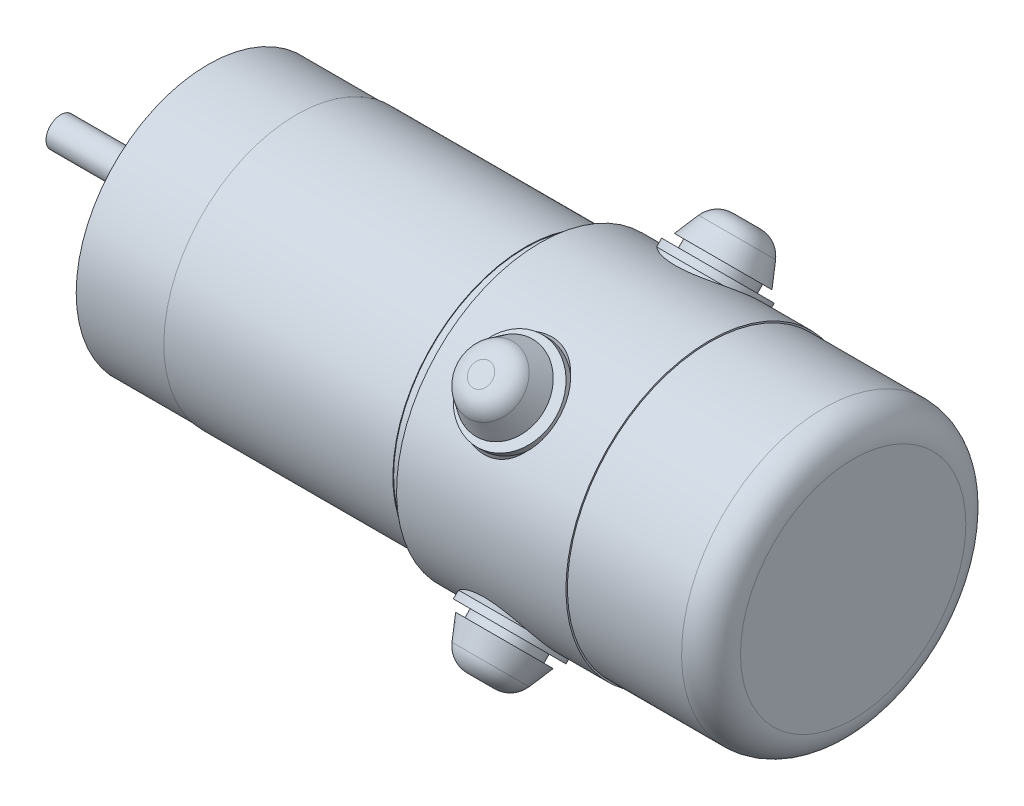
ISO-10303-21;
HEADER;
FILE_DESCRIPTION(('STEP AP214'),'2;1');
FILE_NAME('part.step','',(''),(''),'','','');
FILE_SCHEMA(('AUTOMOTIVE_DESIGN { 1 0 10303 214 1 1 1 1 }'));
ENDSEC;
DATA;
#1=APPLICATION_CONTEXT('core data for automotive mechanical design processes');
#2=APPLICATION_PROTOCOL_DEFINITION('international standard','automotive_design',2000,#1);
#3=PRODUCT_CONTEXT('',#1,'mechanical');
#4=PRODUCT('Part','Part','',(#3));
#5=PRODUCT_RELATED_PRODUCT_CATEGORY('part','',(#4));
#6=PRODUCT_DEFINITION_FORMATION('','',#4);
#7=PRODUCT_DEFINITION_CONTEXT('part definition',#1,'design');
#8=PRODUCT_DEFINITION('design','',#6,#7);
#9=PRODUCT_DEFINITION_SHAPE('','',#8);
#10=(LENGTH_UNIT() NAMED_UNIT(*) SI_UNIT(.MILLI.,.METRE.));
#11=(NAMED_UNIT(*) PLANE_ANGLE_UNIT() SI_UNIT($,.RADIAN.));
#12=(NAMED_UNIT(*) SI_UNIT($,.STERADIAN.) SOLID_ANGLE_UNIT());
#13=UNCERTAINTY_MEASURE_WITH_UNIT(LENGTH_MEASURE(1.E-05),#10,'distance_accuracy_value','');
#14=(GEOMETRIC_REPRESENTATION_CONTEXT(3) GLOBAL_UNCERTAINTY_ASSIGNED_CONTEXT((#13)) GLOBAL_UNIT_ASSIGNED_CONTEXT((#10,
#11,#12)) REPRESENTATION_CONTEXT('',''));
#15=CARTESIAN_POINT('',(0.,0.,0.));
#16=DIRECTION('',(0.,0.,1.));
#17=DIRECTION('',(1.,0.,0.));
#18=AXIS2_PLACEMENT_3D('',#15,#16,#17);
#19=CARTESIAN_POINT('',(-90.6,0.,0.));
#20=DIRECTION('',(-1.00000000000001,0.,0.));
#21=DIRECTION('',(0.,-1.00000000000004,0.));
#22=AXIS2_PLACEMENT_3D('',#19,#20,#21);
#23=PLANE('',#22);
#24=CARTESIAN_POINT('',(-90.6,0.,0.));
#25=DIRECTION('',(1.00000000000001,0.,0.));
#26=DIRECTION('',(0.,1.00000000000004,0.));
#27=AXIS2_PLACEMENT_3D('',#24,#25,#26);
#28=CIRCLE('',#27,0.999999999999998);
#29=CARTESIAN_POINT('',(-90.6,1.00000000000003,0.));
#30=VERTEX_POINT('',#29);
#31=EDGE_CURVE('E488',#30,#30,#28,.T.);
#32=ORIENTED_EDGE('',*,*,#31,.T.);
#33=EDGE_LOOP('',(#32));
#34=FACE_BOUND('',#33,.T.);
#35=ADVANCED_FACE('F35',(#34),#23,.F.);
#36=CARTESIAN_POINT('',(-8.00000000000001,13.0000000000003,0.));
#37=DIRECTION('',(-1.00000000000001,0.,0.));
#38=DIRECTION('',(0.,-1.00000000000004,0.));
#39=AXIS2_PLACEMENT_3D('',#36,#37,#38);
#40=PLANE('',#39);
#41=CARTESIAN_POINT('',(-8.00000000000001,0.,0.));
#42=DIRECTION('',(1.00000000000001,0.,0.));
#43=DIRECTION('',(0.,1.00000000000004,0.));
#44=AXIS2_PLACEMENT_3D('',#41,#42,#43);
#45=CIRCLE('',#44,13.);
#46=CARTESIAN_POINT('',(-8.00000000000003,13.0000000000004,0.));
#47=VERTEX_POINT('',#46);
#48=EDGE_CURVE('E498',#47,#47,#45,.T.);
#49=ORIENTED_EDGE('',*,*,#48,.F.);
#50=EDGE_LOOP('',(#49));
#51=FACE_BOUND('',#50,.T.);
#52=ADVANCED_FACE('F169',(#51),#40,.T.);
#53=CARTESIAN_POINT('',(0.,0.,0.));
#54=DIRECTION('',(1.00000000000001,0.,0.));
#55=DIRECTION('',(0.,1.00000000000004,0.));
#56=AXIS2_PLACEMENT_3D('',#53,#54,#55);
#57=CYLINDRICAL_SURFACE('',#56,13.);
#58=DIRECTION('',(-1.,0.,0.));
#59=VECTOR('',#58,1.);
#60=CARTESIAN_POINT('',(-81.35,-10.0421073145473,8.25566960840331));
#61=LINE('',#60,#59);
#62=CARTESIAN_POINT('',(-79.1,-10.0421073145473,8.2556696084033));
#63=VERTEX_POINT('',#62);
#64=CARTESIAN_POINT('',(-83.6,-10.0421073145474,8.25566960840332));
#65=VERTEX_POINT('',#64);
#66=EDGE_CURVE('E11',#63,#65,#61,.T.);
#67=ORIENTED_EDGE('',*,*,#66,.F.);
#68=CARTESIAN_POINT('',(-79.1002,-8.25535775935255,10.0423636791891));
#69=CARTESIAN_POINT('',(-79.0834071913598,-8.28154452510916,10.0208365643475));
#70=CARTESIAN_POINT('',(-79.0668075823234,-8.30772100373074,9.9991466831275));
#71=CARTESIAN_POINT('',(-79.0340806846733,-8.36008069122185,9.95541135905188));
#72=CARTESIAN_POINT('',(-79.0179534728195,-8.3862639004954,9.93336585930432));
#73=CARTESIAN_POINT('',(-78.9702860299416,-8.4650691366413,9.86647700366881));
#74=CARTESIAN_POINT('',(-78.9396007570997,-8.51772996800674,9.82105937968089));
#75=CARTESIAN_POINT('',(-78.8808514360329,-8.62473579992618,9.72723647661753));
#76=CARTESIAN_POINT('',(-78.8528761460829,-8.67908902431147,9.67878424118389));
#77=CARTESIAN_POINT('',(-78.80239673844,-8.78830263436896,9.57972631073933));
#78=CARTESIAN_POINT('',(-78.7798838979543,-8.84316206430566,9.52912420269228));
#79=CARTESIAN_POINT('',(-78.7495077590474,-8.93399988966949,9.44383618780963));
#80=CARTESIAN_POINT('',(-78.7392780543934,-8.9698140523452,9.40983061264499));
#81=CARTESIAN_POINT('',(-78.723042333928,-9.04154917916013,9.34092389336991));
#82=CARTESIAN_POINT('',(-78.7170351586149,-9.07747011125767,9.30602299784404));
#83=CARTESIAN_POINT('',(-78.7098857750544,-9.14872893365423,9.23597443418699));
#84=CARTESIAN_POINT('',(-78.7086864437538,-9.18406867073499,9.2008346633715));
#85=CARTESIAN_POINT('',(-78.7111248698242,-9.25425703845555,9.13023581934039));
#86=CARTESIAN_POINT('',(-78.7147631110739,-9.28910561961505,9.09477671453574));
#87=CARTESIAN_POINT('',(-78.7283419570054,-9.36881689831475,9.01274012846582));
#88=CARTESIAN_POINT('',(-78.7398997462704,-9.41339705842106,8.96615918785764));
#89=CARTESIAN_POINT('',(-78.7690663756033,-9.50093291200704,8.87335094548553));
#90=CARTESIAN_POINT('',(-78.7866822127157,-9.54388666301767,8.82712411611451));
#91=CARTESIAN_POINT('',(-78.826490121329,-9.62868741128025,8.73455017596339));
#92=CARTESIAN_POINT('',(-78.848734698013,-9.67051487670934,8.68820830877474));
#93=CARTESIAN_POINT('',(-78.8963166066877,-9.75268902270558,8.59586384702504));
#94=CARTESIAN_POINT('',(-78.9216527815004,-9.79303625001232,8.54986113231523));
#95=CARTESIAN_POINT('',(-78.9721098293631,-9.8688859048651,8.46215952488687));
#96=CARTESIAN_POINT('',(-78.9970444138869,-9.90449730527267,8.42044631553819));
#97=CARTESIAN_POINT('',(-79.0479174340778,-9.97431782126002,8.33761771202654));
#98=CARTESIAN_POINT('',(-79.0738379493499,-10.008539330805,8.29650179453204));
#99=CARTESIAN_POINT('',(-79.1002,-10.042363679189,8.25535775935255));
#100=B_SPLINE_CURVE_WITH_KNOTS('',3,(#68,#69,#70,#71,#72,#73,#74,#75,#76,#77,#78,#79,#80,#81,
#82,#83,#84,#85,#86,#87,#88,#89,#90,#91,#92,#93,#94,#95,#96,#97,#98,#99),.UNSPECIFIED.,.F.,.F.,
(4,2,2,2,2,2,2,2,2,2,2,2,2,2,2,4),(0.,0.113490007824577,0.226998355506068,0.454956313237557,
0.688833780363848,0.922335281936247,1.07349012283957,1.22460344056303,1.37391592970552,
1.52324335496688,1.71934662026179,1.91567714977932,2.11436965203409,2.31298801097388,
2.49371049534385,2.67201221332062),.UNSPECIFIED.);
#101=CARTESIAN_POINT('',(-79.1,-8.2556696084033,10.0421073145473));
#102=VERTEX_POINT('',#101);
#103=EDGE_CURVE('E1164',#102,#63,#100,.T.);
#104=ORIENTED_EDGE('',*,*,#103,.F.);
#105=DIRECTION('',(-1.,0.,0.));
#106=VECTOR('',#105,1.);
#107=CARTESIAN_POINT('',(-81.35,-8.25566960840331,10.0421073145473));
#108=LINE('',#107,#106);
#109=CARTESIAN_POINT('',(-83.6,-8.25566960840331,10.0421073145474));
#110=VERTEX_POINT('',#109);
#111=EDGE_CURVE('E43',#110,#102,#108,.F.);
#112=ORIENTED_EDGE('',*,*,#111,.F.);
#113=CARTESIAN_POINT('',(-83.6,0.,0.));
#114=DIRECTION('',(1.00000000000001,0.,0.));
#115=DIRECTION('',(0.,1.00000000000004,0.));
#116=AXIS2_PLACEMENT_3D('',#113,#114,#115);
#117=CIRCLE('',#116,13.);
#118=CARTESIAN_POINT('',(-83.6,8.25566960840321,10.0421073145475));
#119=VERTEX_POINT('',#118);
#120=EDGE_CURVE('E493',#119,#110,#117,.T.);
#121=ORIENTED_EDGE('',*,*,#120,.F.);
#122=DIRECTION('',(-1.,0.,0.));
#123=VECTOR('',#122,1.);
#124=CARTESIAN_POINT('',(-81.35,8.25566960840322,10.0421073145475));
#125=LINE('',#124,#123);
#126=CARTESIAN_POINT('',(-79.1,8.25566960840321,10.0421073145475));
#127=VERTEX_POINT('',#126);
#128=EDGE_CURVE('E1173',#127,#119,#125,.T.);
#129=ORIENTED_EDGE('',*,*,#128,.F.);
#130=CARTESIAN_POINT('',(-79.1002,10.0423636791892,8.25535775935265));
#131=CARTESIAN_POINT('',(-79.0834071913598,10.0208365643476,8.28154452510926));
#132=CARTESIAN_POINT('',(-79.0668075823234,9.9991466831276,8.30772100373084));
#133=CARTESIAN_POINT('',(-79.0340806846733,9.95541135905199,8.36008069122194));
#134=CARTESIAN_POINT('',(-79.0179534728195,9.93336585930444,8.38626390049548));
#135=CARTESIAN_POINT('',(-78.9702860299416,9.86647700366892,8.46506913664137));
#136=CARTESIAN_POINT('',(-78.9396007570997,9.82105937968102,8.51772996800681));
#137=CARTESIAN_POINT('',(-78.8808514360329,9.72723647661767,8.62473579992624));
#138=CARTESIAN_POINT('',(-78.8528761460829,9.67878424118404,8.67908902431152));
#139=CARTESIAN_POINT('',(-78.8023967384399,9.57972631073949,8.78830263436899));
#140=CARTESIAN_POINT('',(-78.7798838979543,9.52912420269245,8.84316206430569));
#141=CARTESIAN_POINT('',(-78.7495077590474,9.44383618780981,8.93399988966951));
#142=CARTESIAN_POINT('',(-78.7392780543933,9.40983061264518,8.9698140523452));
#143=CARTESIAN_POINT('',(-78.7230423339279,9.34092389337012,9.04154917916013));
#144=CARTESIAN_POINT('',(-78.7170351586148,9.30602299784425,9.07747011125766));
#145=CARTESIAN_POINT('',(-78.7098857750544,9.23597443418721,9.14872893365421));
#146=CARTESIAN_POINT('',(-78.7086864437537,9.20083466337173,9.18406867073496));
#147=CARTESIAN_POINT('',(-78.7111248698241,9.13023581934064,9.25425703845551));
#148=CARTESIAN_POINT('',(-78.7147631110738,9.09477671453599,9.28910561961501));
#149=CARTESIAN_POINT('',(-78.7283419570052,9.0127401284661,9.36881689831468));
#150=CARTESIAN_POINT('',(-78.7398997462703,8.96615918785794,9.41339705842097));
#151=CARTESIAN_POINT('',(-78.7690663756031,8.87335094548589,9.5009329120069));
#152=CARTESIAN_POINT('',(-78.7866822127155,8.82712411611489,9.54388666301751));
#153=CARTESIAN_POINT('',(-78.8264901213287,8.73455017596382,9.62868741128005));
#154=CARTESIAN_POINT('',(-78.8487346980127,8.6882083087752,9.67051487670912));
#155=CARTESIAN_POINT('',(-78.8963166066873,8.59586384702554,9.75268902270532));
#156=CARTESIAN_POINT('',(-78.9216527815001,8.54986113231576,9.79303625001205));
#157=CARTESIAN_POINT('',(-78.9721098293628,8.46215952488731,9.8688859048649));
#158=CARTESIAN_POINT('',(-78.9970444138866,8.42044631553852,9.90449730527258));
#159=CARTESIAN_POINT('',(-79.0479174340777,8.33761771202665,9.97431782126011));
#160=CARTESIAN_POINT('',(-79.0738379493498,8.29650179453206,10.0085393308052));
#161=CARTESIAN_POINT('',(-79.1002,8.25535775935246,10.0423636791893));
#162=B_SPLINE_CURVE_WITH_KNOTS('',3,(#130,#131,#132,#133,#134,#135,#136,#137,#138,#139,#140,
#141,#142,#143,#144,#145,#146,#147,#148,#149,#150,#151,#152,#153,#154,#155,#156,#157,#158,#159,
#160,#161),.UNSPECIFIED.,.F.,.F.,(4,2,2,2,2,2,2,2,2,2,2,2,2,2,2,4),(0.,0.113490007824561,
0.226998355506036,0.454956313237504,0.688833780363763,0.922335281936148,1.07349012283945,
1.22460344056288,1.37391592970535,1.52324335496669,1.71934662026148,1.9156771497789,
2.11436965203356,2.31298801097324,2.49371049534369,2.67201221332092),.UNSPECIFIED.);
#163=CARTESIAN_POINT('',(-79.1,10.0421073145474,8.25566960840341));
#164=VERTEX_POINT('',#163);
#165=EDGE_CURVE('E202',#164,#127,#162,.T.);
#166=ORIENTED_EDGE('',*,*,#165,.F.);
#167=DIRECTION('',(-1.,0.,0.));
#168=VECTOR('',#167,1.);
#169=CARTESIAN_POINT('',(-81.35,10.0421073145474,8.25566960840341));
#170=LINE('',#169,#168);
#171=CARTESIAN_POINT('',(-83.6,10.0421073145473,8.25566960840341));
#172=VERTEX_POINT('',#171);
#173=EDGE_CURVE('E1175',#172,#164,#170,.F.);
#174=ORIENTED_EDGE('',*,*,#173,.F.);
#175=CARTESIAN_POINT('',(-83.6,10.0421073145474,-8.25566960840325));
#176=VERTEX_POINT('',#175);
#177=EDGE_CURVE('E497',#176,#172,#117,.T.);
#178=ORIENTED_EDGE('',*,*,#177,.F.);
#179=DIRECTION('',(-1.,0.,0.));
#180=VECTOR('',#179,1.);
#181=CARTESIAN_POINT('',(-81.35,10.0421073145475,-8.25566960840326));
#182=LINE('',#181,#180);
#183=CARTESIAN_POINT('',(-79.1,10.0421073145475,-8.25566960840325));
#184=VERTEX_POINT('',#183);
#185=EDGE_CURVE('E228',#184,#176,#182,.T.);
#186=ORIENTED_EDGE('',*,*,#185,.F.);
#187=CARTESIAN_POINT('',(-79.1002,8.25535775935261,-10.0423636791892));
#188=CARTESIAN_POINT('',(-79.0834071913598,8.28154452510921,-10.0208365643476));
#189=CARTESIAN_POINT('',(-79.0668075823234,8.3077210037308,-9.9991466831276));
#190=CARTESIAN_POINT('',(-79.0340806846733,8.3600806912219,-9.95541135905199));
#191=CARTESIAN_POINT('',(-79.0179534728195,8.38626390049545,-9.93336585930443));
#192=CARTESIAN_POINT('',(-78.9702860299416,8.46506913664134,-9.86647700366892));
#193=CARTESIAN_POINT('',(-78.9396007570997,8.51772996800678,-9.82105937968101));
#194=CARTESIAN_POINT('',(-78.8808514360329,8.62473579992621,-9.72723647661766));
#195=CARTESIAN_POINT('',(-78.8528761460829,8.67908902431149,-9.67878424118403));
#196=CARTESIAN_POINT('',(-78.8023967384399,8.78830263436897,-9.57972631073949));
#197=CARTESIAN_POINT('',(-78.7798838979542,8.84316206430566,-9.52912420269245));
#198=CARTESIAN_POINT('',(-78.7495077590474,8.93399988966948,-9.44383618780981));
#199=CARTESIAN_POINT('',(-78.7392780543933,8.96981405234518,-9.40983061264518));
#200=CARTESIAN_POINT('',(-78.7230423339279,9.0415491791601,-9.34092389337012));
#201=CARTESIAN_POINT('',(-78.7170351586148,9.07747011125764,-9.30602299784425));
#202=CARTESIAN_POINT('',(-78.7098857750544,9.14872893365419,-9.23597443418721));
#203=CARTESIAN_POINT('',(-78.7086864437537,9.18406867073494,-9.20083466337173));
#204=CARTESIAN_POINT('',(-78.7111248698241,9.25425703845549,-9.13023581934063));
#205=CARTESIAN_POINT('',(-78.7147631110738,9.28910561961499,-9.09477671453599));
#206=CARTESIAN_POINT('',(-78.7283419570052,9.36881689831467,-9.0127401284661));
#207=CARTESIAN_POINT('',(-78.7398997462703,9.41339705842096,-8.96615918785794));
#208=CARTESIAN_POINT('',(-78.7690663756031,9.50093291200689,-8.87335094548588));
#209=CARTESIAN_POINT('',(-78.7866822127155,9.54388666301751,-8.82712411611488));
#210=CARTESIAN_POINT('',(-78.8264901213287,9.62868741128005,-8.73455017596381));
#211=CARTESIAN_POINT('',(-78.8487346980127,9.67051487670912,-8.68820830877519));
#212=CARTESIAN_POINT('',(-78.8963166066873,9.75268902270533,-8.59586384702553));
#213=CARTESIAN_POINT('',(-78.9216527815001,9.79303625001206,-8.54986113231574));
#214=CARTESIAN_POINT('',(-78.9721098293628,9.8688859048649,-8.46215952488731));
#215=CARTESIAN_POINT('',(-78.9970444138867,9.90449730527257,-8.42044631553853));
#216=CARTESIAN_POINT('',(-79.0479174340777,9.97431782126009,-8.33761771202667));
#217=CARTESIAN_POINT('',(-79.0738379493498,10.0085393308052,-8.29650179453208));
#218=CARTESIAN_POINT('',(-79.1002,10.0423636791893,-8.2553577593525));
#219=B_SPLINE_CURVE_WITH_KNOTS('',3,(#187,#188,#189,#190,#191,#192,#193,#194,#195,#196,#197,
#198,#199,#200,#201,#202,#203,#204,#205,#206,#207,#208,#209,#210,#211,#212,#213,#214,#215,#216,
#217,#218),.UNSPECIFIED.,.F.,.F.,(4,2,2,2,2,2,2,2,2,2,2,2,2,2,2,4),(0.,0.113490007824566,
0.226998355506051,0.454956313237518,0.688833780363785,0.922335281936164,1.07349012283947,
1.2246034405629,1.37391592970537,1.52324335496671,1.71934662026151,1.91567714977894,
2.1143696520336,2.3129880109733,2.49371049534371,2.6720122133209),.UNSPECIFIED.);
#220=CARTESIAN_POINT('',(-79.1,8.25566960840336,-10.0421073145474));
#221=VERTEX_POINT('',#220);
#222=EDGE_CURVE('E212',#221,#184,#219,.T.);
#223=ORIENTED_EDGE('',*,*,#222,.F.);
#224=DIRECTION('',(-1.,0.,0.));
#225=VECTOR('',#224,1.);
#226=CARTESIAN_POINT('',(-81.35,8.25566960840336,-10.0421073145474));
#227=LINE('',#226,#225);
#228=CARTESIAN_POINT('',(-83.6,8.25566960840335,-10.0421073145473));
#229=VERTEX_POINT('',#228);
#230=EDGE_CURVE('E1174',#229,#221,#227,.F.);
#231=ORIENTED_EDGE('',*,*,#230,.F.);
#232=CARTESIAN_POINT('',(-83.6,-8.2556696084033,-10.0421073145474));
#233=VERTEX_POINT('',#232);
#234=EDGE_CURVE('E1182',#233,#229,#117,.T.);
#235=ORIENTED_EDGE('',*,*,#234,.F.);
#236=DIRECTION('',(-1.,0.,0.));
#237=VECTOR('',#236,1.);
#238=CARTESIAN_POINT('',(-81.35,-8.2556696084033,-10.0421073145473));
#239=LINE('',#238,#237);
#240=CARTESIAN_POINT('',(-79.1,-8.2556696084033,-10.0421073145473));
#241=VERTEX_POINT('',#240);
#242=EDGE_CURVE('E1188',#241,#233,#239,.T.);
#243=ORIENTED_EDGE('',*,*,#242,.F.);
#244=CARTESIAN_POINT('',(-79.1002,-10.042363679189,-8.25535775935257));
#245=CARTESIAN_POINT('',(-79.0834071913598,-10.0208365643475,-8.28154452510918));
#246=CARTESIAN_POINT('',(-79.0668075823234,-9.99914668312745,-8.30772100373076));
#247=CARTESIAN_POINT('',(-79.0340806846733,-9.95541135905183,-8.36008069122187));
#248=CARTESIAN_POINT('',(-79.0179534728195,-9.93336585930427,-8.38626390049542));
#249=CARTESIAN_POINT('',(-78.9702860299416,-9.86647700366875,-8.46506913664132));
#250=CARTESIAN_POINT('',(-78.9396007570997,-9.82105937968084,-8.51772996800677));
#251=CARTESIAN_POINT('',(-78.8808514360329,-9.72723647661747,-8.62473579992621));
#252=CARTESIAN_POINT('',(-78.8528761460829,-9.67878424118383,-8.6790890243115));
#253=CARTESIAN_POINT('',(-78.80239673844,-9.57972631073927,-8.78830263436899));
#254=CARTESIAN_POINT('',(-78.7798838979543,-9.52912420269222,-8.8431620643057));
#255=CARTESIAN_POINT('',(-78.7495077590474,-9.44383618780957,-8.93399988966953));
#256=CARTESIAN_POINT('',(-78.7392780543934,-9.40983061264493,-8.96981405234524));
#257=CARTESIAN_POINT('',(-78.723042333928,-9.34092389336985,-9.04154917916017));
#258=CARTESIAN_POINT('',(-78.7170351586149,-9.30602299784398,-9.07747011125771));
#259=CARTESIAN_POINT('',(-78.7098857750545,-9.23597443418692,-9.14872893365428));
#260=CARTESIAN_POINT('',(-78.7086864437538,-9.20083466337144,-9.18406867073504));
#261=CARTESIAN_POINT('',(-78.7111248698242,-9.13023581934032,-9.2542570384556));
#262=CARTESIAN_POINT('',(-78.714763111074,-9.09477671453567,-9.2891056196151));
#263=CARTESIAN_POINT('',(-78.7283419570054,-9.01274012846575,-9.36881689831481));
#264=CARTESIAN_POINT('',(-78.7398997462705,-8.96615918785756,-9.41339705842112));
#265=CARTESIAN_POINT('',(-78.7690663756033,-8.87335094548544,-9.5009329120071));
#266=CARTESIAN_POINT('',(-78.7866822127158,-8.82712411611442,-9.54388666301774));
#267=CARTESIAN_POINT('',(-78.826490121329,-8.73455017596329,-9.62868741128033));
#268=CARTESIAN_POINT('',(-78.848734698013,-8.68820830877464,-9.67051487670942));
#269=CARTESIAN_POINT('',(-78.8963166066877,-8.59586384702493,-9.75268902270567));
#270=CARTESIAN_POINT('',(-78.9216527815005,-8.54986113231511,-9.79303625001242));
#271=CARTESIAN_POINT('',(-78.9721098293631,-8.46215952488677,-9.86888590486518));
#272=CARTESIAN_POINT('',(-78.9970444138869,-8.42044631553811,-9.90449730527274));
#273=CARTESIAN_POINT('',(-79.0479174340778,-8.33761771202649,-9.97431782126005));
#274=CARTESIAN_POINT('',(-79.0738379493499,-8.29650179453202,-10.0085393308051));
#275=CARTESIAN_POINT('',(-79.1002,-8.25535775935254,-10.0423636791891));
#276=B_SPLINE_CURVE_WITH_KNOTS('',3,(#244,#245,#246,#247,#248,#249,#250,#251,#252,#253,#254,
#255,#256,#257,#258,#259,#260,#261,#262,#263,#264,#265,#266,#267,#268,#269,#270,#271,#272,#273,
#274,#275),.UNSPECIFIED.,.F.,.F.,(4,2,2,2,2,2,2,2,2,2,2,2,2,2,2,4),(0.,0.113490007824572,
0.226998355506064,0.45495631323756,0.688833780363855,0.92233528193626,1.07349012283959,
1.22460344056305,1.37391592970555,1.52324335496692,1.71934662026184,1.91567714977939,
2.11436965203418,2.31298801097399,2.49371049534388,2.67201221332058),.UNSPECIFIED.);
#277=CARTESIAN_POINT('',(-79.1,-10.0421073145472,-8.25566960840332));
#278=VERTEX_POINT('',#277);
#279=EDGE_CURVE('E220',#278,#241,#276,.T.);
#280=ORIENTED_EDGE('',*,*,#279,.F.);
#281=DIRECTION('',(-1.,0.,0.));
#282=VECTOR('',#281,1.);
#283=CARTESIAN_POINT('',(-81.35,-10.0421073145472,-8.25566960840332));
#284=LINE('',#283,#282);
#285=CARTESIAN_POINT('',(-83.6,-10.0421073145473,-8.25566960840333));
#286=VERTEX_POINT('',#285);
#287=EDGE_CURVE('E227',#286,#278,#284,.F.);
#288=ORIENTED_EDGE('',*,*,#287,.F.);
#289=EDGE_CURVE('E496',#65,#286,#117,.T.);
#290=ORIENTED_EDGE('',*,*,#289,.F.);
#291=EDGE_LOOP('',(#67,#104,#112,#121,#129,#166,#174,#178,#186,#223,#231,#235,#243,#280,#288,#290));
#292=FACE_BOUND('',#291,.T.);
#293=ORIENTED_EDGE('',*,*,#48,.T.);
#294=EDGE_LOOP('',(#293));
#295=FACE_BOUND('',#294,.T.);
#296=ADVANCED_FACE('F175',(#292,#295),#57,.F.);
#297=CARTESIAN_POINT('',(-83.6,1.,0.));
#298=DIRECTION('',(1.00000000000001,0.,0.));
#299=DIRECTION('',(0.,1.00000000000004,0.));
#300=AXIS2_PLACEMENT_3D('',#297,#298,#299);
#301=PLANE('',#300);
#302=CARTESIAN_POINT('',(-83.6,-9.89949493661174,9.89949493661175));
#303=DIRECTION('',(1.00000000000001,0.,0.));
#304=DIRECTION('',(0.,1.,0.));
#305=AXIS2_PLACEMENT_3D('',#302,#303,#304);
#306=CIRCLE('',#305,1.64999999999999);
#307=EDGE_CURVE('E1125',#65,#110,#306,.T.);
#308=ORIENTED_EDGE('',*,*,#307,.F.);
#309=ORIENTED_EDGE('',*,*,#289,.T.);
#310=CARTESIAN_POINT('',(-83.6,-9.89949493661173,-9.89949493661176));
#311=DIRECTION('',(1.00000000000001,0.,0.));
#312=DIRECTION('',(0.,1.,0.));
#313=AXIS2_PLACEMENT_3D('',#310,#311,#312);
#314=CIRCLE('',#313,1.64999999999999);
#315=EDGE_CURVE('E1118',#233,#286,#314,.T.);
#316=ORIENTED_EDGE('',*,*,#315,.F.);
#317=ORIENTED_EDGE('',*,*,#234,.T.);
#318=CARTESIAN_POINT('',(-83.6,9.89949493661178,-9.89949493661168));
#319=DIRECTION('',(1.00000000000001,0.,0.));
#320=DIRECTION('',(0.,1.,0.));
#321=AXIS2_PLACEMENT_3D('',#318,#319,#320);
#322=CIRCLE('',#321,1.64999999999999);
#323=EDGE_CURVE('E1110',#176,#229,#322,.T.);
#324=ORIENTED_EDGE('',*,*,#323,.F.);
#325=ORIENTED_EDGE('',*,*,#177,.T.);
#326=CARTESIAN_POINT('',(-83.6,9.89949493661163,9.89949493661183));
#327=DIRECTION('',(1.00000000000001,0.,0.));
#328=DIRECTION('',(0.,1.,0.));
#329=AXIS2_PLACEMENT_3D('',#326,#327,#328);
#330=CIRCLE('',#329,1.64999999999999);
#331=EDGE_CURVE('E1168',#119,#172,#330,.T.);
#332=ORIENTED_EDGE('',*,*,#331,.F.);
#333=ORIENTED_EDGE('',*,*,#120,.T.);
#334=EDGE_LOOP('',(#308,#309,#316,#317,#324,#325,#332,#333));
#335=FACE_BOUND('',#334,.T.);
#336=CARTESIAN_POINT('',(-83.6,0.,0.));
#337=DIRECTION('',(1.00000000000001,0.,0.));
#338=DIRECTION('',(0.,1.00000000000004,0.));
#339=AXIS2_PLACEMENT_3D('',#336,#337,#338);
#340=CIRCLE('',#339,0.999999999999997);
#341=CARTESIAN_POINT('',(-83.6,1.00000000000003,0.));
#342=VERTEX_POINT('',#341);
#343=EDGE_CURVE('E490',#342,#342,#340,.T.);
#344=ORIENTED_EDGE('',*,*,#343,.F.);
#345=EDGE_LOOP('',(#344));
#346=FACE_BOUND('',#345,.T.);
#347=ADVANCED_FACE('F196',(#335,#346),#301,.T.);
#348=CARTESIAN_POINT('',(0.,0.,0.));
#349=DIRECTION('',(1.00000000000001,0.,0.));
#350=DIRECTION('',(0.,1.00000000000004,0.));
#351=AXIS2_PLACEMENT_3D('',#348,#349,#350);
#352=CYLINDRICAL_SURFACE('',#351,0.999999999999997);
#353=ORIENTED_EDGE('',*,*,#343,.T.);
#354=EDGE_LOOP('',(#353));
#355=FACE_BOUND('',#354,.T.);
#356=ORIENTED_EDGE('',*,*,#31,.F.);
#357=EDGE_LOOP('',(#356));
#358=FACE_BOUND('',#357,.T.);
#359=ADVANCED_FACE('F254',(#355,#358),#352,.F.);
#360=CARTESIAN_POINT('',(-87.6,9.89949493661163,9.89949493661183));
#361=DIRECTION('',(-1.,0.,0.));
#362=DIRECTION('',(0.,0.,1.));
#363=AXIS2_PLACEMENT_3D('',#360,#361,#362);
#364=CYLINDRICAL_SURFACE('',#363,1.64999999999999);
#365=ORIENTED_EDGE('',*,*,#128,.T.);
#366=ORIENTED_EDGE('',*,*,#331,.T.);
#367=ORIENTED_EDGE('',*,*,#173,.T.);
#368=CARTESIAN_POINT('',(-79.1,9.89949493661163,9.89949493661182));
#369=DIRECTION('',(-1.,0.,0.));
#370=DIRECTION('',(0.,0.,1.));
#371=AXIS2_PLACEMENT_3D('',#368,#369,#370);
#372=CIRCLE('',#371,1.65);
#373=EDGE_CURVE('E1106',#127,#164,#372,.T.);
#374=ORIENTED_EDGE('',*,*,#373,.F.);
#375=EDGE_LOOP('',(#365,#366,#367,#374));
#376=FACE_BOUND('',#375,.T.);
#377=CARTESIAN_POINT('',(-87.6,9.89949493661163,9.89949493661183));
#378=DIRECTION('',(-1.,0.,0.));
#379=DIRECTION('',(0.,0.,1.));
#380=AXIS2_PLACEMENT_3D('',#377,#378,#379);
#381=CIRCLE('',#380,1.64999999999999);
#382=CARTESIAN_POINT('',(-87.6,9.89949493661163,11.5494949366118));
#383=VERTEX_POINT('',#382);
#384=EDGE_CURVE('E1103',#383,#383,#381,.T.);
#385=ORIENTED_EDGE('',*,*,#384,.T.);
#386=EDGE_LOOP('',(#385));
#387=FACE_BOUND('',#386,.T.);
#388=ADVANCED_FACE('F250',(#376,#387),#364,.F.);
#389=CARTESIAN_POINT('',(-79.1,9.89949493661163,9.89949493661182));
#390=DIRECTION('',(-1.,0.,0.));
#391=DIRECTION('',(0.,0.,1.));
#392=AXIS2_PLACEMENT_3D('',#389,#390,#391);
#393=CONICAL_SURFACE('',#392,1.65,1.02974425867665);
#394=ORIENTED_EDGE('',*,*,#165,.T.);
#395=ORIENTED_EDGE('',*,*,#373,.T.);
#396=EDGE_LOOP('',(#394,#395));
#397=FACE_BOUND('',#396,.T.);
#398=CARTESIAN_POINT('',(-78.1085799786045,9.89949493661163,9.89949493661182));
#399=VERTEX_POINT('',#398);
#400=VERTEX_LOOP('',#399);
#401=FACE_BOUND('',#400,.T.);
#402=ADVANCED_FACE('F245',(#397,#401),#393,.F.);
#403=CARTESIAN_POINT('',(-32.5,-18.0312229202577,18.0312229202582));
#404=DIRECTION('',(0.,0.707106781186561,-0.707106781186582));
#405=DIRECTION('',(0.,-0.707106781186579,-0.707106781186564));
#406=AXIS2_PLACEMENT_3D('',#403,#404,#405);
#407=CONICAL_SURFACE('',#406,3.5,0.401425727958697);
#408=CARTESIAN_POINT('',(-32.5,-13.4501651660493,13.4501651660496));
#409=DIRECTION('',(0.,0.707106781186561,-0.707106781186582));
#410=DIRECTION('',(0.,0.707106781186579,0.707106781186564));
#411=AXIS2_PLACEMENT_3D('',#408,#409,#410);
#412=CIRCLE('',#411,6.25000000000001);
#413=CARTESIAN_POINT('',(-27.9583718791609,-16.4862904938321,10.4140398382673));
#414=VERTEX_POINT('',#413);
#415=CARTESIAN_POINT('',(-37.0416281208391,-16.4862904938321,10.414039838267));
#416=VERTEX_POINT('',#415);
#417=EDGE_CURVE('E308',#414,#416,#412,.T.);
#418=ORIENTED_EDGE('',*,*,#417,.T.);
#419=CARTESIAN_POINT('',(-36.4077421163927,-16.8459237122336,9.82165231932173));
#420=CARTESIAN_POINT('',(-36.2669681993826,-16.9131782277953,9.70629851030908));
#421=CARTESIAN_POINT('',(-36.1202281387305,-16.9760893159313,9.59566789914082));
#422=CARTESIAN_POINT('',(-35.8157165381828,-17.0931100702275,9.38562955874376));
#423=CARTESIAN_POINT('',(-35.6579499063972,-17.1472236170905,9.28621688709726));
#424=CARTESIAN_POINT('',(-35.3323642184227,-17.2465845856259,9.10035314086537));
#425=CARTESIAN_POINT('',(-35.1645485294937,-17.2918349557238,9.0138977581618));
#426=CARTESIAN_POINT('',(-34.8200495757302,-17.3733900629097,8.8556902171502));
#427=CARTESIAN_POINT('',(-34.6433680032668,-17.4096964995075,8.78393526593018));
#428=CARTESIAN_POINT('',(-34.303924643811,-17.4695145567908,8.66429405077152));
#429=CARTESIAN_POINT('',(-34.1419786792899,-17.4940301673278,8.61459083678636));
#430=CARTESIAN_POINT('',(-33.8136013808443,-17.5359536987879,8.52892777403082));
#431=CARTESIAN_POINT('',(-33.6471707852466,-17.5533627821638,8.49296567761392));
#432=CARTESIAN_POINT('',(-33.311384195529,-17.5810024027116,8.435601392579));
#433=CARTESIAN_POINT('',(-33.1420310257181,-17.591239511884,8.41418587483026));
#434=CARTESIAN_POINT('',(-32.8018197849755,-17.6045189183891,8.38636734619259));
#435=CARTESIAN_POINT('',(-32.6309618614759,-17.6075619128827,8.37996288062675));
#436=CARTESIAN_POINT('',(-32.3095451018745,-17.6065088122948,8.38217379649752));
#437=CARTESIAN_POINT('',(-32.1589689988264,-17.6032124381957,8.38910668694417));
#438=CARTESIAN_POINT('',(-31.8589894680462,-17.5910247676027,8.41463300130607));
#439=CARTESIAN_POINT('',(-31.7095864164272,-17.5821317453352,8.43323002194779));
#440=CARTESIAN_POINT('',(-31.4131211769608,-17.5587784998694,8.48174639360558));
#441=CARTESIAN_POINT('',(-31.2660582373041,-17.5443201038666,8.51166202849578));
#442=CARTESIAN_POINT('',(-30.9751884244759,-17.5098793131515,8.58228728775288));
#443=CARTESIAN_POINT('',(-30.8313828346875,-17.4898947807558,8.62300108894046));
#444=CARTESIAN_POINT('',(-30.4083160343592,-17.4220424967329,8.75972786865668));
#445=CARTESIAN_POINT('',(-30.1350170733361,-17.3660885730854,8.87073218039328));
#446=CARTESIAN_POINT('',(-29.6105825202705,-17.2329717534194,9.12662941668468));
#447=CARTESIAN_POINT('',(-29.3594539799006,-17.1558021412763,9.27153307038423));
#448=CARTESIAN_POINT('',(-28.8589270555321,-16.9716292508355,9.60487438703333));
#449=CARTESIAN_POINT('',(-28.6123044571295,-16.8623893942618,9.79624138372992));
#450=CARTESIAN_POINT('',(-28.1544584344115,-16.6188150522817,10.203982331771));
#451=CARTESIAN_POINT('',(-27.9432528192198,-16.4844680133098,10.4203687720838));
#452=CARTESIAN_POINT('',(-27.6454057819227,-16.2569508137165,10.769573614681));
#453=CARTESIAN_POINT('',(-27.5452473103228,-16.1721720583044,10.8965753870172));
#454=CARTESIAN_POINT('',(-27.3572752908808,-15.9953217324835,11.1545548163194));
#455=CARTESIAN_POINT('',(-27.2694582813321,-15.903252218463,11.2855313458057));
#456=CARTESIAN_POINT('',(-27.1065884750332,-15.7120021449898,11.5503109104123));
#457=CARTESIAN_POINT('',(-27.0315419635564,-15.6128181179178,11.6841153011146));
#458=CARTESIAN_POINT('',(-26.8947097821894,-15.407731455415,11.9532598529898));
#459=CARTESIAN_POINT('',(-26.8329192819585,-15.3018312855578,12.0885994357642));
#460=CARTESIAN_POINT('',(-26.7211165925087,-15.0800675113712,12.3642175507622));
#461=CARTESIAN_POINT('',(-26.6715643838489,-14.9639896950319,12.504510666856));
#462=CARTESIAN_POINT('',(-26.5873371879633,-14.7256551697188,12.7843206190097));
#463=CARTESIAN_POINT('',(-26.5526625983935,-14.6033982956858,12.9238374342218));
#464=CARTESIAN_POINT('',(-26.4984535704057,-14.3534379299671,13.2008948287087));
#465=CARTESIAN_POINT('',(-26.4789175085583,-14.2257350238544,13.3384356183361));
#466=CARTESIAN_POINT('',(-26.4551313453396,-13.9657172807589,13.6104422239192));
#467=CARTESIAN_POINT('',(-26.4508809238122,-13.8334025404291,13.74490810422));
#468=CARTESIAN_POINT('',(-26.4576401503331,-13.5674056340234,14.0074921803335));
#469=CARTESIAN_POINT('',(-26.4683915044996,-13.4337849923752,14.1356794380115));
#470=CARTESIAN_POINT('',(-26.5046204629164,-13.1639756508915,14.3872784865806));
#471=CARTESIAN_POINT('',(-26.5301034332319,-13.0277860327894,14.5106885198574));
#472=CARTESIAN_POINT('',(-26.5956003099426,-12.754020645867,14.751889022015));
#473=CARTESIAN_POINT('',(-26.6356092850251,-12.6164453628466,14.8696813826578));
#474=CARTESIAN_POINT('',(-26.7298946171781,-12.3409561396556,15.0991042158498));
#475=CARTESIAN_POINT('',(-26.7841763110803,-12.2030420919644,15.2107323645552));
#476=CARTESIAN_POINT('',(-26.9066601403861,-11.9280712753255,15.4273055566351));
#477=CARTESIAN_POINT('',(-26.9748668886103,-11.7910148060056,15.5322483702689));
#478=CARTESIAN_POINT('',(-27.1247951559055,-11.5189845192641,15.7350497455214));
#479=CARTESIAN_POINT('',(-27.2065213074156,-11.3840114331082,15.832905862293));
#480=CARTESIAN_POINT('',(-27.3830182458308,-11.1174382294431,16.021211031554));
#481=CARTESIAN_POINT('',(-27.4777906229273,-10.9858385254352,16.1116591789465));
#482=CARTESIAN_POINT('',(-27.6798725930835,-10.727324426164,16.284923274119));
#483=CARTESIAN_POINT('',(-27.7871821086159,-10.6004100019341,16.3677392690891));
#484=CARTESIAN_POINT('',(-28.0157633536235,-10.3504645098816,16.5269542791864));
#485=CARTESIAN_POINT('',(-28.1372437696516,-10.2275380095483,16.6032181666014));
#486=CARTESIAN_POINT('',(-28.39197699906,-9.98942502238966,16.7475600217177));
#487=CARTESIAN_POINT('',(-28.525225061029,-9.87423544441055,16.8156412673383));
#488=CARTESIAN_POINT('',(-28.8029332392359,-9.65301372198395,16.943602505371));
#489=CARTESIAN_POINT('',(-28.9473986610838,-9.54698596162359,17.0034785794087));
#490=CARTESIAN_POINT('',(-29.2466358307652,-9.34579069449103,17.1148887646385));
#491=CARTESIAN_POINT('',(-29.4014020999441,-9.25061748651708,17.1664272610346));
#492=CARTESIAN_POINT('',(-29.7138066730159,-9.07636166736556,17.2591715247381));
#493=CARTESIAN_POINT('',(-29.8710648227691,-8.99677813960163,17.3007151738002));
#494=CARTESIAN_POINT('',(-30.1931760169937,-8.85050592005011,17.375998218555));
#495=CARTESIAN_POINT('',(-30.3580249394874,-8.78381032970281,17.4097417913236));
#496=CARTESIAN_POINT('',(-30.6940344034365,-8.66467062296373,17.469342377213));
#497=CARTESIAN_POINT('',(-30.8651897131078,-8.61221498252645,17.4952057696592));
#498=CARTESIAN_POINT('',(-31.2124652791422,-8.52268421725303,17.5389950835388));
#499=CARTESIAN_POINT('',(-31.3885847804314,-8.48560676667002,17.5569222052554));
#500=CARTESIAN_POINT('',(-31.7227911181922,-8.43120972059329,17.5831025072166));
#501=CARTESIAN_POINT('',(-31.8805111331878,-8.41205551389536,17.5922572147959));
#502=CARTESIAN_POINT('',(-32.1972237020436,-8.38675282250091,17.6043340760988));
#503=CARTESIAN_POINT('',(-32.3562161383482,-8.38060314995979,17.6072567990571));
#504=CARTESIAN_POINT('',(-32.6741109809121,-8.38143767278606,17.6068595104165));
#505=CARTESIAN_POINT('',(-32.8330133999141,-8.38841810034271,17.6035412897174));
#506=CARTESIAN_POINT('',(-33.149454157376,-8.41535784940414,17.5906786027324));
#507=CARTESIAN_POINT('',(-33.3069925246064,-8.43531689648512,17.5811342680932));
#508=CARTESIAN_POINT('',(-33.6081399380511,-8.48590947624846,17.5567669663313));
#509=CARTESIAN_POINT('',(-33.7519320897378,-8.51566616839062,17.5423759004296));
#510=CARTESIAN_POINT('',(-34.0363664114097,-8.5854975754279,17.5083045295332));
#511=CARTESIAN_POINT('',(-34.1770075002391,-8.62557577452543,17.4886224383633));
#512=CARTESIAN_POINT('',(-34.5928550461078,-8.76038702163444,17.421704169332));
#513=CARTESIAN_POINT('',(-34.8622175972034,-8.86973697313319,17.3665773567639));
#514=CARTESIAN_POINT('',(-35.394448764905,-9.1287176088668,17.2319151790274));
#515=CARTESIAN_POINT('',(-35.6560317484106,-9.28031880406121,17.15114820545));
#516=CARTESIAN_POINT('',(-36.1508710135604,-9.61308809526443,16.9668701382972));
#517=CARTESIAN_POINT('',(-36.3841144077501,-9.79426955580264,16.8633487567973));
#518=CARTESIAN_POINT('',(-36.8444640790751,-10.2017481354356,16.6203780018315));
#519=CARTESIAN_POINT('',(-37.0676151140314,-10.4308454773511,16.4781336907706));
#520=CARTESIAN_POINT('',(-37.4705472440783,-10.9080292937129,16.1661984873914));
#521=CARTESIAN_POINT('',(-37.6503113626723,-11.156123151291,15.9964968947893));
#522=CARTESIAN_POINT('',(-37.8904883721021,-11.5450353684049,15.7159288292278));
#523=CARTESIAN_POINT('',(-37.9676354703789,-11.6823658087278,15.6141786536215));
#524=CARTESIAN_POINT('',(-38.107976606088,-11.958677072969,15.4035758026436));
#525=CARTESIAN_POINT('',(-38.171175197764,-12.0976573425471,15.2947254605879));
#526=CARTESIAN_POINT('',(-38.2832297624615,-12.3760675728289,15.0703332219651));
#527=CARTESIAN_POINT('',(-38.3320810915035,-12.5154976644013,14.9547891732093));
#528=CARTESIAN_POINT('',(-38.4150644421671,-12.7935068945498,14.7176608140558));
#529=CARTESIAN_POINT('',(-38.4492022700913,-12.9320863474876,14.596078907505));
#530=CARTESIAN_POINT('',(-38.5025153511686,-13.2071982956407,14.3476215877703));
#531=CARTESIAN_POINT('',(-38.5217004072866,-13.3437320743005,14.2207497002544));
#532=CARTESIAN_POINT('',(-38.5449990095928,-13.6137599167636,13.962465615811));
#533=CARTESIAN_POINT('',(-38.5491124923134,-13.7472539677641,13.8310533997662));
#534=CARTESIAN_POINT('',(-38.5422357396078,-14.0102011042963,13.564633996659));
#535=CARTESIAN_POINT('',(-38.5312456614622,-14.1396542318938,13.4296268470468));
#536=CARTESIAN_POINT('',(-38.4942470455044,-14.3936276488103,13.1570582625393));
#537=CARTESIAN_POINT('',(-38.46823865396,-14.5181479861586,13.0194968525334));
#538=CARTESIAN_POINT('',(-38.4018687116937,-14.7597772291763,12.744879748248));
#539=CARTESIAN_POINT('',(-38.3617134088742,-14.8769655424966,12.6078439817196));
#540=CARTESIAN_POINT('',(-38.267256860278,-15.1052191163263,12.3334591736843));
#541=CARTESIAN_POINT('',(-38.212950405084,-15.2162821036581,12.1961100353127));
#542=CARTESIAN_POINT('',(-38.0905819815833,-15.4316905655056,11.9223843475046));
#543=CARTESIAN_POINT('',(-38.022525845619,-15.5360388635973,11.7860074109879));
#544=CARTESIAN_POINT('',(-37.8730334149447,-15.7377145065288,11.5153305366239));
#545=CARTESIAN_POINT('',(-37.7915927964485,-15.8350395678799,11.3810312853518));
#546=CARTESIAN_POINT('',(-37.6186676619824,-16.0192925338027,11.1201143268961));
#547=CARTESIAN_POINT('',(-37.5275959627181,-16.106455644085,10.993388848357));
#548=CARTESIAN_POINT('',(-37.3338195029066,-16.2737140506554,10.7442423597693));
#549=CARTESIAN_POINT('',(-37.2311149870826,-16.353809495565,10.6218212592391));
#550=CARTESIAN_POINT('',(-37.0144629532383,-16.5068568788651,10.3823832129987));
#551=CARTESIAN_POINT('',(-36.90050722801,-16.5798035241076,10.2653703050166));
#552=CARTESIAN_POINT('',(-36.6619660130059,-16.7183676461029,10.0381219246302));
#553=CARTESIAN_POINT('',(-36.5373840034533,-16.7839875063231,9.92788425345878));
#554=CARTESIAN_POINT('',(-36.4077421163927,-16.8459237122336,9.82165231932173));
#555=B_SPLINE_CURVE_WITH_KNOTS('',3,(#419,#420,#421,#422,#423,#424,#425,#426,#427,#428,#429,
#430,#431,#432,#433,#434,#435,#436,#437,#438,#439,#440,#441,#442,#443,#444,#445,#446,#447,#448,
#449,#450,#451,#452,#453,#454,#455,#456,#457,#458,#459,#460,#461,#462,#463,#464,#465,#466,#467,
#468,#469,#470,#471,#472,#473,#474,#475,#476,#477,#478,#479,#480,#481,#482,#483,#484,#485,#486,
#487,#488,#489,#490,#491,#492,#493,#494,#495,#496,#497,#498,#499,#500,#501,#502,#503,#504,#505,
#506,#507,#508,#509,#510,#511,#512,#513,#514,#515,#516,#517,#518,#519,#520,#521,#522,#523,#524,
#525,#526,#527,#528,#529,#530,#531,#532,#533,#534,#535,#536,#537,#538,#539,#540,#541,#542,#543,
#544,#545,#546,#547,#548,#549,#550,#551,#552,#553,#554),.UNSPECIFIED.,.T.,.F.,(4,2,2,2,2,2,2,2,
2,2,2,2,2,2,2,2,2,2,2,2,2,2,2,2,2,2,2,2,2,2,2,2,2,2,2,2,2,2,2,2,2,2,2,2,2,2,2,2,2,2,2,2,2,2,2,2,
2,2,2,2,2,2,2,2,2,2,2,4),(0.,0.581901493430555,1.16354560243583,1.74499589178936,
2.32633560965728,2.83911402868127,3.35180853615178,3.86403262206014,4.37620706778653,
4.8279705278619,5.27987336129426,5.7316279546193,6.18355754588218,7.08021634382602,
7.97715931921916,8.96536272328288,9.95406155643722,10.501392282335,11.0485691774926,
11.5960146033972,12.1432602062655,12.7087030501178,13.2741610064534,13.8395583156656,
14.404943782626,14.960713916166,15.5166866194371,16.0724707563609,16.6284630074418,
17.1846397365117,17.7410074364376,18.2974430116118,18.8538751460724,19.4198932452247,
19.9856838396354,20.5517436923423,21.117504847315,21.6599885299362,22.2021810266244,
22.7439334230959,23.2856038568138,23.7623942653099,24.2391411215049,24.7157511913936,
25.1923511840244,25.6344668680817,26.0767319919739,26.9605623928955,27.8957216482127,
28.8313045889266,29.8770319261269,30.9231677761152,31.4851748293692,32.0469981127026,
32.6090030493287,33.1707860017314,33.7322003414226,34.293617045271,34.8550279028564,
35.4164332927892,35.9699713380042,36.5237134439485,37.0772211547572,37.6309080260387,
38.1665867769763,38.7022542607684,39.2383154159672,39.774201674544),.UNSPECIFIED.);
#556=EDGE_CURVE('E383',#416,#414,#555,.T.);
#557=ORIENTED_EDGE('',*,*,#556,.T.);
#558=EDGE_LOOP('',(#418,#557));
#559=FACE_BOUND('',#558,.T.);
#560=ADVANCED_FACE('F249',(#559),#407,.T.);
#561=CARTESIAN_POINT('',(-32.5,-18.0312229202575,-18.0312229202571));
#562=DIRECTION('',(0.,0.707106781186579,0.707106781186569));
#563=DIRECTION('',(0.,0.707106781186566,-0.707106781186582));
#564=AXIS2_PLACEMENT_3D('',#561,#562,#563);
#565=CONICAL_SURFACE('',#564,3.5,0.401425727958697);
#566=CARTESIAN_POINT('',(-32.5,-13.4501651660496,-13.4501651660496));
#567=DIRECTION('',(0.,0.707106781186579,0.707106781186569));
#568=DIRECTION('',(0.,-0.707106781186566,0.707106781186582));
#569=AXIS2_PLACEMENT_3D('',#566,#567,#568);
#570=CIRCLE('',#569,6.25000000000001);
#571=CARTESIAN_POINT('',(-27.9583718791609,-10.414039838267,-16.4862904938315));
#572=VERTEX_POINT('',#571);
#573=CARTESIAN_POINT('',(-37.0416281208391,-10.414039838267,-16.4862904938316));
#574=VERTEX_POINT('',#573);
#575=EDGE_CURVE('E1055',#572,#574,#570,.T.);
#576=ORIENTED_EDGE('',*,*,#575,.T.);
#577=CARTESIAN_POINT('',(-38.5468206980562,-13.8025880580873,-13.7745621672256));
#578=CARTESIAN_POINT('',(-38.5473461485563,-13.6721898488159,-13.9052257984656));
#579=CARTESIAN_POINT('',(-38.5405263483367,-13.5399185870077,-14.0340472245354));
#580=CARTESIAN_POINT('',(-38.5122430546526,-13.2725538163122,-14.2871696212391));
#581=CARTESIAN_POINT('',(-38.490774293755,-13.1374593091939,-14.4114689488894));
#582=CARTESIAN_POINT('',(-38.4333562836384,-12.8655979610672,-14.6546799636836));
#583=CARTESIAN_POINT('',(-38.3974120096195,-12.7288317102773,-14.7735934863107));
#584=CARTESIAN_POINT('',(-38.3112824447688,-12.4546474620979,-15.0054658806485));
#585=CARTESIAN_POINT('',(-38.2610918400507,-12.317229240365,-15.1184225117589));
#586=CARTESIAN_POINT('',(-38.1466359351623,-12.0425353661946,-15.3381345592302));
#587=CARTESIAN_POINT('',(-38.0823278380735,-11.9052614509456,-15.4448698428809));
#588=CARTESIAN_POINT('',(-37.9401067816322,-11.632447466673,-15.6513720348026));
#589=CARTESIAN_POINT('',(-37.862189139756,-11.4969080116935,-15.7511365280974));
#590=CARTESIAN_POINT('',(-37.6932065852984,-11.2288413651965,-15.9433474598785));
#591=CARTESIAN_POINT('',(-37.6021401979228,-11.0963145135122,-16.0357930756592));
#592=CARTESIAN_POINT('',(-37.4073555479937,-10.8355688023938,-16.2131215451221));
#593=CARTESIAN_POINT('',(-37.3036373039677,-10.7073499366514,-16.298004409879));
#594=CARTESIAN_POINT('',(-37.0820835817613,-10.4542722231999,-16.4615095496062));
#595=CARTESIAN_POINT('',(-36.9640270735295,-10.3295158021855,-16.5399911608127));
#596=CARTESIAN_POINT('',(-36.7159746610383,-10.0873263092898,-16.6887999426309));
#597=CARTESIAN_POINT('',(-36.5859834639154,-9.9698903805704,-16.7591303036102));
#598=CARTESIAN_POINT('',(-36.3145948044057,-9.7437320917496,-16.8916213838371));
#599=CARTESIAN_POINT('',(-36.1731912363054,-9.63501445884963,-16.9537776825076));
#600=CARTESIAN_POINT('',(-35.8798515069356,-9.42798721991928,-17.0697724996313));
#601=CARTESIAN_POINT('',(-35.7279207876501,-9.32967230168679,-17.123615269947));
#602=CARTESIAN_POINT('',(-35.4197939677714,-9.14821650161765,-17.2212189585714));
#603=CARTESIAN_POINT('',(-35.2639290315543,-9.06466733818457,-17.2652649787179));
#604=CARTESIAN_POINT('',(-34.944194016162,-8.91022474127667,-17.3454740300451));
#605=CARTESIAN_POINT('',(-34.7803282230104,-8.83932462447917,-17.3816412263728));
#606=CARTESIAN_POINT('',(-34.4458298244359,-8.71159279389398,-17.4460101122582));
#607=CARTESIAN_POINT('',(-34.2752026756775,-8.65474999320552,-17.4742180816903));
#608=CARTESIAN_POINT('',(-33.9284935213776,-8.55634055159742,-17.5226155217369));
#609=CARTESIAN_POINT('',(-33.7524123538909,-8.51477157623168,-17.5428062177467));
#610=CARTESIAN_POINT('',(-33.4173458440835,-8.4518447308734,-17.5732008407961));
#611=CARTESIAN_POINT('',(-33.2587771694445,-8.42868837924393,-17.5842982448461));
#612=CARTESIAN_POINT('',(-32.9399603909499,-8.39553715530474,-17.6001505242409));
#613=CARTESIAN_POINT('',(-32.7797124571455,-8.3855409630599,-17.6049060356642));
#614=CARTESIAN_POINT('',(-32.4589354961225,-8.37892242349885,-17.6080570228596));
#615=CARTESIAN_POINT('',(-32.2984065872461,-8.3822953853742,-17.6064547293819));
#616=CARTESIAN_POINT('',(-31.9783765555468,-8.40233111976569,-17.5969018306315));
#617=CARTESIAN_POINT('',(-31.8188754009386,-8.41899347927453,-17.5889514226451));
#618=CARTESIAN_POINT('',(-31.5149230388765,-8.4634032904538,-17.5676224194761));
#619=CARTESIAN_POINT('',(-31.3702910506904,-8.49015414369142,-17.5547304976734));
#620=CARTESIAN_POINT('',(-31.08393329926,-8.55414132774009,-17.5236387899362));
#621=CARTESIAN_POINT('',(-30.942208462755,-8.59138094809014,-17.5054373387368));
#622=CARTESIAN_POINT('',(-30.5227856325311,-8.71798028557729,-17.4429293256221));
#623=CARTESIAN_POINT('',(-30.2506024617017,-8.82225634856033,-17.3907025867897));
#624=CARTESIAN_POINT('',(-29.7140515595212,-9.07076355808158,-17.2624339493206));
#625=CARTESIAN_POINT('',(-29.4507556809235,-9.21673229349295,-17.185331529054));
#626=CARTESIAN_POINT('',(-28.9515649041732,-9.53883646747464,-17.0086539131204));
#627=CARTESIAN_POINT('',(-28.7156820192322,-9.71498504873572,-16.9090689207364));
#628=CARTESIAN_POINT('',(-28.2489219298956,-10.1124434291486,-16.6747622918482));
#629=CARTESIAN_POINT('',(-28.0218752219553,-10.3366268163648,-16.5372897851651));
#630=CARTESIAN_POINT('',(-27.6100202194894,-10.8049240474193,-16.2351807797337));
#631=CARTESIAN_POINT('',(-27.4252295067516,-11.0490461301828,-16.0705330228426));
#632=CARTESIAN_POINT('',(-27.1760168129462,-11.4333492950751,-15.7973420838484));
#633=CARTESIAN_POINT('',(-27.0953316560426,-11.5696755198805,-15.6978393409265));
#634=CARTESIAN_POINT('',(-26.9477262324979,-11.8443181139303,-15.4916605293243));
#635=CARTESIAN_POINT('',(-26.8808015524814,-11.9826338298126,-15.3849867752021));
#636=CARTESIAN_POINT('',(-26.7611167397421,-12.2600571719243,-15.1648402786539));
#637=CARTESIAN_POINT('',(-26.7083615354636,-12.3991650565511,-15.051365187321));
#638=CARTESIAN_POINT('',(-26.6174157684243,-12.6768658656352,-14.8182292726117));
#639=CARTESIAN_POINT('',(-26.579219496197,-12.815458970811,-14.6985708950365));
#640=CARTESIAN_POINT('',(-26.5175437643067,-13.0914507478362,-14.4533077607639));
#641=CARTESIAN_POINT('',(-26.4941110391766,-13.2288442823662,-14.3276854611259));
#642=CARTESIAN_POINT('',(-26.4623305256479,-13.5008805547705,-14.0716421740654));
#643=CARTESIAN_POINT('',(-26.4539828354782,-13.6355232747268,-13.9412211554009));
#644=CARTESIAN_POINT('',(-26.4524376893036,-13.9010181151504,-13.67650663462));
#645=CARTESIAN_POINT('',(-26.459239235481,-14.0318704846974,-13.5422133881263));
#646=CARTESIAN_POINT('',(-26.4879376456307,-14.2888654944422,-13.2707669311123));
#647=CARTESIAN_POINT('',(-26.5098343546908,-14.4150081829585,-13.1336137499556));
#648=CARTESIAN_POINT('',(-26.5681012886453,-14.6598658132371,-12.8596875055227));
#649=CARTESIAN_POINT('',(-26.6042426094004,-14.7786654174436,-12.7229413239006));
#650=CARTESIAN_POINT('',(-26.6907541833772,-15.0103040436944,-12.4488146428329));
#651=CARTESIAN_POINT('',(-26.7411296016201,-15.1231408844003,-12.3114339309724));
#652=CARTESIAN_POINT('',(-26.8557522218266,-15.3422455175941,-12.0372874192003));
#653=CARTESIAN_POINT('',(-26.9199959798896,-15.4485149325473,-11.9005214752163));
#654=CARTESIAN_POINT('',(-27.0619885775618,-15.6541348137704,-11.6287194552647));
#655=CARTESIAN_POINT('',(-27.1397424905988,-15.7534826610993,-11.4936840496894));
#656=CARTESIAN_POINT('',(-27.3094164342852,-15.9461769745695,-11.2248454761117));
#657=CARTESIAN_POINT('',(-27.4015115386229,-16.0394257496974,-11.0910827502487));
#658=CARTESIAN_POINT('',(-27.5986248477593,-16.2182422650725,-10.827923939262));
#659=CARTESIAN_POINT('',(-27.7036475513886,-16.3038073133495,-10.6985293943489));
#660=CARTESIAN_POINT('',(-27.9260784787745,-16.467071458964,-10.4454887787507));
#661=CARTESIAN_POINT('',(-28.0434892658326,-16.5447689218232,-10.3218439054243));
#662=CARTESIAN_POINT('',(-28.2900976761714,-16.6921589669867,-10.0817495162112));
#663=CARTESIAN_POINT('',(-28.4192947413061,-16.7618519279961,-9.96529966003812));
#664=CARTESIAN_POINT('',(-28.6891317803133,-16.8932907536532,-9.7408255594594));
#665=CARTESIAN_POINT('',(-28.8297952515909,-16.9550195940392,-9.63281955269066));
#666=CARTESIAN_POINT('',(-29.1215324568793,-17.0702579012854,-9.42709889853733));
#667=CARTESIAN_POINT('',(-29.2726012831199,-17.1237712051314,-9.32937945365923));
#668=CARTESIAN_POINT('',(-29.5843314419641,-17.2225351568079,-9.14577248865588));
#669=CARTESIAN_POINT('',(-29.7449921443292,-17.2677863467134,-9.05988419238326));
#670=CARTESIAN_POINT('',(-30.0747668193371,-17.3499223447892,-8.90158136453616));
#671=CARTESIAN_POINT('',(-30.2438755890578,-17.3868122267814,-8.8291586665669));
#672=CARTESIAN_POINT('',(-30.5750792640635,-17.4494702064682,-8.70462191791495));
#673=CARTESIAN_POINT('',(-30.736603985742,-17.4759042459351,-8.65132620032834));
#674=CARTESIAN_POINT('',(-31.0644517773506,-17.5215921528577,-8.55841655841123));
#675=CARTESIAN_POINT('',(-31.2307721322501,-17.540850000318,-8.51879505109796));
#676=CARTESIAN_POINT('',(-31.5667816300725,-17.5721282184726,-8.4540880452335));
#677=CARTESIAN_POINT('',(-31.7364685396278,-17.5841532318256,-8.42899322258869));
#678=CARTESIAN_POINT('',(-32.0777475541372,-17.6009361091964,-8.3938926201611));
#679=CARTESIAN_POINT('',(-32.2493394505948,-17.6056947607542,-8.38388520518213));
#680=CARTESIAN_POINT('',(-32.5724343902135,-17.6077952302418,-8.37947143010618));
#681=CARTESIAN_POINT('',(-32.7239118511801,-17.605948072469,-8.38335907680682));
#682=CARTESIAN_POINT('',(-33.0259723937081,-17.5965977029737,-8.40296782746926));
#683=CARTESIAN_POINT('',(-33.1765551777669,-17.589092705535,-8.41869266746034));
#684=CARTESIAN_POINT('',(-33.4756166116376,-17.5684502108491,-8.4616857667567));
#685=CARTESIAN_POINT('',(-33.6240960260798,-17.5553148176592,-8.48894971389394));
#686=CARTESIAN_POINT('',(-33.9180028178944,-17.5234534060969,-8.55452469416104));
#687=CARTESIAN_POINT('',(-34.063428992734,-17.5047252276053,-8.59283999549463));
#688=CARTESIAN_POINT('',(-34.4891504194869,-17.4408864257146,-8.7220825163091));
#689=CARTESIAN_POINT('',(-34.7638559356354,-17.3877779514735,-8.82805405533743));
#690=CARTESIAN_POINT('',(-35.2918507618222,-17.2604554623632,-9.07445753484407));
#691=CARTESIAN_POINT('',(-35.5451335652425,-17.1862350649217,-9.21489989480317));
#692=CARTESIAN_POINT('',(-36.0498726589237,-17.008719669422,-9.53890930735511));
#693=CARTESIAN_POINT('',(-36.2987320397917,-16.9032923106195,-9.72534932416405));
#694=CARTESIAN_POINT('',(-36.7619932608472,-16.6676537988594,-10.1238717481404));
#695=CARTESIAN_POINT('',(-36.9763776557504,-16.5374301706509,-10.3359670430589));
#696=CARTESIAN_POINT('',(-37.2801673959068,-16.3163108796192,-10.679389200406));
#697=CARTESIAN_POINT('',(-37.3827334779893,-16.233703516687,-10.8046554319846));
#698=CARTESIAN_POINT('',(-37.5757520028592,-16.0612188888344,-11.0594243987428));
#699=CARTESIAN_POINT('',(-37.6662077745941,-15.9713436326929,-11.1889259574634));
#700=CARTESIAN_POINT('',(-37.8345879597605,-15.7844835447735,-11.4510263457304));
#701=CARTESIAN_POINT('',(-37.9125059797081,-15.6874951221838,-11.5836267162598));
#702=CARTESIAN_POINT('',(-38.0553067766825,-15.4867733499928,-11.8506427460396));
#703=CARTESIAN_POINT('',(-38.1201942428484,-15.3830424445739,-11.9850577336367));
#704=CARTESIAN_POINT('',(-38.2386589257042,-15.1653683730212,-12.2594186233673));
#705=CARTESIAN_POINT('',(-38.291749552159,-15.0511928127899,-12.3993906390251));
#706=CARTESIAN_POINT('',(-38.3832017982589,-14.8165329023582,-12.6788660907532));
#707=CARTESIAN_POINT('',(-38.4215629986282,-14.6960483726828,-12.8183695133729));
#708=CARTESIAN_POINT('',(-38.4832699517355,-14.4494663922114,-13.095699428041));
#709=CARTESIAN_POINT('',(-38.5066174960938,-14.3233696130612,-13.2335261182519));
#710=CARTESIAN_POINT('',(-38.5381250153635,-14.0663592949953,-13.5063933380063));
#711=CARTESIAN_POINT('',(-38.5462853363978,-13.9354458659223,-13.6414339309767));
#712=CARTESIAN_POINT('',(-38.5468206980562,-13.8025880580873,-13.7745621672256));
#713=B_SPLINE_CURVE_WITH_KNOTS('',3,(#577,#578,#579,#580,#581,#582,#583,#584,#585,#586,#587,
#588,#589,#590,#591,#592,#593,#594,#595,#596,#597,#598,#599,#600,#601,#602,#603,#604,#605,#606,
#607,#608,#609,#610,#611,#612,#613,#614,#615,#616,#617,#618,#619,#620,#621,#622,#623,#624,#625,
#626,#627,#628,#629,#630,#631,#632,#633,#634,#635,#636,#637,#638,#639,#640,#641,#642,#643,#644,
#645,#646,#647,#648,#649,#650,#651,#652,#653,#654,#655,#656,#657,#658,#659,#660,#661,#662,#663,
#664,#665,#666,#667,#668,#669,#670,#671,#672,#673,#674,#675,#676,#677,#678,#679,#680,#681,#682,
#683,#684,#685,#686,#687,#688,#689,#690,#691,#692,#693,#694,#695,#696,#697,#698,#699,#700,#701,
#702,#703,#704,#705,#706,#707,#708,#709,#710,#711,#712),.UNSPECIFIED.,.T.,.F.,(4,2,2,2,2,2,2,2,
2,2,2,2,2,2,2,2,2,2,2,2,2,2,2,2,2,2,2,2,2,2,2,2,2,2,2,2,2,2,2,2,2,2,2,2,2,2,2,2,2,2,2,2,2,2,2,2,
2,2,2,2,2,2,2,2,2,2,2,4),(0.,0.553631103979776,1.10746138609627,1.66110148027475,
2.21494835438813,2.7704979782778,3.3262391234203,3.88204265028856,4.43784536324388,
5.00368061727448,5.56929365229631,6.13521132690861,6.70083860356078,7.24683031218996,
7.79253267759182,8.33780326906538,8.88299048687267,9.36424399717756,9.84544923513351,
10.3264856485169,10.807507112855,11.2499366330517,11.6925050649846,12.5769300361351,
13.5055919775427,14.4346593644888,15.4726716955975,16.5111151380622,17.0717757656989,
17.6322562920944,18.1929315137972,18.7533866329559,19.3156070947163,19.8778312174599,
20.4400183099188,21.0021996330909,21.55569297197,22.1093874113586,22.6629445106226,
23.2167099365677,23.7778595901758,24.3392050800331,24.9006669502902,25.4621022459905,
26.0247184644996,26.5870711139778,27.1493868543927,27.711360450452,28.227029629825,
28.7424123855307,29.2574639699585,29.7724597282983,30.2265143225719,30.6807122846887,
31.1347406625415,31.588944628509,32.4824312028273,33.3761881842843,34.3572791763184,
35.3388650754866,35.8836233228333,36.4282315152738,36.9731165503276,37.5178051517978,
38.0819430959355,38.6460970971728,39.2101837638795,39.7742575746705),.UNSPECIFIED.);
#714=EDGE_CURVE('E390',#574,#572,#713,.T.);
#715=ORIENTED_EDGE('',*,*,#714,.T.);
#716=EDGE_LOOP('',(#576,#715));
#717=FACE_BOUND('',#716,.T.);
#718=ADVANCED_FACE('F415',(#717),#565,.T.);
#719=CARTESIAN_POINT('',(-32.5,18.0312229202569,-18.0312229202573));
#720=DIRECTION('',(0.,-0.707106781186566,0.707106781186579));
#721=DIRECTION('',(0.,0.707106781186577,0.707106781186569));
#722=AXIS2_PLACEMENT_3D('',#719,#720,#721);
#723=CONICAL_SURFACE('',#722,3.5,0.401425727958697);
#724=CARTESIAN_POINT('',(-32.5,13.4501651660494,-13.4501651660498));
#725=DIRECTION('',(0.,-0.707106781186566,0.707106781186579));
#726=DIRECTION('',(0.,-0.707106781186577,-0.707106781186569));
#727=AXIS2_PLACEMENT_3D('',#724,#725,#726);
#728=CIRCLE('',#727,6.25000000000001);
#729=CARTESIAN_POINT('',(-27.958371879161,16.4862904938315,-10.4140398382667));
#730=VERTEX_POINT('',#729);
#731=CARTESIAN_POINT('',(-37.0416281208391,16.4862904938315,-10.4140398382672));
#732=VERTEX_POINT('',#731);
#733=EDGE_CURVE('E553',#730,#732,#728,.T.);
#734=ORIENTED_EDGE('',*,*,#733,.T.);
#735=CARTESIAN_POINT('',(-36.4012421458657,9.81633287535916,-16.8490239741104));
#736=CARTESIAN_POINT('',(-36.5416146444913,9.93105929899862,-16.7821845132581));
#737=CARTESIAN_POINT('',(-36.6760408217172,10.0504575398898,-16.7110504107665));
#738=CARTESIAN_POINT('',(-36.9324413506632,10.2970763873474,-16.5602264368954));
#739=CARTESIAN_POINT('',(-37.0544125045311,10.424298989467,-16.4805343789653));
#740=CARTESIAN_POINT('',(-37.2852987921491,10.6850751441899,-16.3126710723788));
#741=CARTESIAN_POINT('',(-37.3942025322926,10.8186340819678,-16.2244925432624));
#742=CARTESIAN_POINT('',(-37.5982469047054,11.0904844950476,-16.0398922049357));
#743=CARTESIAN_POINT('',(-37.6933877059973,11.2287759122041,-15.9434704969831));
#744=CARTESIAN_POINT('',(-37.8663327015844,11.5038366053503,-15.7460918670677));
#745=CARTESIAN_POINT('',(-37.9446192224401,11.6404956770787,-15.6454035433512));
#746=CARTESIAN_POINT('',(-38.0873498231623,11.9155441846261,-15.4369545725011));
#747=CARTESIAN_POINT('',(-38.1517992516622,12.0539329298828,-15.3291966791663));
#748=CARTESIAN_POINT('',(-38.2664725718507,12.3312310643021,-15.1070280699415));
#749=CARTESIAN_POINT('',(-38.3166984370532,12.4701403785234,-14.9926182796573));
#750=CARTESIAN_POINT('',(-38.4025754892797,12.7472444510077,-14.7577346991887));
#751=CARTESIAN_POINT('',(-38.4382321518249,12.8854394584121,-14.6372632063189));
#752=CARTESIAN_POINT('',(-38.4948429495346,13.160524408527,-14.3904436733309));
#753=CARTESIAN_POINT('',(-38.5157422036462,13.2974076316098,-14.2640755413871));
#754=CARTESIAN_POINT('',(-38.5424643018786,13.5682498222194,-14.0066946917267));
#755=CARTESIAN_POINT('',(-38.5482871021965,13.7022087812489,-13.8756819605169));
#756=CARTESIAN_POINT('',(-38.5448109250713,13.966197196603,-13.6099381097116));
#757=CARTESIAN_POINT('',(-38.535511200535,14.0962264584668,-13.4752068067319));
#758=CARTESIAN_POINT('',(-38.5018605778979,14.3514410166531,-13.2030655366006));
#759=CARTESIAN_POINT('',(-38.4775098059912,14.4766263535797,-13.0656555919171));
#760=CARTESIAN_POINT('',(-38.4144095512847,14.7195658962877,-12.7913041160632));
#761=CARTESIAN_POINT('',(-38.3758768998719,14.8374022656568,-12.6543853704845));
#762=CARTESIAN_POINT('',(-38.2846337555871,15.0670170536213,-12.3801049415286));
#763=CARTESIAN_POINT('',(-38.2319181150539,15.1787932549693,-12.2427431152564));
#764=CARTESIAN_POINT('',(-38.112679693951,15.3956989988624,-11.9688331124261));
#765=CARTESIAN_POINT('',(-38.0461604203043,15.5008302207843,-11.8322847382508));
#766=CARTESIAN_POINT('',(-37.8996886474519,15.7041143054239,-11.5611211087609));
#767=CARTESIAN_POINT('',(-37.8197311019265,15.8022645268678,-11.4265066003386));
#768=CARTESIAN_POINT('',(-37.6456194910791,15.9925923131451,-11.1586009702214));
#769=CARTESIAN_POINT('',(-37.5512791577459,16.0846646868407,-11.0253561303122));
#770=CARTESIAN_POINT('',(-37.3497380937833,16.261082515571,-10.7634629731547));
#771=CARTESIAN_POINT('',(-37.2425328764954,16.3454252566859,-10.6348162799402));
#772=CARTESIAN_POINT('',(-37.0158073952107,16.5062082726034,-10.3835132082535));
#773=CARTESIAN_POINT('',(-36.8962846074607,16.5826469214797,-10.2608580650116));
#774=CARTESIAN_POINT('',(-36.6455330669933,16.7274891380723,-10.0229984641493));
#775=CARTESIAN_POINT('',(-36.5143049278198,16.795893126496,-9.90779361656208));
#776=CARTESIAN_POINT('',(-36.2408182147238,16.9245729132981,-9.6863424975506));
#777=CARTESIAN_POINT('',(-36.0985623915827,16.9848507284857,-9.58009400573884));
#778=CARTESIAN_POINT('',(-35.8038053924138,17.0971994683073,-9.37811936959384));
#779=CARTESIAN_POINT('',(-35.6513091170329,17.1492742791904,-9.28238824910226));
#780=CARTESIAN_POINT('',(-35.3369199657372,17.2451700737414,-9.1029917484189));
#781=CARTESIAN_POINT('',(-35.1750282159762,17.2889920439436,-9.01932492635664));
#782=CARTESIAN_POINT('',(-34.8430125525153,17.3682810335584,-8.86568060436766));
#783=CARTESIAN_POINT('',(-34.6728937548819,17.4037531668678,-8.79569472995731));
#784=CARTESIAN_POINT('',(-34.3406453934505,17.4635861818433,-8.67624512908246));
#785=CARTESIAN_POINT('',(-34.179089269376,17.4886408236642,-8.6255331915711));
#786=CARTESIAN_POINT('',(-33.8514562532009,17.5316383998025,-8.53780107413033));
#787=CARTESIAN_POINT('',(-33.6853819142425,17.5495852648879,-8.50077332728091));
#788=CARTESIAN_POINT('',(-33.3501425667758,17.5783138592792,-8.44120716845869));
#789=CARTESIAN_POINT('',(-33.1809794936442,17.5890999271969,-8.41865998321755));
#790=CARTESIAN_POINT('',(-32.8410261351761,17.6034801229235,-8.3885500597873));
#791=CARTESIAN_POINT('',(-32.6702360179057,17.6070749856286,-8.38098579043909));
#792=CARTESIAN_POINT('',(-32.3485892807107,17.6070610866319,-8.38101360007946));
#793=CARTESIAN_POINT('',(-32.1977295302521,17.6042431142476,-8.38694187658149));
#794=CARTESIAN_POINT('',(-31.8970905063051,17.5929936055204,-8.41051410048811));
#795=CARTESIAN_POINT('',(-31.7473115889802,17.5845602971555,-8.42816174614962));
#796=CARTESIAN_POINT('',(-31.4500183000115,17.5621066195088,-8.47484995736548));
#797=CARTESIAN_POINT('',(-31.302503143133,17.5480882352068,-8.50388647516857));
#798=CARTESIAN_POINT('',(-31.0106612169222,17.5145071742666,-8.57283461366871));
#799=CARTESIAN_POINT('',(-30.8663357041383,17.4949423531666,-8.61275044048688));
#800=CARTESIAN_POINT('',(-30.4424056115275,17.4284330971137,-8.74698372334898));
#801=CARTESIAN_POINT('',(-30.1686393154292,17.3734319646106,-8.85631163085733));
#802=CARTESIAN_POINT('',(-29.6430202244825,17.2422572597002,-9.10904557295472));
#803=CARTESIAN_POINT('',(-29.3911743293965,17.1660770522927,-9.25246228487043));
#804=CARTESIAN_POINT('',(-28.889229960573,16.9841374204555,-9.5826955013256));
#805=CARTESIAN_POINT('',(-28.6418481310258,16.8761754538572,-9.77242439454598));
#806=CARTESIAN_POINT('',(-28.1821684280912,16.6352607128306,-10.1771030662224));
#807=CARTESIAN_POINT('',(-27.9698882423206,16.5022954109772,-10.3920654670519));
#808=CARTESIAN_POINT('',(-27.6700331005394,16.2769175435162,-10.7393599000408));
#809=CARTESIAN_POINT('',(-27.5690610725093,16.1928619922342,-10.8657931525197));
#810=CARTESIAN_POINT('',(-27.3793854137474,16.0174647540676,-11.1227231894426));
#811=CARTESIAN_POINT('',(-27.2906783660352,15.9261251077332,-11.253218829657));
#812=CARTESIAN_POINT('',(-27.1259514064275,15.7363339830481,-11.5171277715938));
#813=CARTESIAN_POINT('',(-27.0499378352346,15.6378789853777,-11.6505424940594));
#814=CARTESIAN_POINT('',(-26.9110971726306,15.434240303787,-11.9190014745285));
#815=CARTESIAN_POINT('',(-26.8482653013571,15.3290590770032,-12.0540451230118));
#816=CARTESIAN_POINT('',(-26.7341797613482,15.1085574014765,-12.3293824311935));
#817=CARTESIAN_POINT('',(-26.6834067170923,14.9930112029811,-12.46969482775));
#818=CARTESIAN_POINT('',(-26.5967140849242,14.7556855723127,-12.7496437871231));
#819=CARTESIAN_POINT('',(-26.5607949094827,14.6339059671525,-12.8892803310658));
#820=CARTESIAN_POINT('',(-26.5040813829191,14.3848350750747,-13.1666723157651));
#821=CARTESIAN_POINT('',(-26.4832854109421,14.2575443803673,-13.3044279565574));
#822=CARTESIAN_POINT('',(-26.4569734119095,13.998275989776,-13.5769524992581));
#823=CARTESIAN_POINT('',(-26.4514570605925,13.8662983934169,-13.7117214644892));
#824=CARTESIAN_POINT('',(-26.455710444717,13.6008502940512,-13.975021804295));
#825=CARTESIAN_POINT('',(-26.4652259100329,13.4674417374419,-14.1036198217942));
#826=CARTESIAN_POINT('',(-26.4990038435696,13.1979671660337,-14.3561055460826));
#827=CARTESIAN_POINT('',(-26.5232716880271,13.0619001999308,-14.4799915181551));
#828=CARTESIAN_POINT('',(-26.5863681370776,12.7882865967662,-14.7221974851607));
#829=CARTESIAN_POINT('',(-26.6251917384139,12.6507404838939,-14.8405193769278));
#830=CARTESIAN_POINT('',(-26.7171422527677,12.3752124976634,-15.0710448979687));
#831=CARTESIAN_POINT('',(-26.7702745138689,12.2372304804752,-15.1832462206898));
#832=CARTESIAN_POINT('',(-26.8904589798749,11.9621203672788,-15.4009231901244));
#833=CARTESIAN_POINT('',(-26.9575061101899,11.8249919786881,-15.5064012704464));
#834=CARTESIAN_POINT('',(-27.1051418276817,11.5527135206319,-15.7103071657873));
#835=CARTESIAN_POINT('',(-27.1857350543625,11.4175641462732,-15.8087325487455));
#836=CARTESIAN_POINT('',(-27.3599962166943,11.1505308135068,-15.9982020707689));
#837=CARTESIAN_POINT('',(-27.4536656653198,11.0186472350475,-16.0892453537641));
#838=CARTESIAN_POINT('',(-27.6535756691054,10.7594522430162,-16.2637202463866));
#839=CARTESIAN_POINT('',(-27.7598161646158,10.632140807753,-16.3471518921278));
#840=CARTESIAN_POINT('',(-27.9863120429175,10.3812378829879,-16.5076487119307));
#841=CARTESIAN_POINT('',(-28.1067804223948,10.2577506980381,-16.5845766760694));
#842=CARTESIAN_POINT('',(-28.3595405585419,10.0183921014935,-16.730255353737));
#843=CARTESIAN_POINT('',(-28.4918275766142,9.90251766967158,-16.7990093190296));
#844=CARTESIAN_POINT('',(-28.7676732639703,9.67979385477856,-16.9283249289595));
#845=CARTESIAN_POINT('',(-28.911237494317,9.57294897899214,-16.988882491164));
#846=CARTESIAN_POINT('',(-29.2087415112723,9.36998510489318,-17.1016623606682));
#847=CARTESIAN_POINT('',(-29.3626758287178,9.27386052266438,-17.1538890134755));
#848=CARTESIAN_POINT('',(-29.6738406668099,9.09743272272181,-17.2480818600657));
#849=CARTESIAN_POINT('',(-29.830705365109,9.01665697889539,-17.2903700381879));
#850=CARTESIAN_POINT('',(-30.1521534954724,8.86793226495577,-17.3671178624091));
#851=CARTESIAN_POINT('',(-30.3167327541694,8.79997645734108,-17.4015816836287));
#852=CARTESIAN_POINT('',(-30.6523378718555,8.67826647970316,-17.4625979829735));
#853=CARTESIAN_POINT('',(-30.8233583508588,8.62450074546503,-17.489156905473));
#854=CARTESIAN_POINT('',(-31.170510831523,8.53232305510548,-17.5343123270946));
#855=CARTESIAN_POINT('',(-31.3466420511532,8.49390876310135,-17.5529100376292));
#856=CARTESIAN_POINT('',(-31.6811299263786,8.43698284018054,-17.5803352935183));
#857=CARTESIAN_POINT('',(-31.8391043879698,8.41664536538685,-17.5900628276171));
#858=CARTESIAN_POINT('',(-32.1564455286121,8.38902308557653,-17.6032534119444));
#859=CARTESIAN_POINT('',(-32.3158120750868,8.38173705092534,-17.6067170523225));
#860=CARTESIAN_POINT('',(-32.6345758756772,8.38037041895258,-17.6073675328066));
#861=CARTESIAN_POINT('',(-32.7939731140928,8.38628675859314,-17.6045558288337));
#862=CARTESIAN_POINT('',(-33.1115007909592,8.41119227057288,-17.5926698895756));
#863=CARTESIAN_POINT('',(-33.2696312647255,8.43018107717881,-17.5835958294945));
#864=CARTESIAN_POINT('',(-33.5716407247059,8.4789523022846,-17.5601264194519));
#865=CARTESIAN_POINT('',(-33.7157025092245,8.50782334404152,-17.5461787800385));
#866=CARTESIAN_POINT('',(-34.0007473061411,8.57593487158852,-17.5129884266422));
#867=CARTESIAN_POINT('',(-34.1417292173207,8.61517900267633,-17.4937438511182));
#868=CARTESIAN_POINT('',(-34.558611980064,8.74756159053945,-17.4281368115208));
#869=CARTESIAN_POINT('',(-34.8287845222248,8.85540613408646,-17.3738751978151));
#870=CARTESIAN_POINT('',(-35.3269948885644,9.09432753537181,-17.2499201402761));
#871=CARTESIAN_POINT('',(-35.556674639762,9.22286561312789,-17.1818025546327));
#872=CARTESIAN_POINT('',(-35.9952327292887,9.50330153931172,-17.0282933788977));
#873=CARTESIAN_POINT('',(-36.204101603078,9.65520993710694,-16.9428939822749));
#874=CARTESIAN_POINT('',(-36.4012421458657,9.81633287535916,-16.8490239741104));
#875=B_SPLINE_CURVE_WITH_KNOTS('',3,(#735,#736,#737,#738,#739,#740,#741,#742,#743,#744,#745,
#746,#747,#748,#749,#750,#751,#752,#753,#754,#755,#756,#757,#758,#759,#760,#761,#762,#763,#764,
#765,#766,#767,#768,#769,#770,#771,#772,#773,#774,#775,#776,#777,#778,#779,#780,#781,#782,#783,
#784,#785,#786,#787,#788,#789,#790,#791,#792,#793,#794,#795,#796,#797,#798,#799,#800,#801,#802,
#803,#804,#805,#806,#807,#808,#809,#810,#811,#812,#813,#814,#815,#816,#817,#818,#819,#820,#821,
#822,#823,#824,#825,#826,#827,#828,#829,#830,#831,#832,#833,#834,#835,#836,#837,#838,#839,#840,
#841,#842,#843,#844,#845,#846,#847,#848,#849,#850,#851,#852,#853,#854,#855,#856,#857,#858,#859,
#860,#861,#862,#863,#864,#865,#866,#867,#868,#869,#870,#871,#872,#873,#874),.UNSPECIFIED.,.T.,
.F.,(4,2,2,2,2,2,2,2,2,2,2,2,2,2,2,2,2,2,2,2,2,2,2,2,2,2,2,2,2,2,2,2,2,2,2,2,2,2,2,2,2,2,2,2,2,
2,2,2,2,2,2,2,2,2,2,2,2,2,2,2,2,2,2,2,2,2,2,2,2,4),(0.,0.579372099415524,1.15889258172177,
1.73891473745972,2.31892976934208,2.87907103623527,3.43899539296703,3.99884202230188,
4.55847805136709,5.12018449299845,5.68189256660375,6.24362839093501,6.80535950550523,
7.35883657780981,7.91251480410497,8.46605253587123,9.01979859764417,9.58144501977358,
10.1432878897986,10.7052461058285,11.2671748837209,11.8289639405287,12.3904860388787,
12.9519409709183,13.5130511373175,14.0258448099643,14.5383544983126,15.050553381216,
15.5626999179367,16.0151526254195,16.4677481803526,16.9201830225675,17.372793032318,
18.2683514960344,19.1641908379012,20.1500162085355,21.1363368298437,21.6828265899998,
22.2291637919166,22.7757730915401,23.3221838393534,23.887664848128,24.4531615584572,
25.0185976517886,25.5840217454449,26.1399833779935,26.6961477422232,27.2521211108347,
27.8083025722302,28.364281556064,28.9204513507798,29.4766855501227,30.032917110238,
30.5988974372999,31.164651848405,31.7306870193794,32.2964259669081,32.8399853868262,
33.3832540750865,33.9260786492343,34.4688205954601,34.9469049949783,35.4249443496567,
35.902872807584,36.3807878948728,36.8230330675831,37.2654338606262,38.1492263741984,
38.9625341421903,39.7762101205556),.UNSPECIFIED.);
#876=EDGE_CURVE('E432',#732,#730,#875,.T.);
#877=ORIENTED_EDGE('',*,*,#876,.T.);
#878=EDGE_LOOP('',(#734,#877));
#879=FACE_BOUND('',#878,.T.);
#880=ADVANCED_FACE('F425',(#879),#723,.T.);
#881=CARTESIAN_POINT('',(-32.5,18.0312229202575,18.0312229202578));
#882=DIRECTION('',(0.,-0.707106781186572,-0.707106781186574));
#883=DIRECTION('',(0.,-0.707106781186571,0.707106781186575));
#884=AXIS2_PLACEMENT_3D('',#881,#882,#883);
#885=CONICAL_SURFACE('',#884,3.5,0.401425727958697);
#886=CARTESIAN_POINT('',(-32.5,13.4501651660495,13.4501651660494));
#887=DIRECTION('',(0.,-0.707106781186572,-0.707106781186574));
#888=DIRECTION('',(0.,0.707106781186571,-0.707106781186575));
#889=AXIS2_PLACEMENT_3D('',#886,#887,#888);
#890=CIRCLE('',#889,6.25000000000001);
#891=CARTESIAN_POINT('',(-27.9583718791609,10.4140398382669,16.4862904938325));
#892=VERTEX_POINT('',#891);
#893=CARTESIAN_POINT('',(-37.0416281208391,10.414039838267,16.4862904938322));
#894=VERTEX_POINT('',#893);
#895=EDGE_CURVE('E511',#892,#894,#890,.T.);
#896=ORIENTED_EDGE('',*,*,#895,.T.);
#897=CARTESIAN_POINT('',(-37.0326753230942,16.4922995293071,10.4045209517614));
#898=CARTESIAN_POINT('',(-37.1517235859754,16.4126093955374,10.5308421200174));
#899=CARTESIAN_POINT('',(-37.264425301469,16.3288087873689,10.66045193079));
#900=CARTESIAN_POINT('',(-37.476635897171,16.1531006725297,10.9248569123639));
#901=CARTESIAN_POINT('',(-37.5761476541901,16.0611949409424,11.0596509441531));
#902=CARTESIAN_POINT('',(-37.7615058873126,15.8694148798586,11.3331192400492));
#903=CARTESIAN_POINT('',(-37.8473411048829,15.7695340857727,11.4717965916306));
#904=CARTESIAN_POINT('',(-38.0047086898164,15.5622202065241,11.7514928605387));
#905=CARTESIAN_POINT('',(-38.0762472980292,15.4547904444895,11.8925107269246));
#906=CARTESIAN_POINT('',(-38.2037791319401,15.2341869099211,12.1737867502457));
#907=CARTESIAN_POINT('',(-38.2599598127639,15.1211043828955,12.3140314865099));
#908=CARTESIAN_POINT('',(-38.3575728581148,14.8885239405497,12.5942444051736));
#909=CARTESIAN_POINT('',(-38.3990106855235,14.7690284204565,12.7342126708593));
#910=CARTESIAN_POINT('',(-38.4668598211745,14.5242589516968,13.0126961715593));
#911=CARTESIAN_POINT('',(-38.4932733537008,14.3989858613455,13.1512116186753));
#912=CARTESIAN_POINT('',(-38.5308816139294,14.1434322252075,13.4256649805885));
#913=CARTESIAN_POINT('',(-38.5420765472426,14.0131517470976,13.5616029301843));
#914=CARTESIAN_POINT('',(-38.549108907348,13.7504326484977,13.8278729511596));
#915=CARTESIAN_POINT('',(-38.5451688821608,13.6180535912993,13.9582579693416));
#916=CARTESIAN_POINT('',(-38.5224548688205,13.3502428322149,14.2146188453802));
#917=CARTESIAN_POINT('',(-38.503675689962,13.2148100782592,14.3405931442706));
#918=CARTESIAN_POINT('',(-38.451426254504,12.9420397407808,14.5872344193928));
#919=CARTESIAN_POINT('',(-38.4179604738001,12.8047027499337,14.7079030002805));
#920=CARTESIAN_POINT('',(-38.3365663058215,12.5291585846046,14.9433274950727));
#921=CARTESIAN_POINT('',(-38.2886325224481,12.3909511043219,15.058081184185));
#922=CARTESIAN_POINT('',(-38.1788280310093,12.1153774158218,15.2806706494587));
#923=CARTESIAN_POINT('',(-38.1170064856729,11.978009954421,15.3885291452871));
#924=CARTESIAN_POINT('',(-37.9797026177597,11.7047896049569,15.5973548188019));
#925=CARTESIAN_POINT('',(-37.9042156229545,11.5689372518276,15.6983196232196));
#926=CARTESIAN_POINT('',(-37.7400324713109,11.3000221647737,15.8929876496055));
#927=CARTESIAN_POINT('',(-37.6513353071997,11.1669596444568,15.9866903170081));
#928=CARTESIAN_POINT('',(-37.461217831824,10.9049055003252,16.1665796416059));
#929=CARTESIAN_POINT('',(-37.3597975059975,10.7759138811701,16.2527662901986));
#930=CARTESIAN_POINT('',(-37.1427620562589,10.5209795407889,16.4189697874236));
#931=CARTESIAN_POINT('',(-37.0269198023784,10.3951368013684,16.4988436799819));
#932=CARTESIAN_POINT('',(-36.783195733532,10.1505106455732,16.650460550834));
#933=CARTESIAN_POINT('',(-36.6553185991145,10.0317245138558,16.7222066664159));
#934=CARTESIAN_POINT('',(-36.3880418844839,9.80258381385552,16.8575523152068));
#935=CARTESIAN_POINT('',(-36.248635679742,9.69223416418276,16.9211471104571));
#936=CARTESIAN_POINT('',(-35.9591554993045,9.48165435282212,17.0400366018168));
#937=CARTESIAN_POINT('',(-35.8090869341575,9.38141912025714,17.0953354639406));
#938=CARTESIAN_POINT('',(-35.5038426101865,9.19552239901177,17.1960228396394));
#939=CARTESIAN_POINT('',(-35.3489656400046,9.10950763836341,17.2416637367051));
#940=CARTESIAN_POINT('',(-35.0309538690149,8.94996726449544,17.3250162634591));
#941=CARTESIAN_POINT('',(-34.867823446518,8.87643511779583,17.362732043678));
#942=CARTESIAN_POINT('',(-34.534512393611,8.74330381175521,17.4301522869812));
#943=CARTESIAN_POINT('',(-34.3643372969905,8.68369395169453,17.459862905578));
#944=CARTESIAN_POINT('',(-34.0182252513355,8.57966191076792,17.5112186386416));
#945=CARTESIAN_POINT('',(-33.8422891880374,8.53523740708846,17.5328649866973));
#946=CARTESIAN_POINT('',(-33.5068389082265,8.46683946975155,17.5659869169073));
#947=CARTESIAN_POINT('',(-33.3477705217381,8.44109845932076,17.5783474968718));
#948=CARTESIAN_POINT('',(-33.0276887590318,8.402868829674,17.5966545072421));
#949=CARTESIAN_POINT('',(-32.8666755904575,8.3903788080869,17.6026016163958));
#950=CARTESIAN_POINT('',(-32.5441238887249,8.37891926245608,17.6080593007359));
#951=CARTESIAN_POINT('',(-32.3825855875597,8.37994441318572,17.6075724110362));
#952=CARTESIAN_POINT('',(-32.0603129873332,8.39547884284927,17.600170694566));
#953=CARTESIAN_POINT('',(-31.8995786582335,8.40998761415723,17.5932561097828));
#954=CARTESIAN_POINT('',(-31.5938372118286,8.45038717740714,17.5738843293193));
#955=CARTESIAN_POINT('',(-31.4486543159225,8.47520599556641,17.5619480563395));
#956=CARTESIAN_POINT('',(-31.1610348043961,8.53543880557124,17.5327518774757));
#957=CARTESIAN_POINT('',(-31.0185990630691,8.57085611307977,17.5154903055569));
#958=CARTESIAN_POINT('',(-30.5968362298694,8.6921875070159,17.4557760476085));
#959=CARTESIAN_POINT('',(-30.3228110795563,8.79321434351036,17.4053785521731));
#960=CARTESIAN_POINT('',(-29.7834939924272,9.03505216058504,17.2811164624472));
#961=CARTESIAN_POINT('',(-29.5191397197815,9.1774394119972,17.2063037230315));
#962=CARTESIAN_POINT('',(-29.0172518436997,9.49275969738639,17.0343689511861));
#963=CARTESIAN_POINT('',(-28.7797297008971,9.6657057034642,16.9372374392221));
#964=CARTESIAN_POINT('',(-28.3090566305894,10.05673284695,16.7083570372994));
#965=CARTESIAN_POINT('',(-28.079649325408,10.2777258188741,16.5738913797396));
#966=CARTESIAN_POINT('',(-27.6623551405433,10.7402215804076,16.2779866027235));
#967=CARTESIAN_POINT('',(-27.4744861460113,10.9817331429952,16.1165359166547));
#968=CARTESIAN_POINT('',(-27.2197020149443,11.362937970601,15.8480481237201));
#969=CARTESIAN_POINT('',(-27.1368206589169,11.4985510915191,15.7499972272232));
#970=CARTESIAN_POINT('',(-26.9846965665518,11.7719815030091,15.5466849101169));
#971=CARTESIAN_POINT('',(-26.9154495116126,11.9097980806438,15.4414257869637));
#972=CARTESIAN_POINT('',(-26.7909991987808,12.1864392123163,15.22404907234));
#973=CARTESIAN_POINT('',(-26.7358009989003,12.3252641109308,15.1119290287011));
#974=CARTESIAN_POINT('',(-26.6398619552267,12.602612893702,14.8814193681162));
#975=CARTESIAN_POINT('',(-26.5991154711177,12.7411368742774,14.7630322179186));
#976=CARTESIAN_POINT('',(-26.5321513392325,13.0175573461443,14.5198923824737));
#977=CARTESIAN_POINT('',(-26.506018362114,13.1554456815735,14.3951070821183));
#978=CARTESIAN_POINT('',(-26.4688394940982,13.4286600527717,14.1405779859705));
#979=CARTESIAN_POINT('',(-26.4577937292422,13.5639860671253,14.0108341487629));
#980=CARTESIAN_POINT('',(-26.4508757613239,13.8310160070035,13.7472972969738));
#981=CARTESIAN_POINT('',(-26.4550024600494,13.9627201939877,13.6135045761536));
#982=CARTESIAN_POINT('',(-26.4783948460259,14.2215663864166,13.3428673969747));
#983=CARTESIAN_POINT('',(-26.4976603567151,14.3487084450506,13.2060229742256));
#984=CARTESIAN_POINT('',(-26.5507483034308,14.5955820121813,12.9326085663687));
#985=CARTESIAN_POINT('',(-26.584330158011,14.7154001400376,12.7960699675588));
#986=CARTESIAN_POINT('',(-26.6657772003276,14.9491825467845,12.5221553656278));
#987=CARTESIAN_POINT('',(-26.7136475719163,15.0631446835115,12.3847790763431));
#988=CARTESIAN_POINT('',(-26.8233284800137,15.2845833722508,12.1104327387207));
#989=CARTESIAN_POINT('',(-26.8851354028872,15.3920615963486,11.973462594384));
#990=CARTESIAN_POINT('',(-27.022331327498,15.6001647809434,11.7010364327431));
#991=CARTESIAN_POINT('',(-27.0977254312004,15.7007871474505,11.5655810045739));
#992=CARTESIAN_POINT('',(-27.2626458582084,15.895991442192,11.2958184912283));
#993=CARTESIAN_POINT('',(-27.3523341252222,15.9904841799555,11.1615458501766));
#994=CARTESIAN_POINT('',(-27.5446990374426,16.1718398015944,10.8971240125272));
#995=CARTESIAN_POINT('',(-27.6473801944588,16.2587000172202,10.7669762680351));
#996=CARTESIAN_POINT('',(-27.8652011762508,16.4245949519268,10.5121738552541));
#997=CARTESIAN_POINT('',(-27.9803435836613,16.5036280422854,10.387520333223));
#998=CARTESIAN_POINT('',(-28.2224990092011,16.653722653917,10.1451388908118));
#999=CARTESIAN_POINT('',(-28.3495115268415,16.7247845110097,10.0274106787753));
#1000=CARTESIAN_POINT('',(-28.6153828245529,16.8591501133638,9.79982653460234));
#1001=CARTESIAN_POINT('',(-28.7542917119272,16.9224180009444,9.69000788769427));
#1002=CARTESIAN_POINT('',(-29.0426885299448,17.0407242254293,9.4804112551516));
#1003=CARTESIAN_POINT('',(-29.192171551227,17.0957663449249,9.38062866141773));
#1004=CARTESIAN_POINT('',(-29.5009312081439,17.1975816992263,9.19263922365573));
#1005=CARTESIAN_POINT('',(-29.6602077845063,17.24435498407,9.10443230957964));
#1006=CARTESIAN_POINT('',(-29.9874416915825,17.3295259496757,8.94125296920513));
#1007=CARTESIAN_POINT('',(-30.1553937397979,17.3679286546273,8.86627260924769));
#1008=CARTESIAN_POINT('',(-30.4853332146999,17.4336191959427,8.73634940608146));
#1009=CARTESIAN_POINT('',(-30.6467573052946,17.4615420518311,8.6802970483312));
#1010=CARTESIAN_POINT('',(-30.9747000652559,17.5101355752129,8.58185125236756));
#1011=CARTESIAN_POINT('',(-31.1412158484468,17.5308102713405,8.5394502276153));
#1012=CARTESIAN_POINT('',(-31.4779145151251,17.5648461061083,8.46922119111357));
#1013=CARTESIAN_POINT('',(-31.6480948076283,17.5782122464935,8.44138321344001));
#1014=CARTESIAN_POINT('',(-31.9906621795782,17.5975985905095,8.40089489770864));
#1015=CARTESIAN_POINT('',(-32.1630490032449,17.6036196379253,8.38824281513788));
#1016=CARTESIAN_POINT('',(-32.4876301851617,17.6080125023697,8.37901591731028));
#1017=CARTESIAN_POINT('',(-32.6397666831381,17.607215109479,8.38069489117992));
#1018=CARTESIAN_POINT('',(-32.9433489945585,17.5999165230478,8.39601164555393));
#1019=CARTESIAN_POINT('',(-33.0947945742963,17.5934135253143,8.40965320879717));
#1020=CARTESIAN_POINT('',(-33.3957638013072,17.5747235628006,8.44864248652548));
#1021=CARTESIAN_POINT('',(-33.5452881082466,17.5625386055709,8.47398606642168));
#1022=CARTESIAN_POINT('',(-33.8414344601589,17.5325253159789,8.5359077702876));
#1023=CARTESIAN_POINT('',(-33.9880553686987,17.5146948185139,8.57249020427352));
#1024=CARTESIAN_POINT('',(-34.4157463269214,17.4536917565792,8.69638495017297));
#1025=CARTESIAN_POINT('',(-34.6914882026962,17.4025796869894,8.79877952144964));
#1026=CARTESIAN_POINT('',(-35.2220402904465,17.2793143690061,9.03843507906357));
#1027=CARTESIAN_POINT('',(-35.4768483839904,17.2071589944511,9.17569958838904));
#1028=CARTESIAN_POINT('',(-35.9660629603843,17.0405871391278,9.4815213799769));
#1029=CARTESIAN_POINT('',(-36.1999981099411,16.9457791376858,9.65061646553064));
#1030=CARTESIAN_POINT('',(-36.6388520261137,16.734872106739,10.0118790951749));
#1031=CARTESIAN_POINT('',(-36.8437549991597,16.6187615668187,10.2040590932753));
#1032=CARTESIAN_POINT('',(-37.0326753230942,16.4922995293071,10.4045209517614));
#1033=B_SPLINE_CURVE_WITH_KNOTS('',3,(#897,#898,#899,#900,#901,#902,#903,#904,#905,#906,#907,
#908,#909,#910,#911,#912,#913,#914,#915,#916,#917,#918,#919,#920,#921,#922,#923,#924,#925,#926,
#927,#928,#929,#930,#931,#932,#933,#934,#935,#936,#937,#938,#939,#940,#941,#942,#943,#944,#945,
#946,#947,#948,#949,#950,#951,#952,#953,#954,#955,#956,#957,#958,#959,#960,#961,#962,#963,#964,
#965,#966,#967,#968,#969,#970,#971,#972,#973,#974,#975,#976,#977,#978,#979,#980,#981,#982,#983,
#984,#985,#986,#987,#988,#989,#990,#991,#992,#993,#994,#995,#996,#997,#998,#999,#1000,#1001,
#1002,#1003,#1004,#1005,#1006,#1007,#1008,#1009,#1010,#1011,#1012,#1013,#1014,#1015,#1016,#1017,
#1018,#1019,#1020,#1021,#1022,#1023,#1024,#1025,#1026,#1027,#1028,#1029,#1030,#1031,#1032),
.UNSPECIFIED.,.T.,.F.,(4,2,2,2,2,2,2,2,2,2,2,2,2,2,2,2,2,2,2,2,2,2,2,2,2,2,2,2,2,2,2,2,2,2,2,2,
2,2,2,2,2,2,2,2,2,2,2,2,2,2,2,2,2,2,2,2,2,2,2,2,2,2,2,2,2,2,2,4),(0.,0.572705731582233,
1.14528634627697,1.71833590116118,2.29113475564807,2.85659363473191,3.42184276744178,
3.9870081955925,4.55216598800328,5.10904560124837,5.66612009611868,6.22302493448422,
6.78013773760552,7.33530859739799,7.89066963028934,8.44607303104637,9.00147706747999,
9.56711554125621,10.132534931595,10.6982814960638,11.2637429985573,11.811822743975,
12.35961473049,12.9069842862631,13.4542700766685,13.9384456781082,14.4225700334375,
14.9065036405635,15.3904190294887,15.8332129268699,16.2761454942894,17.1612837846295,
18.0859814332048,19.0110725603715,20.0441019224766,21.0775752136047,21.6372638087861,
22.1967748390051,22.756487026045,23.3159805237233,23.8786830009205,24.4413901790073,
25.0040566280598,25.566716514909,26.1202723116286,26.6740291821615,27.2276426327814,
27.7814643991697,28.3420766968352,28.9028842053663,29.4638081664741,30.0247084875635,
30.5880999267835,31.1512314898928,31.7143596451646,32.277148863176,32.7958531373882,
33.3142686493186,33.8323289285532,34.3503296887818,34.8062049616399,35.2622244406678,
35.7180829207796,36.1741164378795,37.0656781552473,37.9573299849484,38.8656771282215,
39.7745165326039),.UNSPECIFIED.);
#1034=EDGE_CURVE('E444',#894,#892,#1033,.T.);
#1035=ORIENTED_EDGE('',*,*,#1034,.T.);
#1036=EDGE_LOOP('',(#896,#1035));
#1037=FACE_BOUND('',#1036,.T.);
#1038=ADVANCED_FACE('F826',(#1037),#885,.T.);
#1039=CARTESIAN_POINT('',(-90.6,9.00000000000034,0.));
#1040=DIRECTION('',(-1.00000000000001,0.,0.));
#1041=DIRECTION('',(0.,-1.00000000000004,0.));
#1042=AXIS2_PLACEMENT_3D('',#1039,#1040,#1041);
#1043=PLANE('',#1042);
#1044=CARTESIAN_POINT('',(-90.6,0.,0.));
#1045=DIRECTION('',(1.00000000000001,0.,0.));
#1046=DIRECTION('',(0.,1.00000000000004,0.));
#1047=AXIS2_PLACEMENT_3D('',#1044,#1045,#1046);
#1048=CIRCLE('',#1047,9.);
#1049=CARTESIAN_POINT('',(-90.6,9.00000000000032,0.));
#1050=VERTEX_POINT('',#1049);
#1051=EDGE_CURVE('E485',#1050,#1050,#1048,.T.);
#1052=ORIENTED_EDGE('',*,*,#1051,.F.);
#1053=EDGE_LOOP('',(#1052));
#1054=FACE_BOUND('',#1053,.T.);
#1055=CARTESIAN_POINT('',(-90.6,0.,0.));
#1056=DIRECTION('',(-1.00000000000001,0.,0.));
#1057=DIRECTION('',(0.,-1.00000000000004,0.));
#1058=AXIS2_PLACEMENT_3D('',#1055,#1056,#1057);
#1059=CIRCLE('',#1058,2.);
#1060=CARTESIAN_POINT('',(-90.6,-2.00000000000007,0.));
#1061=VERTEX_POINT('',#1060);
#1062=EDGE_CURVE('E504',#1061,#1061,#1059,.T.);
#1063=ORIENTED_EDGE('',*,*,#1062,.F.);
#1064=EDGE_LOOP('',(#1063));
#1065=FACE_BOUND('',#1064,.T.);
#1066=ADVANCED_FACE('F851',(#1054,#1065),#1043,.T.);
#1067=CARTESIAN_POINT('',(0.,0.,0.));
#1068=DIRECTION('',(1.00000000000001,0.,0.));
#1069=DIRECTION('',(0.,1.00000000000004,0.));
#1070=AXIS2_PLACEMENT_3D('',#1067,#1068,#1069);
#1071=PLANE('',#1070);
#1072=CARTESIAN_POINT('',(0.,0.,0.));
#1073=DIRECTION('',(1.00000000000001,0.,0.));
#1074=DIRECTION('',(0.,1.00000000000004,0.));
#1075=AXIS2_PLACEMENT_3D('',#1072,#1073,#1074);
#1076=CIRCLE('',#1075,15.3);
#1077=CARTESIAN_POINT('',(0.,15.3000000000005,0.));
#1078=VERTEX_POINT('',#1077);
#1079=EDGE_CURVE('E449',#1078,#1078,#1076,.T.);
#1080=ORIENTED_EDGE('',*,*,#1079,.T.);
#1081=EDGE_LOOP('',(#1080));
#1082=FACE_BOUND('',#1081,.T.);
#1083=ADVANCED_FACE('F37',(#1082),#1071,.T.);
#1084=CARTESIAN_POINT('',(-4.,0.,0.));
#1085=DIRECTION('',(1.00000000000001,0.,0.));
#1086=DIRECTION('',(0.,1.00000000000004,0.));
#1087=AXIS2_PLACEMENT_3D('',#1084,#1085,#1086);
#1088=TOROIDAL_SURFACE('',#1087,15.3,4.);
#1089=CARTESIAN_POINT('',(-4.,0.,0.));
#1090=DIRECTION('',(1.00000000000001,0.,0.));
#1091=DIRECTION('',(0.,1.00000000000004,0.));
#1092=AXIS2_PLACEMENT_3D('',#1089,#1090,#1091);
#1093=CIRCLE('',#1092,19.3);
#1094=CARTESIAN_POINT('',(-4.00000000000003,19.3000000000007,0.));
#1095=VERTEX_POINT('',#1094);
#1096=EDGE_CURVE('E452',#1095,#1095,#1093,.T.);
#1097=ORIENTED_EDGE('',*,*,#1096,.T.);
#1098=EDGE_LOOP('',(#1097));
#1099=FACE_BOUND('',#1098,.T.);
#1100=ORIENTED_EDGE('',*,*,#1079,.F.);
#1101=EDGE_LOOP('',(#1100));
#1102=FACE_BOUND('',#1101,.T.);
#1103=ADVANCED_FACE('F996',(#1099,#1102),#1088,.T.);
#1104=CARTESIAN_POINT('',(0.,0.,0.));
#1105=DIRECTION('',(1.00000000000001,0.,0.));
#1106=DIRECTION('',(0.,1.00000000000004,0.));
#1107=AXIS2_PLACEMENT_3D('',#1104,#1105,#1106);
#1108=CYLINDRICAL_SURFACE('',#1107,19.3);
#1109=CARTESIAN_POINT('',(-19.5,0.,0.));
#1110=DIRECTION('',(1.00000000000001,0.,0.));
#1111=DIRECTION('',(0.,1.00000000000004,0.));
#1112=AXIS2_PLACEMENT_3D('',#1109,#1110,#1111);
#1113=CIRCLE('',#1112,19.3);
#1114=CARTESIAN_POINT('',(-19.5,19.3000000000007,0.));
#1115=VERTEX_POINT('',#1114);
#1116=EDGE_CURVE('E455',#1115,#1115,#1113,.T.);
#1117=ORIENTED_EDGE('',*,*,#1116,.T.);
#1118=EDGE_LOOP('',(#1117));
#1119=FACE_BOUND('',#1118,.T.);
#1120=ORIENTED_EDGE('',*,*,#1096,.F.);
#1121=EDGE_LOOP('',(#1120));
#1122=FACE_BOUND('',#1121,.T.);
#1123=ADVANCED_FACE('F987',(#1119,#1122),#1108,.T.);
#1124=CARTESIAN_POINT('',(-19.5,19.3,0.));
#1125=DIRECTION('',(1.00000000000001,0.,0.));
#1126=DIRECTION('',(0.,1.00000000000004,0.));
#1127=AXIS2_PLACEMENT_3D('',#1124,#1125,#1126);
#1128=PLANE('',#1127);
#1129=CARTESIAN_POINT('',(-19.5,0.,0.));
#1130=DIRECTION('',(1.00000000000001,0.,0.));
#1131=DIRECTION('',(0.,1.00000000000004,0.));
#1132=AXIS2_PLACEMENT_3D('',#1129,#1130,#1131);
#1133=CIRCLE('',#1132,19.5);
#1134=CARTESIAN_POINT('',(-19.5,19.5000000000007,0.));
#1135=VERTEX_POINT('',#1134);
#1136=EDGE_CURVE('E458',#1135,#1135,#1133,.T.);
#1137=ORIENTED_EDGE('',*,*,#1136,.T.);
#1138=EDGE_LOOP('',(#1137));
#1139=FACE_BOUND('',#1138,.T.);
#1140=ORIENTED_EDGE('',*,*,#1116,.F.);
#1141=EDGE_LOOP('',(#1140));
#1142=FACE_BOUND('',#1141,.T.);
#1143=ADVANCED_FACE('F977',(#1139,#1142),#1128,.T.);
#1144=CARTESIAN_POINT('',(0.,0.,0.));
#1145=DIRECTION('',(1.00000000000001,0.,0.));
#1146=DIRECTION('',(0.,1.00000000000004,0.));
#1147=AXIS2_PLACEMENT_3D('',#1144,#1145,#1146);
#1148=CYLINDRICAL_SURFACE('',#1147,19.5);
#1149=CARTESIAN_POINT('',(-32.5,-17.4805716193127,8.64173685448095));
#1150=CARTESIAN_POINT('',(-32.8412418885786,-17.480572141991,8.64173747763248));
#1151=CARTESIAN_POINT('',(-33.1824932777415,-17.4675040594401,8.66832307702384));
#1152=CARTESIAN_POINT('',(-33.8549478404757,-17.4151340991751,8.77305172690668));
#1153=CARTESIAN_POINT('',(-34.18614869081,-17.3758262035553,8.85120660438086));
#1154=CARTESIAN_POINT('',(-34.8286167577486,-17.2708212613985,9.05437408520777));
#1155=CARTESIAN_POINT('',(-35.1399194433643,-17.2051727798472,9.17930042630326));
#1156=CARTESIAN_POINT('',(-35.7357135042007,-17.0469747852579,9.46983861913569));
#1157=CARTESIAN_POINT('',(-36.0201996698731,-16.9544200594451,9.63545835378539));
#1158=CARTESIAN_POINT('',(-36.4259676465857,-16.793470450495,9.91167069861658));
#1159=CARTESIAN_POINT('',(-36.5597008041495,-16.7350035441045,10.0101958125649));
#1160=CARTESIAN_POINT('',(-36.8174161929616,-16.6107528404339,10.2150490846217));
#1161=CARTESIAN_POINT('',(-36.9414016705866,-16.5449714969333,10.3213746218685));
#1162=CARTESIAN_POINT('',(-37.1789118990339,-16.4060412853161,10.540810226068));
#1163=CARTESIAN_POINT('',(-37.2924313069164,-16.3328886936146,10.6539237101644));
#1164=CARTESIAN_POINT('',(-37.5081751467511,-16.1793029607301,10.8857465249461));
#1165=CARTESIAN_POINT('',(-37.6104037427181,-16.0988725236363,11.004453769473));
#1166=CARTESIAN_POINT('',(-37.8052581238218,-15.9287565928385,11.2493321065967));
#1167=CARTESIAN_POINT('',(-37.8975889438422,-15.8388932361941,11.3756146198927));
#1168=CARTESIAN_POINT('',(-38.0689599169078,-15.6518446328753,11.6316326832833));
#1169=CARTESIAN_POINT('',(-38.148005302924,-15.5546622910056,11.7613668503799));
#1170=CARTESIAN_POINT('',(-38.292207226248,-15.3532386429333,12.0231167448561));
#1171=CARTESIAN_POINT('',(-38.3573607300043,-15.2489958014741,12.1551329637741));
#1172=CARTESIAN_POINT('',(-38.4731473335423,-15.033966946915,12.4201018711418));
#1173=CARTESIAN_POINT('',(-38.523786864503,-14.9231838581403,12.5530541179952));
#1174=CARTESIAN_POINT('',(-38.6087196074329,-14.6992722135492,12.8144472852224));
#1175=CARTESIAN_POINT('',(-38.6434836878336,-14.5863318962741,12.942896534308));
#1176=CARTESIAN_POINT('',(-38.6986513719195,-14.355561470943,13.1983889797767));
#1177=CARTESIAN_POINT('',(-38.7190608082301,-14.2377333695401,13.3254327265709));
#1178=CARTESIAN_POINT('',(-38.7453429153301,-13.9979472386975,13.5771013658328));
#1179=CARTESIAN_POINT('',(-38.7512157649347,-13.8759892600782,13.7017262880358));
#1180=CARTESIAN_POINT('',(-38.7483669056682,-13.6288550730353,13.9475691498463));
#1181=CARTESIAN_POINT('',(-38.7396455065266,-13.5036789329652,14.0687871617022));
#1182=CARTESIAN_POINT('',(-38.7082800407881,-13.2557310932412,14.3025718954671));
#1183=CARTESIAN_POINT('',(-38.6861562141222,-13.1330386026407,14.4152928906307));
#1184=CARTESIAN_POINT('',(-38.6286319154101,-12.8865150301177,14.6360896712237));
#1185=CARTESIAN_POINT('',(-38.5932269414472,-12.7626835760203,14.7441638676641));
#1186=CARTESIAN_POINT('',(-38.5094618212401,-12.5149631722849,14.9550040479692));
#1187=CARTESIAN_POINT('',(-38.4611058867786,-12.3910742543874,15.057771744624));
#1188=CARTESIAN_POINT('',(-38.3518125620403,-12.1441682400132,15.2576018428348));
#1189=CARTESIAN_POINT('',(-38.2908704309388,-12.021151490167,15.3546620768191));
#1190=CARTESIAN_POINT('',(-38.1560704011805,-11.7755648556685,15.543821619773));
#1191=CARTESIAN_POINT('',(-38.0820638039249,-11.6530187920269,15.6358458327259));
#1192=CARTESIAN_POINT('',(-37.9221806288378,-11.410922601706,15.8133927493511));
#1193=CARTESIAN_POINT('',(-37.8362999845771,-11.2913735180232,15.8989132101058));
#1194=CARTESIAN_POINT('',(-37.6532796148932,-11.0563445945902,16.0632440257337));
#1195=CARTESIAN_POINT('',(-37.5561393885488,-10.9408649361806,16.1420540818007));
#1196=CARTESIAN_POINT('',(-37.3512313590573,-10.7149956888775,16.2928607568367));
#1197=CARTESIAN_POINT('',(-37.2434631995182,-10.60460627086,16.3648571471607));
#1198=CARTESIAN_POINT('',(-37.0130005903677,-10.3851985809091,16.5050093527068));
#1199=CARTESIAN_POINT('',(-36.8898583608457,-10.276453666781,16.5728574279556));
#1200=CARTESIAN_POINT('',(-36.6335371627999,-10.0667521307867,16.7010659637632));
#1201=CARTESIAN_POINT('',(-36.50036138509,-9.96579305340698,16.7614287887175));
#1202=CARTESIAN_POINT('',(-36.2246943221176,-9.77266325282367,16.874762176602));
#1203=CARTESIAN_POINT('',(-36.0821983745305,-9.68049698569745,16.9277289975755));
#1204=CARTESIAN_POINT('',(-35.7888945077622,-9.50610415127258,17.0262742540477));
#1205=CARTESIAN_POINT('',(-35.6380898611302,-9.42387371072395,17.0718555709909));
#1206=CARTESIAN_POINT('',(-35.3270993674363,-9.26934146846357,17.15625725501));
#1207=CARTESIAN_POINT('',(-35.1668183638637,-9.19717975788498,17.1949839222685));
#1208=CARTESIAN_POINT('',(-34.8398078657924,-9.06505150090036,17.2650060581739));
#1209=CARTESIAN_POINT('',(-34.6730808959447,-9.00508023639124,17.2963044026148));
#1210=CARTESIAN_POINT('',(-34.334327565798,-8.89817639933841,17.351544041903));
#1211=CARTESIAN_POINT('',(-34.1623018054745,-8.85124235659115,17.3754861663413));
#1212=CARTESIAN_POINT('',(-33.8142319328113,-8.7711336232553,17.4160625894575));
#1213=CARTESIAN_POINT('',(-33.6381880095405,-8.73795828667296,17.4326972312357));
#1214=CARTESIAN_POINT('',(-33.2909355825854,-8.68700006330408,17.4581443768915));
#1215=CARTESIAN_POINT('',(-33.119835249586,-8.6686283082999,17.4672565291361));
#1216=CARTESIAN_POINT('',(-32.7765006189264,-8.64528665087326,17.4788212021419));
#1217=CARTESIAN_POINT('',(-32.6042663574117,-8.64031632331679,17.4812739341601));
#1218=CARTESIAN_POINT('',(-32.2599965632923,-8.64385485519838,17.4795244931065));
#1219=CARTESIAN_POINT('',(-32.0879610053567,-8.65236174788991,17.4753232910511));
#1220=CARTESIAN_POINT('',(-31.7453673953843,-8.68271772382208,17.4602605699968));
#1221=CARTESIAN_POINT('',(-31.5748093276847,-8.70456666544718,17.4493991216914));
#1222=CARTESIAN_POINT('',(-31.2417154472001,-8.76038521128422,17.4214405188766));
#1223=CARTESIAN_POINT('',(-31.0790952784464,-8.79395584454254,17.4045482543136));
#1224=CARTESIAN_POINT('',(-30.7574690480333,-8.87284991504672,17.3644605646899));
#1225=CARTESIAN_POINT('',(-30.5984642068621,-8.9181772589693,17.3412630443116));
#1226=CARTESIAN_POINT('',(-30.2851846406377,-9.0199676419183,17.2885356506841));
#1227=CARTESIAN_POINT('',(-30.1309088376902,-9.07642812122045,17.2590072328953));
#1228=CARTESIAN_POINT('',(-29.8279352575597,-9.19981006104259,17.1935560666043));
#1229=CARTESIAN_POINT('',(-29.6792396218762,-9.26673548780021,17.1576308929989));
#1230=CARTESIAN_POINT('',(-29.3840617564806,-9.41236879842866,17.0781846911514));
#1231=CARTESIAN_POINT('',(-29.2377741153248,-9.49136594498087,17.0344709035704));
#1232=CARTESIAN_POINT('',(-28.952916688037,-9.6587185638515,16.9401411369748));
#1233=CARTESIAN_POINT('',(-28.8143495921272,-9.74707726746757,16.8895227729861));
#1234=CARTESIAN_POINT('',(-28.5457823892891,-9.93218275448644,16.7813359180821));
#1235=CARTESIAN_POINT('',(-28.4157828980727,-10.0289301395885,16.7237669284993));
#1236=CARTESIAN_POINT('',(-28.1651162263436,-10.2298236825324,16.6016421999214));
#1237=CARTESIAN_POINT('',(-28.0444492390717,-10.3339699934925,16.5370863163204));
#1238=CARTESIAN_POINT('',(-27.8080511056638,-10.5534022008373,16.3979666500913));
#1239=CARTESIAN_POINT('',(-27.6927736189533,-10.6689769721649,16.3230867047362));
#1240=CARTESIAN_POINT('',(-27.4739937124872,-10.9058863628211,16.1657617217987));
#1241=CARTESIAN_POINT('',(-27.3704873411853,-11.0272190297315,16.0833192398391));
#1242=CARTESIAN_POINT('',(-27.1759091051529,-11.2745365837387,15.9109255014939));
#1243=CARTESIAN_POINT('',(-27.0848418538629,-11.4005231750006,15.8209714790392));
#1244=CARTESIAN_POINT('',(-26.9159246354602,-11.6558375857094,15.6338251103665));
#1245=CARTESIAN_POINT('',(-26.8380691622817,-11.7851639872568,15.5366358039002));
#1246=CARTESIAN_POINT('',(-26.696652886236,-12.0450975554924,15.3359837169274));
#1247=CARTESIAN_POINT('',(-26.6329994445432,-12.175690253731,15.2325675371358));
#1248=CARTESIAN_POINT('',(-26.5199066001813,-12.4377355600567,15.0193624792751));
#1249=CARTESIAN_POINT('',(-26.470461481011,-12.5691878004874,14.9095761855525));
#1250=CARTESIAN_POINT('',(-26.3862168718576,-12.8317836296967,14.6841841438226));
#1251=CARTESIAN_POINT('',(-26.3514163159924,-12.9629272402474,14.5685788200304));
#1252=CARTESIAN_POINT('',(-26.2967989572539,-13.2237300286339,14.3322685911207));
#1253=CARTESIAN_POINT('',(-26.276981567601,-13.3533892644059,14.2115638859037));
#1254=CARTESIAN_POINT('',(-26.2530658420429,-13.6044601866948,13.9713105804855));
#1255=CARTESIAN_POINT('',(-26.2483158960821,-13.7259841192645,13.8519436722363));
#1256=CARTESIAN_POINT('',(-26.2527390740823,-13.9657740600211,13.6101489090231));
#1257=CARTESIAN_POINT('',(-26.2619169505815,-14.0840389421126,13.4877200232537));
#1258=CARTESIAN_POINT('',(-26.2941113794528,-14.3163863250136,13.2408385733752));
#1259=CARTESIAN_POINT('',(-26.3171217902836,-14.4304706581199,13.1163869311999));
#1260=CARTESIAN_POINT('',(-26.3767753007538,-14.6538349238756,12.8663605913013));
#1261=CARTESIAN_POINT('',(-26.4134234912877,-14.7631130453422,12.7407854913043));
#1262=CARTESIAN_POINT('',(-26.499411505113,-14.9747046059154,12.4913806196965));
#1263=CARTESIAN_POINT('',(-26.548564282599,-15.0770947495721,12.3675513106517));
#1264=CARTESIAN_POINT('',(-26.6594164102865,-15.2761450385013,12.1208303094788));
#1265=CARTESIAN_POINT('',(-26.7211202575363,-15.3728031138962,11.9979389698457));
#1266=CARTESIAN_POINT('',(-26.856570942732,-15.5599714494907,11.7541863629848));
#1267=CARTESIAN_POINT('',(-26.930314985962,-15.6504831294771,11.6333246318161));
#1268=CARTESIAN_POINT('',(-27.0893490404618,-15.8251593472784,11.3945699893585));
#1269=CARTESIAN_POINT('',(-27.174643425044,-15.9093214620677,11.2766782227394));
#1270=CARTESIAN_POINT('',(-27.3593502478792,-16.0739109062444,11.0408680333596));
#1271=CARTESIAN_POINT('',(-27.4591502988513,-16.1541068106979,10.9230910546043));
#1272=CARTESIAN_POINT('',(-27.6698087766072,-16.3073934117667,10.6928984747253));
#1273=CARTESIAN_POINT('',(-27.7806713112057,-16.3804814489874,10.5804848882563));
#1274=CARTESIAN_POINT('',(-28.1288132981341,-16.5889777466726,10.2529341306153));
#1275=CARTESIAN_POINT('',(-28.3817830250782,-16.7137378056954,10.0473128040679));
#1276=CARTESIAN_POINT('',(-28.9326412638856,-16.9386124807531,9.66358255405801));
#1277=CARTESIAN_POINT('',(-29.2318022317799,-17.0376991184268,9.48670422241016));
#1278=CARTESIAN_POINT('',(-29.8603874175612,-17.2058721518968,9.17817795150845));
#1279=CARTESIAN_POINT('',(-30.1898009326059,-17.2749691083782,9.04651409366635));
#1280=CARTESIAN_POINT('',(-30.8457888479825,-17.3798601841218,8.84322780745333));
#1281=CARTESIAN_POINT('',(-31.1709408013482,-17.4176507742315,8.76804085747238));
#1282=CARTESIAN_POINT('',(-31.8307272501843,-17.4680026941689,8.66730204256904));
#1283=CARTESIAN_POINT('',(-32.1653590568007,-17.4805711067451,8.64173624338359));
#1284=CARTESIAN_POINT('',(-32.5,-17.4805716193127,8.64173685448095));
#1285=B_SPLINE_CURVE_WITH_KNOTS('',3,(#1149,#1150,#1151,#1152,#1153,#1154,#1155,#1156,#1157,
#1158,#1159,#1160,#1161,#1162,#1163,#1164,#1165,#1166,#1167,#1168,#1169,#1170,#1171,#1172,#1173,
#1174,#1175,#1176,#1177,#1178,#1179,#1180,#1181,#1182,#1183,#1184,#1185,#1186,#1187,#1188,#1189,
#1190,#1191,#1192,#1193,#1194,#1195,#1196,#1197,#1198,#1199,#1200,#1201,#1202,#1203,#1204,#1205,
#1206,#1207,#1208,#1209,#1210,#1211,#1212,#1213,#1214,#1215,#1216,#1217,#1218,#1219,#1220,#1221,
#1222,#1223,#1224,#1225,#1226,#1227,#1228,#1229,#1230,#1231,#1232,#1233,#1234,#1235,#1236,#1237,
#1238,#1239,#1240,#1241,#1242,#1243,#1244,#1245,#1246,#1247,#1248,#1249,#1250,#1251,#1252,#1253,
#1254,#1255,#1256,#1257,#1258,#1259,#1260,#1261,#1262,#1263,#1264,#1265,#1266,#1267,#1268,#1269,
#1270,#1271,#1272,#1273,#1274,#1275,#1276,#1277,#1278,#1279,#1280,#1281,#1282,#1283,#1284),
.UNSPECIFIED.,.T.,.F.,(4,2,2,2,2,2,2,2,2,2,2,2,2,2,2,2,2,2,2,2,2,2,2,2,2,2,2,2,2,2,2,2,2,2,2,2,
2,2,2,2,2,2,2,2,2,2,2,2,2,2,2,2,2,2,2,2,2,2,2,2,2,2,2,2,2,2,2,4),(0.,1.02248998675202,
2.04521455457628,3.06606209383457,4.08710754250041,4.61490696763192,5.14252986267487,
5.67042063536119,6.19811606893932,6.73867981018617,7.27903012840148,7.8194983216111,
8.35972666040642,8.88268248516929,9.40542569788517,9.92816248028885,10.4508881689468,
10.9545184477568,11.458319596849,11.9619571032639,12.465784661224,12.9757675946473,
13.4859256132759,13.9961063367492,14.5063041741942,15.0389190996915,15.5713653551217,
16.1040800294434,16.6365863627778,17.1758880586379,17.7149806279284,18.2540123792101,
18.7930188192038,19.3093482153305,19.8256612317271,20.3418989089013,20.8581311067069,
21.3582745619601,21.8585844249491,22.3587793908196,22.8591643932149,23.3743057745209,
23.8896255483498,24.4049823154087,24.9203497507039,25.458488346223,25.9964457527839,
26.5346021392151,27.0725336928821,27.6068465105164,28.1409440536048,28.6750027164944,
29.2090404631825,29.7196440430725,30.2304218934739,30.7409731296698,31.2517151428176,
31.75522563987,32.2589168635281,32.7624913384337,33.2662570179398,33.7875290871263,
34.3089954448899,35.3511834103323,36.4302394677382,37.5089152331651,38.5119079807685,
39.5146190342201),.UNSPECIFIED.);
#1286=CARTESIAN_POINT('',(-37.0416281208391,-10.4140398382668,16.4862904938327));
#1287=VERTEX_POINT('',#1286);
#1288=EDGE_CURVE('E301',#416,#1287,#1285,.T.);
#1289=ORIENTED_EDGE('',*,*,#1288,.T.);
#1290=CARTESIAN_POINT('',(-27.9583718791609,-10.4140398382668,16.4862904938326));
#1291=VERTEX_POINT('',#1290);
#1292=EDGE_CURVE('E382',#1291,#1287,#555,.T.);
#1293=ORIENTED_EDGE('',*,*,#1292,.F.);
#1294=EDGE_CURVE('E296',#1291,#414,#1285,.T.);
#1295=ORIENTED_EDGE('',*,*,#1294,.T.);
#1296=ORIENTED_EDGE('',*,*,#556,.F.);
#1297=EDGE_LOOP('',(#1289,#1293,#1295,#1296));
#1298=FACE_BOUND('',#1297,.T.);
#1299=CARTESIAN_POINT('',(-32.5,-8.64173685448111,-17.4805716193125));
#1300=CARTESIAN_POINT('',(-32.8412418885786,-8.64173747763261,-17.4805721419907));
#1301=CARTESIAN_POINT('',(-33.1824932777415,-8.66832307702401,-17.4675040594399));
#1302=CARTESIAN_POINT('',(-33.8549478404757,-8.77305172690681,-17.4151340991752));
#1303=CARTESIAN_POINT('',(-34.18614869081,-8.85120660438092,-17.3758262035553));
#1304=CARTESIAN_POINT('',(-34.8286167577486,-9.05437408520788,-17.2708212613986));
#1305=CARTESIAN_POINT('',(-35.1399194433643,-9.17930042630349,-17.2051727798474));
#1306=CARTESIAN_POINT('',(-35.7357135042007,-9.46983861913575,-17.0469747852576));
#1307=CARTESIAN_POINT('',(-36.0201996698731,-9.63545835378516,-16.9544200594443));
#1308=CARTESIAN_POINT('',(-36.4259676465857,-9.91167069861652,-16.7934704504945));
#1309=CARTESIAN_POINT('',(-36.5597008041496,-10.010195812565,-16.7350035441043));
#1310=CARTESIAN_POINT('',(-36.8174161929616,-10.2150490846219,-16.6107528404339));
#1311=CARTESIAN_POINT('',(-36.9414016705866,-10.3213746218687,-16.5449714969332));
#1312=CARTESIAN_POINT('',(-37.1789118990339,-10.5408102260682,-16.406041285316));
#1313=CARTESIAN_POINT('',(-37.2924313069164,-10.6539237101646,-16.3328886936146));
#1314=CARTESIAN_POINT('',(-37.5081751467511,-10.8857465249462,-16.1793029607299));
#1315=CARTESIAN_POINT('',(-37.6104037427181,-11.0044537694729,-16.0988725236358));
#1316=CARTESIAN_POINT('',(-37.8052581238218,-11.2493321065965,-15.928756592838));
#1317=CARTESIAN_POINT('',(-37.8975889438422,-11.3756146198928,-15.8388932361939));
#1318=CARTESIAN_POINT('',(-38.0689599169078,-11.6316326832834,-15.6518446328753));
#1319=CARTESIAN_POINT('',(-38.148005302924,-11.76136685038,-15.5546622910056));
#1320=CARTESIAN_POINT('',(-38.2922072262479,-12.0231167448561,-15.3532386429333));
#1321=CARTESIAN_POINT('',(-38.3573607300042,-12.1551329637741,-15.2489958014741));
#1322=CARTESIAN_POINT('',(-38.4731473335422,-12.4201018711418,-15.0339669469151));
#1323=CARTESIAN_POINT('',(-38.523786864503,-12.5530541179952,-14.9231838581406));
#1324=CARTESIAN_POINT('',(-38.6087196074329,-12.8144472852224,-14.6992722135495));
#1325=CARTESIAN_POINT('',(-38.6434836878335,-12.9428965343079,-14.5863318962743));
#1326=CARTESIAN_POINT('',(-38.6986513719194,-13.1983889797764,-14.3555614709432));
#1327=CARTESIAN_POINT('',(-38.71906080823,-13.3254327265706,-14.2377333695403));
#1328=CARTESIAN_POINT('',(-38.7453429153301,-13.5771013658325,-13.9979472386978));
#1329=CARTESIAN_POINT('',(-38.7512157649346,-13.7017262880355,-13.8759892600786));
#1330=CARTESIAN_POINT('',(-38.7483669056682,-13.9475691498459,-13.6288550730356));
#1331=CARTESIAN_POINT('',(-38.7396455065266,-14.0687871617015,-13.5036789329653));
#1332=CARTESIAN_POINT('',(-38.7082800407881,-14.3025718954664,-13.2557310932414));
#1333=CARTESIAN_POINT('',(-38.6861562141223,-14.4152928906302,-13.133038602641));
#1334=CARTESIAN_POINT('',(-38.6286319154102,-14.6360896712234,-12.8865150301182));
#1335=CARTESIAN_POINT('',(-38.5932269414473,-14.7441638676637,-12.7626835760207));
#1336=CARTESIAN_POINT('',(-38.5094618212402,-14.9550040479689,-12.5149631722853));
#1337=CARTESIAN_POINT('',(-38.4611058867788,-15.0577717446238,-12.3910742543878));
#1338=CARTESIAN_POINT('',(-38.3518125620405,-15.2576018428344,-12.1441682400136));
#1339=CARTESIAN_POINT('',(-38.2908704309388,-15.3546620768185,-12.0211514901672));
#1340=CARTESIAN_POINT('',(-38.1560704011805,-15.5438216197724,-11.7755648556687));
#1341=CARTESIAN_POINT('',(-38.082063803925,-15.6358458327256,-11.6530187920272));
#1342=CARTESIAN_POINT('',(-37.9221806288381,-15.8133927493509,-11.4109226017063));
#1343=CARTESIAN_POINT('',(-37.8362999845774,-15.8989132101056,-11.2913735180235));
#1344=CARTESIAN_POINT('',(-37.6532796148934,-16.0632440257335,-11.0563445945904));
#1345=CARTESIAN_POINT('',(-37.5561393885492,-16.1420540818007,-10.9408649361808));
#1346=CARTESIAN_POINT('',(-37.3512313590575,-16.2928607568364,-10.7149956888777));
#1347=CARTESIAN_POINT('',(-37.2434631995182,-16.3648571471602,-10.6046062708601));
#1348=CARTESIAN_POINT('',(-37.0130005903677,-16.5050093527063,-10.3851985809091));
#1349=CARTESIAN_POINT('',(-36.8898583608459,-16.5728574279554,-10.2764536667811));
#1350=CARTESIAN_POINT('',(-36.6335371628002,-16.7010659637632,-10.0667521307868));
#1351=CARTESIAN_POINT('',(-36.5003613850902,-16.7614287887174,-9.96579305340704));
#1352=CARTESIAN_POINT('',(-36.2246943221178,-16.874762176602,-9.77266325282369));
#1353=CARTESIAN_POINT('',(-36.0821983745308,-16.9277289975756,-9.68049698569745));
#1354=CARTESIAN_POINT('',(-35.7888945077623,-17.0262742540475,-9.50610415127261));
#1355=CARTESIAN_POINT('',(-35.6380898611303,-17.0718555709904,-9.42387371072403));
#1356=CARTESIAN_POINT('',(-35.3270993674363,-17.1562572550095,-9.26934146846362));
#1357=CARTESIAN_POINT('',(-35.1668183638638,-17.1949839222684,-9.19717975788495));
#1358=CARTESIAN_POINT('',(-34.8398078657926,-17.265006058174,-9.06505150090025));
#1359=CARTESIAN_POINT('',(-34.6730808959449,-17.2963044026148,-9.00508023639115));
#1360=CARTESIAN_POINT('',(-34.3343275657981,-17.351544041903,-8.89817639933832));
#1361=CARTESIAN_POINT('',(-34.1623018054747,-17.3754861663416,-8.85124235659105));
#1362=CARTESIAN_POINT('',(-33.8142319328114,-17.4160625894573,-8.77113362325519));
#1363=CARTESIAN_POINT('',(-33.6381880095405,-17.4326972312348,-8.73795828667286));
#1364=CARTESIAN_POINT('',(-33.2909355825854,-17.4581443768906,-8.68700006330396));
#1365=CARTESIAN_POINT('',(-33.119835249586,-17.467256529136,-8.66862830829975));
#1366=CARTESIAN_POINT('',(-32.7765006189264,-17.4788212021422,-8.6452866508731));
#1367=CARTESIAN_POINT('',(-32.6042663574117,-17.4812739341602,-8.64031632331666));
#1368=CARTESIAN_POINT('',(-32.2599965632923,-17.4795244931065,-8.64385485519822));
#1369=CARTESIAN_POINT('',(-32.0879610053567,-17.4753232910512,-8.65236174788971));
#1370=CARTESIAN_POINT('',(-31.7453673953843,-17.4602605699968,-8.68271772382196));
#1371=CARTESIAN_POINT('',(-31.5748093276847,-17.449399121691,-8.70456666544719));
#1372=CARTESIAN_POINT('',(-31.2417154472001,-17.4214405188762,-8.76038521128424));
#1373=CARTESIAN_POINT('',(-31.0790952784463,-17.4045482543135,-8.79395584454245));
#1374=CARTESIAN_POINT('',(-30.7574690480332,-17.36446056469,-8.87284991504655));
#1375=CARTESIAN_POINT('',(-30.598464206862,-17.3412630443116,-8.91817725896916));
#1376=CARTESIAN_POINT('',(-30.2851846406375,-17.2885356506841,-9.01996764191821));
#1377=CARTESIAN_POINT('',(-30.13090883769,-17.2590072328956,-9.07642812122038));
#1378=CARTESIAN_POINT('',(-29.8279352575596,-17.1935560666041,-9.19981006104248));
#1379=CARTESIAN_POINT('',(-29.6792396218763,-17.157630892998,-9.26673548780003));
#1380=CARTESIAN_POINT('',(-29.3840617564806,-17.0781846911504,-9.4123687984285));
#1381=CARTESIAN_POINT('',(-29.2377741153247,-17.0344709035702,-9.49136594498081));
#1382=CARTESIAN_POINT('',(-28.9529166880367,-16.940141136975,-9.65871856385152));
#1383=CARTESIAN_POINT('',(-28.814349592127,-16.8895227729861,-9.74707726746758));
#1384=CARTESIAN_POINT('',(-28.5457823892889,-16.781335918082,-9.93218275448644));
#1385=CARTESIAN_POINT('',(-28.4157828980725,-16.7237669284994,-10.0289301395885));
#1386=CARTESIAN_POINT('',(-28.1651162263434,-16.6016421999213,-10.2298236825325));
#1387=CARTESIAN_POINT('',(-28.0444492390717,-16.53708631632,-10.3339699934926));
#1388=CARTESIAN_POINT('',(-27.8080511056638,-16.3979666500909,-10.5534022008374));
#1389=CARTESIAN_POINT('',(-27.6927736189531,-16.323086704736,-10.668976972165));
#1390=CARTESIAN_POINT('',(-27.4739937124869,-16.1657617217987,-10.9058863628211));
#1391=CARTESIAN_POINT('',(-27.3704873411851,-16.083319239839,-11.0272190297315));
#1392=CARTESIAN_POINT('',(-27.1759091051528,-15.9109255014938,-11.2745365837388));
#1393=CARTESIAN_POINT('',(-27.0848418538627,-15.8209714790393,-11.4005231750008));
#1394=CARTESIAN_POINT('',(-26.9159246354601,-15.6338251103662,-11.6558375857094));
#1395=CARTESIAN_POINT('',(-26.8380691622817,-15.5366358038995,-11.7851639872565));
#1396=CARTESIAN_POINT('',(-26.696652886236,-15.3359837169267,-12.0450975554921));
#1397=CARTESIAN_POINT('',(-26.6329994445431,-15.2325675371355,-12.1756902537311));
#1398=CARTESIAN_POINT('',(-26.5199066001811,-15.0193624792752,-12.437735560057));
#1399=CARTESIAN_POINT('',(-26.4704614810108,-14.9095761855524,-12.5691878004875));
#1400=CARTESIAN_POINT('',(-26.3862168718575,-14.6841841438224,-12.8317836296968));
#1401=CARTESIAN_POINT('',(-26.3514163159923,-14.5685788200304,-12.9629272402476));
#1402=CARTESIAN_POINT('',(-26.2967989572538,-14.3322685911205,-13.223730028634));
#1403=CARTESIAN_POINT('',(-26.276981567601,-14.2115638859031,-13.3533892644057));
#1404=CARTESIAN_POINT('',(-26.2530658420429,-13.9713105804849,-13.6044601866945));
#1405=CARTESIAN_POINT('',(-26.2483158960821,-13.8519436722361,-13.7259841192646));
#1406=CARTESIAN_POINT('',(-26.2527390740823,-13.6101489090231,-13.9657740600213));
#1407=CARTESIAN_POINT('',(-26.2619169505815,-13.4877200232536,-14.0840389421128));
#1408=CARTESIAN_POINT('',(-26.2941113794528,-13.240838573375,-14.3163863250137));
#1409=CARTESIAN_POINT('',(-26.3171217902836,-13.1163869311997,-14.43047065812));
#1410=CARTESIAN_POINT('',(-26.3767753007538,-12.8663605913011,-14.6538349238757));
#1411=CARTESIAN_POINT('',(-26.4134234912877,-12.7407854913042,-14.7631130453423));
#1412=CARTESIAN_POINT('',(-26.4994115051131,-12.4913806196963,-14.9747046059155));
#1413=CARTESIAN_POINT('',(-26.548564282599,-12.3675513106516,-15.0770947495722));
#1414=CARTESIAN_POINT('',(-26.6594164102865,-12.1208303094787,-15.2761450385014));
#1415=CARTESIAN_POINT('',(-26.7211202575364,-11.9979389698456,-15.3728031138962));
#1416=CARTESIAN_POINT('',(-26.8565709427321,-11.7541863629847,-15.5599714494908));
#1417=CARTESIAN_POINT('',(-26.9303149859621,-11.6333246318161,-15.6504831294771));
#1418=CARTESIAN_POINT('',(-27.0893490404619,-11.3945699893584,-15.8251593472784));
#1419=CARTESIAN_POINT('',(-27.174643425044,-11.2766782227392,-15.9093214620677));
#1420=CARTESIAN_POINT('',(-27.3593502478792,-11.0408680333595,-16.0739109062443));
#1421=CARTESIAN_POINT('',(-27.4591502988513,-10.9230910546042,-16.1541068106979));
#1422=CARTESIAN_POINT('',(-27.6698087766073,-10.6928984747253,-16.3073934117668));
#1423=CARTESIAN_POINT('',(-27.7806713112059,-10.5804848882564,-16.3804814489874));
#1424=CARTESIAN_POINT('',(-28.1288132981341,-10.2529341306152,-16.5889777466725));
#1425=CARTESIAN_POINT('',(-28.3817830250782,-10.0473128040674,-16.7137378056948));
#1426=CARTESIAN_POINT('',(-28.9326412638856,-9.66358255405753,-16.9386124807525));
#1427=CARTESIAN_POINT('',(-29.23180223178,-9.48670422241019,-17.0376991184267));
#1428=CARTESIAN_POINT('',(-29.8603874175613,-9.17817795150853,-17.2058721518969));
#1429=CARTESIAN_POINT('',(-30.189800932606,-9.04651409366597,-17.2749691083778));
#1430=CARTESIAN_POINT('',(-30.8457888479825,-8.84322780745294,-17.3798601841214));
#1431=CARTESIAN_POINT('',(-31.1709408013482,-8.76804085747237,-17.4176507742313));
#1432=CARTESIAN_POINT('',(-31.8307272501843,-8.66730204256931,-17.4680026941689));
#1433=CARTESIAN_POINT('',(-32.1653590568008,-8.64173624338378,-17.4805711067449));
#1434=CARTESIAN_POINT('',(-32.5,-8.64173685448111,-17.4805716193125));
#1435=B_SPLINE_CURVE_WITH_KNOTS('',3,(#1299,#1300,#1301,#1302,#1303,#1304,#1305,#1306,#1307,
#1308,#1309,#1310,#1311,#1312,#1313,#1314,#1315,#1316,#1317,#1318,#1319,#1320,#1321,#1322,#1323,
#1324,#1325,#1326,#1327,#1328,#1329,#1330,#1331,#1332,#1333,#1334,#1335,#1336,#1337,#1338,#1339,
#1340,#1341,#1342,#1343,#1344,#1345,#1346,#1347,#1348,#1349,#1350,#1351,#1352,#1353,#1354,#1355,
#1356,#1357,#1358,#1359,#1360,#1361,#1362,#1363,#1364,#1365,#1366,#1367,#1368,#1369,#1370,#1371,
#1372,#1373,#1374,#1375,#1376,#1377,#1378,#1379,#1380,#1381,#1382,#1383,#1384,#1385,#1386,#1387,
#1388,#1389,#1390,#1391,#1392,#1393,#1394,#1395,#1396,#1397,#1398,#1399,#1400,#1401,#1402,#1403,
#1404,#1405,#1406,#1407,#1408,#1409,#1410,#1411,#1412,#1413,#1414,#1415,#1416,#1417,#1418,#1419,
#1420,#1421,#1422,#1423,#1424,#1425,#1426,#1427,#1428,#1429,#1430,#1431,#1432,#1433,#1434),
.UNSPECIFIED.,.T.,.F.,(4,2,2,2,2,2,2,2,2,2,2,2,2,2,2,2,2,2,2,2,2,2,2,2,2,2,2,2,2,2,2,2,2,2,2,2,
2,2,2,2,2,2,2,2,2,2,2,2,2,2,2,2,2,2,2,2,2,2,2,2,2,2,2,2,2,2,2,4),(0.,1.02248998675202,
2.04521455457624,3.06606209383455,4.08710754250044,4.61490696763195,5.1425298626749,
5.67042063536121,6.19811606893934,6.73867981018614,7.27903012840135,7.81949832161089,
8.35972666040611,8.88268248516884,9.40542569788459,9.92816248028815,10.450888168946,
10.954518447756,11.4583195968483,11.9619571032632,12.4657846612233,12.9757675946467,
13.4859256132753,13.9961063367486,14.5063041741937,15.0389190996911,15.5713653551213,
16.104080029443,16.6365863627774,17.1758880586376,17.7149806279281,18.2540123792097,
18.7930188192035,19.3093482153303,19.8256612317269,20.3418989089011,20.8581311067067,
21.35827456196,21.858584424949,22.3587793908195,22.8591643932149,23.3743057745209,
23.8896255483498,24.4049823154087,24.9203497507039,25.458488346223,25.9964457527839,
26.5346021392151,27.0725336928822,27.6068465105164,28.1409440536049,28.6750027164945,
29.2090404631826,29.7196440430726,30.2304218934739,30.7409731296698,31.2517151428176,
31.75522563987,32.2589168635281,32.7624913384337,33.2662570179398,33.7875290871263,
34.3089954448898,35.3511834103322,36.4302394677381,37.508915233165,38.5119079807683,
39.5146190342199),.UNSPECIFIED.);
#1436=CARTESIAN_POINT('',(-37.0416281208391,-16.4862904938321,-10.4140398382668));
#1437=VERTEX_POINT('',#1436);
#1438=EDGE_CURVE('E317',#574,#1437,#1435,.T.);
#1439=ORIENTED_EDGE('',*,*,#1438,.T.);
#1440=CARTESIAN_POINT('',(-27.9583718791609,-16.4862904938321,-10.4140398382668));
#1441=VERTEX_POINT('',#1440);
#1442=EDGE_CURVE('E1061',#1441,#1437,#713,.T.);
#1443=ORIENTED_EDGE('',*,*,#1442,.F.);
#1444=EDGE_CURVE('E311',#1441,#572,#1435,.T.);
#1445=ORIENTED_EDGE('',*,*,#1444,.T.);
#1446=ORIENTED_EDGE('',*,*,#714,.F.);
#1447=EDGE_LOOP('',(#1439,#1443,#1445,#1446));
#1448=FACE_BOUND('',#1447,.T.);
#1449=CARTESIAN_POINT('',(-32.5,17.480571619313,-8.64173685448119));
#1450=CARTESIAN_POINT('',(-32.8412418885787,17.4805721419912,-8.64173747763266));
#1451=CARTESIAN_POINT('',(-33.1824932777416,17.4675040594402,-8.66832307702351));
#1452=CARTESIAN_POINT('',(-33.8549478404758,17.4151340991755,-8.77305172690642));
#1453=CARTESIAN_POINT('',(-34.1861486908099,17.3758262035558,-8.85120660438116));
#1454=CARTESIAN_POINT('',(-34.8286167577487,17.2708212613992,-9.05437408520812));
#1455=CARTESIAN_POINT('',(-35.1399194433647,17.2051727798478,-9.1793004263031));
#1456=CARTESIAN_POINT('',(-35.7357135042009,17.0469747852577,-9.4698386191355));
#1457=CARTESIAN_POINT('',(-36.0201996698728,16.9544200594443,-9.63545835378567));
#1458=CARTESIAN_POINT('',(-36.4259676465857,16.7934704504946,-9.91167069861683));
#1459=CARTESIAN_POINT('',(-36.5597008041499,16.7350035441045,-10.010195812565));
#1460=CARTESIAN_POINT('',(-36.8174161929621,16.610752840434,-10.2150490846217));
#1461=CARTESIAN_POINT('',(-36.9414016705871,16.5449714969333,-10.3213746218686));
#1462=CARTESIAN_POINT('',(-37.1789118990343,16.4060412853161,-10.5408102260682));
#1463=CARTESIAN_POINT('',(-37.292431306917,16.3328886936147,-10.6539237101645));
#1464=CARTESIAN_POINT('',(-37.5081751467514,16.1793029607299,-10.8857465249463));
#1465=CARTESIAN_POINT('',(-37.6104037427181,16.0988725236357,-11.0044537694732));
#1466=CARTESIAN_POINT('',(-37.8052581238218,15.9287565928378,-11.2493321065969));
#1467=CARTESIAN_POINT('',(-37.8975889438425,15.8388932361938,-11.375614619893));
#1468=CARTESIAN_POINT('',(-38.0689599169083,15.6518446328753,-11.6316326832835));
#1469=CARTESIAN_POINT('',(-38.1480053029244,15.5546622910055,-11.7613668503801));
#1470=CARTESIAN_POINT('',(-38.2922072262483,15.3532386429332,-12.0231167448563));
#1471=CARTESIAN_POINT('',(-38.3573607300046,15.248995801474,-12.1551329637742));
#1472=CARTESIAN_POINT('',(-38.4731473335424,15.033966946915,-12.420101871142));
#1473=CARTESIAN_POINT('',(-38.5237868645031,14.9231838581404,-12.5530541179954));
#1474=CARTESIAN_POINT('',(-38.6087196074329,14.6992722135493,-12.8144472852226));
#1475=CARTESIAN_POINT('',(-38.6434836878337,14.5863318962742,-12.9428965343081));
#1476=CARTESIAN_POINT('',(-38.6986513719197,14.3555614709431,-13.1983889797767));
#1477=CARTESIAN_POINT('',(-38.7190608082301,14.2377333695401,-13.3254327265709));
#1478=CARTESIAN_POINT('',(-38.7453429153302,13.9979472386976,-13.5771013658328));
#1479=CARTESIAN_POINT('',(-38.7512157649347,13.8759892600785,-13.7017262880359));
#1480=CARTESIAN_POINT('',(-38.7483669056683,13.6288550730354,-13.9475691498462));
#1481=CARTESIAN_POINT('',(-38.7396455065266,13.5036789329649,-14.0687871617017));
#1482=CARTESIAN_POINT('',(-38.7082800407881,13.255731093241,-14.3025718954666));
#1483=CARTESIAN_POINT('',(-38.6861562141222,13.1330386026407,-14.4152928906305));
#1484=CARTESIAN_POINT('',(-38.6286319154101,12.886515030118,-14.6360896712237));
#1485=CARTESIAN_POINT('',(-38.5932269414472,12.7626835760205,-14.744163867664));
#1486=CARTESIAN_POINT('',(-38.50946182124,12.5149631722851,-14.9550040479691));
#1487=CARTESIAN_POINT('',(-38.4611058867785,12.3910742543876,-15.057771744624));
#1488=CARTESIAN_POINT('',(-38.3518125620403,12.1441682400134,-15.2576018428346));
#1489=CARTESIAN_POINT('',(-38.2908704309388,12.0211514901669,-15.3546620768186));
#1490=CARTESIAN_POINT('',(-38.1560704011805,11.7755648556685,-15.5438216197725));
#1491=CARTESIAN_POINT('',(-38.0820638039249,11.6530187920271,-15.6358458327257));
#1492=CARTESIAN_POINT('',(-37.9221806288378,11.4109226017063,-15.813392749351));
#1493=CARTESIAN_POINT('',(-37.8362999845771,11.2913735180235,-15.8989132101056));
#1494=CARTESIAN_POINT('',(-37.6532796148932,11.0563445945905,-16.0632440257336));
#1495=CARTESIAN_POINT('',(-37.5561393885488,10.940864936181,-16.1420540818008));
#1496=CARTESIAN_POINT('',(-37.3512313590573,10.7149956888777,-16.2928607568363));
#1497=CARTESIAN_POINT('',(-37.2434631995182,10.6046062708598,-16.3648571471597));
#1498=CARTESIAN_POINT('',(-37.0130005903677,10.3851985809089,-16.5050093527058));
#1499=CARTESIAN_POINT('',(-36.8898583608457,10.2764536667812,-16.5728574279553));
#1500=CARTESIAN_POINT('',(-36.6335371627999,10.0667521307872,-16.7010659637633));
#1501=CARTESIAN_POINT('',(-36.50036138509,9.96579305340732,-16.7614287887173));
#1502=CARTESIAN_POINT('',(-36.2246943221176,9.772663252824,-16.8747621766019));
#1503=CARTESIAN_POINT('',(-36.0821983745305,9.68049698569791,-16.9277289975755));
#1504=CARTESIAN_POINT('',(-35.7888945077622,9.5061041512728,-17.0262742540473));
#1505=CARTESIAN_POINT('',(-35.6380898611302,9.4238737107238,-17.0718555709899));
#1506=CARTESIAN_POINT('',(-35.3270993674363,9.26934146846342,-17.156257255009));
#1507=CARTESIAN_POINT('',(-35.1668183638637,9.19717975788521,-17.1949839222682));
#1508=CARTESIAN_POINT('',(-34.8398078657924,9.06505150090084,-17.265006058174));
#1509=CARTESIAN_POINT('',(-34.6730808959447,9.00508023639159,-17.2963044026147));
#1510=CARTESIAN_POINT('',(-34.334327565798,8.89817639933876,-17.3515440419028));
#1511=CARTESIAN_POINT('',(-34.1623018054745,8.85124235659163,-17.3754861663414));
#1512=CARTESIAN_POINT('',(-33.8142319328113,8.77113362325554,-17.4160625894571));
#1513=CARTESIAN_POINT('',(-33.6381880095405,8.73795828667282,-17.4326972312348));
#1514=CARTESIAN_POINT('',(-33.2909355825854,8.68700006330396,-17.4581443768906));
#1515=CARTESIAN_POINT('',(-33.119835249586,8.66862830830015,-17.4672565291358));
#1516=CARTESIAN_POINT('',(-32.7765006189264,8.64528665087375,-17.478821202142));
#1517=CARTESIAN_POINT('',(-32.6042663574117,8.64031632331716,-17.48127393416));
#1518=CARTESIAN_POINT('',(-32.2599965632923,8.64385485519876,-17.4795244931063));
#1519=CARTESIAN_POINT('',(-32.0879610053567,8.65236174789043,-17.4753232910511));
#1520=CARTESIAN_POINT('',(-31.7453673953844,8.68271772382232,-17.4602605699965));
#1521=CARTESIAN_POINT('',(-31.5748093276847,8.70456666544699,-17.4493991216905));
#1522=CARTESIAN_POINT('',(-31.2417154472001,8.76038521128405,-17.4214405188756));
#1523=CARTESIAN_POINT('',(-31.0790952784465,8.79395584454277,-17.4045482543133));
#1524=CARTESIAN_POINT('',(-30.7574690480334,8.87284991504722,-17.3644605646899));
#1525=CARTESIAN_POINT('',(-30.5984642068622,8.91817725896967,-17.3412630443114));
#1526=CARTESIAN_POINT('',(-30.2851846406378,9.01996764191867,-17.2885356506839));
#1527=CARTESIAN_POINT('',(-30.1309088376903,9.07642812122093,-17.2590072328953));
#1528=CARTESIAN_POINT('',(-29.8279352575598,9.19981006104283,-17.193556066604));
#1529=CARTESIAN_POINT('',(-29.6792396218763,9.26673548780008,-17.1576308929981));
#1530=CARTESIAN_POINT('',(-29.3840617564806,9.41236879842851,-17.0781846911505));
#1531=CARTESIAN_POINT('',(-29.2377741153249,9.49136594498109,-17.0344709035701));
#1532=CARTESIAN_POINT('',(-28.9529166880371,9.65871856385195,-16.9401411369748));
#1533=CARTESIAN_POINT('',(-28.8143495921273,9.74707726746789,-16.8895227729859));
#1534=CARTESIAN_POINT('',(-28.5457823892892,9.93218275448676,-16.781335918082));
#1535=CARTESIAN_POINT('',(-28.4157828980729,10.0289301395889,-16.7237669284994));
#1536=CARTESIAN_POINT('',(-28.1651162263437,10.2298236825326,-16.601642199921));
#1537=CARTESIAN_POINT('',(-28.0444492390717,10.3339699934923,-16.5370863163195));
#1538=CARTESIAN_POINT('',(-27.8080511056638,10.553402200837,-16.3979666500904));
#1539=CARTESIAN_POINT('',(-27.6927736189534,10.668976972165,-16.3230867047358));
#1540=CARTESIAN_POINT('',(-27.4739937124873,10.9058863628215,-16.1657617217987));
#1541=CARTESIAN_POINT('',(-27.3704873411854,11.0272190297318,-16.083319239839));
#1542=CARTESIAN_POINT('',(-27.175909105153,11.2745365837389,-15.9109255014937));
#1543=CARTESIAN_POINT('',(-27.0848418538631,11.4005231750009,-15.8209714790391));
#1544=CARTESIAN_POINT('',(-26.9159246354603,11.6558375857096,-15.6338251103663));
#1545=CARTESIAN_POINT('',(-26.8380691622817,11.7851639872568,-15.5366358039));
#1546=CARTESIAN_POINT('',(-26.696652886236,12.0450975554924,-15.3359837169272));
#1547=CARTESIAN_POINT('',(-26.6329994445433,12.1756902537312,-15.2325675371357));
#1548=CARTESIAN_POINT('',(-26.5199066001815,12.4377355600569,-15.0193624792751));
#1549=CARTESIAN_POINT('',(-26.4704614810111,12.5691878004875,-14.9095761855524));
#1550=CARTESIAN_POINT('',(-26.3862168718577,12.8317836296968,-14.6841841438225));
#1551=CARTESIAN_POINT('',(-26.3514163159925,12.9629272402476,-14.5685788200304));
#1552=CARTESIAN_POINT('',(-26.2967989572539,13.223730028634,-14.3322685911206));
#1553=CARTESIAN_POINT('',(-26.276981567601,13.3533892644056,-14.2115638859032));
#1554=CARTESIAN_POINT('',(-26.2530658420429,13.6044601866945,-13.971310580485));
#1555=CARTESIAN_POINT('',(-26.2483158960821,13.7259841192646,-13.8519436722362));
#1556=CARTESIAN_POINT('',(-26.2527390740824,13.9657740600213,-13.6101489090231));
#1557=CARTESIAN_POINT('',(-26.2619169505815,14.0840389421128,-13.4877200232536));
#1558=CARTESIAN_POINT('',(-26.2941113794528,14.3163863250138,-13.240838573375));
#1559=CARTESIAN_POINT('',(-26.3171217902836,14.4304706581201,-13.1163869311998));
#1560=CARTESIAN_POINT('',(-26.3767753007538,14.6538349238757,-12.8663605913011));
#1561=CARTESIAN_POINT('',(-26.4134234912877,14.7631130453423,-12.7407854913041));
#1562=CARTESIAN_POINT('',(-26.499411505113,14.9747046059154,-12.4913806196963));
#1563=CARTESIAN_POINT('',(-26.5485642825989,15.0770947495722,-12.3675513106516));
#1564=CARTESIAN_POINT('',(-26.6594164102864,15.2761450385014,-12.1208303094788));
#1565=CARTESIAN_POINT('',(-26.7211202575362,15.3728031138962,-11.9979389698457));
#1566=CARTESIAN_POINT('',(-26.8565709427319,15.5599714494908,-11.7541863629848));
#1567=CARTESIAN_POINT('',(-26.9303149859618,15.6504831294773,-11.6333246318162));
#1568=CARTESIAN_POINT('',(-27.0893490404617,15.8251593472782,-11.3945699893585));
#1569=CARTESIAN_POINT('',(-27.174643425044,15.9093214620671,-11.2766782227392));
#1570=CARTESIAN_POINT('',(-27.3593502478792,16.0739109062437,-11.0408680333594));
#1571=CARTESIAN_POINT('',(-27.4591502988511,16.1541068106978,-10.9230910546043));
#1572=CARTESIAN_POINT('',(-27.6698087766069,16.307393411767,-10.6928984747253));
#1573=CARTESIAN_POINT('',(-27.7806713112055,16.3804814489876,-10.5804848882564));
#1574=CARTESIAN_POINT('',(-28.1288132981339,16.5889777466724,-10.2529341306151));
#1575=CARTESIAN_POINT('',(-28.3817830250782,16.7137378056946,-10.0473128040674));
#1576=CARTESIAN_POINT('',(-28.9326412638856,16.9386124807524,-9.66358255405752));
#1577=CARTESIAN_POINT('',(-29.2318022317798,17.0376991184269,-9.48670422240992));
#1578=CARTESIAN_POINT('',(-29.8603874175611,17.2058721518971,-9.17817795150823));
#1579=CARTESIAN_POINT('',(-30.1898009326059,17.2749691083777,-9.04651409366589));
#1580=CARTESIAN_POINT('',(-30.8457888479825,17.3798601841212,-8.84322780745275));
#1581=CARTESIAN_POINT('',(-31.1709408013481,17.4176507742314,-8.76804085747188));
#1582=CARTESIAN_POINT('',(-31.8307272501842,17.4680026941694,-8.66730204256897));
#1583=CARTESIAN_POINT('',(-32.1653590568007,17.4805711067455,-8.64173624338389));
#1584=CARTESIAN_POINT('',(-32.5,17.480571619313,-8.64173685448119));
#1585=B_SPLINE_CURVE_WITH_KNOTS('',3,(#1449,#1450,#1451,#1452,#1453,#1454,#1455,#1456,#1457,
#1458,#1459,#1460,#1461,#1462,#1463,#1464,#1465,#1466,#1467,#1468,#1469,#1470,#1471,#1472,#1473,
#1474,#1475,#1476,#1477,#1478,#1479,#1480,#1481,#1482,#1483,#1484,#1485,#1486,#1487,#1488,#1489,
#1490,#1491,#1492,#1493,#1494,#1495,#1496,#1497,#1498,#1499,#1500,#1501,#1502,#1503,#1504,#1505,
#1506,#1507,#1508,#1509,#1510,#1511,#1512,#1513,#1514,#1515,#1516,#1517,#1518,#1519,#1520,#1521,
#1522,#1523,#1524,#1525,#1526,#1527,#1528,#1529,#1530,#1531,#1532,#1533,#1534,#1535,#1536,#1537,
#1538,#1539,#1540,#1541,#1542,#1543,#1544,#1545,#1546,#1547,#1548,#1549,#1550,#1551,#1552,#1553,
#1554,#1555,#1556,#1557,#1558,#1559,#1560,#1561,#1562,#1563,#1564,#1565,#1566,#1567,#1568,#1569,
#1570,#1571,#1572,#1573,#1574,#1575,#1576,#1577,#1578,#1579,#1580,#1581,#1582,#1583,#1584),
.UNSPECIFIED.,.T.,.F.,(4,2,2,2,2,2,2,2,2,2,2,2,2,2,2,2,2,2,2,2,2,2,2,2,2,2,2,2,2,2,2,2,2,2,2,2,
2,2,2,2,2,2,2,2,2,2,2,2,2,2,2,2,2,2,2,2,2,2,2,2,2,2,2,2,2,2,2,4),(0.,1.02248998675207,
2.04521455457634,3.06606209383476,4.08710754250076,4.61490696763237,5.14252986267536,
5.67042063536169,6.19811606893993,6.73867981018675,7.27903012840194,7.81949832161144,
8.35972666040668,8.88268248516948,9.40542569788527,9.92816248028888,10.4508881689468,
10.9545184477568,11.458319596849,11.9619571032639,12.4657846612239,12.9757675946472,
13.4859256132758,13.996106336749,14.506304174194,15.0389190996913,15.5713653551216,
16.1040800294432,16.6365863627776,17.1758880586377,17.7149806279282,18.2540123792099,
18.7930188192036,19.3093482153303,19.8256612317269,20.3418989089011,20.8581311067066,
21.3582745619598,21.8585844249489,22.3587793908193,22.8591643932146,23.3743057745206,
23.8896255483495,24.4049823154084,24.9203497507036,25.4584883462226,25.9964457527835,
26.5346021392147,27.0725336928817,27.6068465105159,28.1409440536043,28.6750027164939,
29.209040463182,29.7196440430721,30.2304218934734,30.7409731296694,31.2517151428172,
31.7552256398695,32.2589168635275,32.762491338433,33.2662570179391,33.7875290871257,
34.3089954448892,35.3511834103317,36.4302394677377,37.5089152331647,38.511907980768,
39.5146190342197),.UNSPECIFIED.);
#1586=CARTESIAN_POINT('',(-37.0416281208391,10.4140398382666,-16.4862904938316));
#1587=VERTEX_POINT('',#1586);
#1588=EDGE_CURVE('E544',#732,#1587,#1585,.T.);
#1589=ORIENTED_EDGE('',*,*,#1588,.T.);
#1590=CARTESIAN_POINT('',(-27.9583718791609,10.4140398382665,-16.4862904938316));
#1591=VERTEX_POINT('',#1590);
#1592=EDGE_CURVE('E428',#1591,#1587,#875,.T.);
#1593=ORIENTED_EDGE('',*,*,#1592,.F.);
#1594=EDGE_CURVE('E548',#1591,#730,#1585,.T.);
#1595=ORIENTED_EDGE('',*,*,#1594,.T.);
#1596=ORIENTED_EDGE('',*,*,#876,.F.);
#1597=EDGE_LOOP('',(#1589,#1593,#1595,#1596));
#1598=FACE_BOUND('',#1597,.T.);
#1599=CARTESIAN_POINT('',(-32.5,8.64173685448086,17.4805716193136));
#1600=CARTESIAN_POINT('',(-32.8412418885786,8.64173747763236,17.4805721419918));
#1601=CARTESIAN_POINT('',(-33.1824932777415,8.66832307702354,17.4675040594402));
#1602=CARTESIAN_POINT('',(-33.8549478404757,8.77305172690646,17.4151340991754));
#1603=CARTESIAN_POINT('',(-34.18614869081,8.85120660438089,17.3758262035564));
#1604=CARTESIAN_POINT('',(-34.8286167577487,9.05437408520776,17.2708212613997));
#1605=CARTESIAN_POINT('',(-35.1399194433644,9.17930042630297,17.2051727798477));
#1606=CARTESIAN_POINT('',(-35.7357135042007,9.46983861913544,17.0469747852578));
#1607=CARTESIAN_POINT('',(-36.0201996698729,9.63545835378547,16.9544200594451));
#1608=CARTESIAN_POINT('',(-36.4259676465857,9.91167069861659,16.7934704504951));
#1609=CARTESIAN_POINT('',(-36.5597008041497,10.0101958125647,16.7350035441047));
#1610=CARTESIAN_POINT('',(-36.8174161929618,10.2150490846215,16.610752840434));
#1611=CARTESIAN_POINT('',(-36.9414016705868,10.3213746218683,16.5449714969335));
#1612=CARTESIAN_POINT('',(-37.178911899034,10.5408102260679,16.4060412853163));
#1613=CARTESIAN_POINT('',(-37.2924313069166,10.6539237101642,16.3328886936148));
#1614=CARTESIAN_POINT('',(-37.5081751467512,10.885746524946,16.1793029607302));
#1615=CARTESIAN_POINT('',(-37.6104037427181,11.0044537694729,16.0988725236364));
#1616=CARTESIAN_POINT('',(-37.8052581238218,11.2493321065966,15.9287565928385));
#1617=CARTESIAN_POINT('',(-37.8975889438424,11.3756146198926,15.8388932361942));
#1618=CARTESIAN_POINT('',(-38.068959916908,11.6316326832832,15.6518446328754));
#1619=CARTESIAN_POINT('',(-38.1480053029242,11.7613668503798,15.5546622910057));
#1620=CARTESIAN_POINT('',(-38.2922072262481,12.023116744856,15.3532386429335));
#1621=CARTESIAN_POINT('',(-38.3573607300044,12.155132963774,15.2489958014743));
#1622=CARTESIAN_POINT('',(-38.4731473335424,12.4201018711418,15.0339669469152));
#1623=CARTESIAN_POINT('',(-38.523786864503,12.5530541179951,14.9231838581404));
#1624=CARTESIAN_POINT('',(-38.6087196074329,12.8144472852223,14.6992722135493));
#1625=CARTESIAN_POINT('',(-38.6434836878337,12.942896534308,14.5863318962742));
#1626=CARTESIAN_POINT('',(-38.6986513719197,13.1983889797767,14.3555614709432));
#1627=CARTESIAN_POINT('',(-38.7190608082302,13.3254327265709,14.2377333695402));
#1628=CARTESIAN_POINT('',(-38.7453429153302,13.5771013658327,13.9979472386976));
#1629=CARTESIAN_POINT('',(-38.7512157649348,13.7017262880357,13.8759892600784));
#1630=CARTESIAN_POINT('',(-38.7483669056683,13.9475691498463,13.6288550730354));
#1631=CARTESIAN_POINT('',(-38.7396455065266,14.0687871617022,13.5036789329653));
#1632=CARTESIAN_POINT('',(-38.7082800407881,14.302571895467,13.2557310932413));
#1633=CARTESIAN_POINT('',(-38.6861562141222,14.4152928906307,13.1330386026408));
#1634=CARTESIAN_POINT('',(-38.6286319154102,14.6360896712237,12.8865150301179));
#1635=CARTESIAN_POINT('',(-38.5932269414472,14.744163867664,12.7626835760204));
#1636=CARTESIAN_POINT('',(-38.5094618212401,14.9550040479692,12.5149631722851));
#1637=CARTESIAN_POINT('',(-38.4611058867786,15.057771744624,12.3910742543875));
#1638=CARTESIAN_POINT('',(-38.3518125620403,15.2576018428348,12.1441682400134));
#1639=CARTESIAN_POINT('',(-38.2908704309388,15.354662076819,12.0211514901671));
#1640=CARTESIAN_POINT('',(-38.1560704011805,15.5438216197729,11.7755648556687));
#1641=CARTESIAN_POINT('',(-38.0820638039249,15.6358458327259,11.6530187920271));
#1642=CARTESIAN_POINT('',(-37.9221806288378,15.813392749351,11.4109226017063));
#1643=CARTESIAN_POINT('',(-37.8362999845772,15.8989132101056,11.2913735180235));
#1644=CARTESIAN_POINT('',(-37.6532796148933,16.0632440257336,11.0563445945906));
#1645=CARTESIAN_POINT('',(-37.556139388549,16.1420540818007,10.940864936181));
#1646=CARTESIAN_POINT('',(-37.3512313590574,16.2928607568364,10.7149956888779));
#1647=CARTESIAN_POINT('',(-37.2434631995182,16.36485714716,10.6046062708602));
#1648=CARTESIAN_POINT('',(-37.0130005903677,16.5050093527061,10.3851985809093));
#1649=CARTESIAN_POINT('',(-36.8898583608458,16.5728574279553,10.2764536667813));
#1650=CARTESIAN_POINT('',(-36.6335371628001,16.7010659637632,10.0667521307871));
#1651=CARTESIAN_POINT('',(-36.5003613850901,16.7614287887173,9.96579305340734));
#1652=CARTESIAN_POINT('',(-36.2246943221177,16.8747621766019,9.77266325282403));
#1653=CARTESIAN_POINT('',(-36.0821983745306,16.9277289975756,9.68049698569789));
#1654=CARTESIAN_POINT('',(-35.7888945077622,17.0262742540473,9.50610415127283));
#1655=CARTESIAN_POINT('',(-35.6380898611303,17.0718555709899,9.42387371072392));
#1656=CARTESIAN_POINT('',(-35.3270993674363,17.156257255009,9.26934146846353));
#1657=CARTESIAN_POINT('',(-35.1668183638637,17.1949839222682,9.19717975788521));
#1658=CARTESIAN_POINT('',(-34.8398078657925,17.265006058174,9.06505150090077));
#1659=CARTESIAN_POINT('',(-34.6730808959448,17.2963044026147,9.00508023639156));
#1660=CARTESIAN_POINT('',(-34.334327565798,17.3515440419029,8.89817639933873));
#1661=CARTESIAN_POINT('',(-34.1623018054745,17.3754861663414,8.85124235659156));
#1662=CARTESIAN_POINT('',(-33.8142319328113,17.4160625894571,8.77113362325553));
#1663=CARTESIAN_POINT('',(-33.6381880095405,17.4326972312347,8.73795828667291));
#1664=CARTESIAN_POINT('',(-33.2909355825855,17.4581443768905,8.68700006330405));
#1665=CARTESIAN_POINT('',(-33.119835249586,17.4672565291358,8.66862830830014));
#1666=CARTESIAN_POINT('',(-32.7765006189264,17.4788212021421,8.64528665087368));
#1667=CARTESIAN_POINT('',(-32.6042663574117,17.48127393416,8.64031632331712));
#1668=CARTESIAN_POINT('',(-32.2599965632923,17.4795244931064,8.64385485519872));
#1669=CARTESIAN_POINT('',(-32.0879610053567,17.4753232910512,8.65236174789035));
#1670=CARTESIAN_POINT('',(-31.7453673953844,17.4602605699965,8.68271772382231));
#1671=CARTESIAN_POINT('',(-31.5748093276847,17.4493991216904,8.70456666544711));
#1672=CARTESIAN_POINT('',(-31.2417154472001,17.4214405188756,8.76038521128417));
#1673=CARTESIAN_POINT('',(-31.0790952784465,17.4045482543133,8.79395584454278));
#1674=CARTESIAN_POINT('',(-30.7574690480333,17.36446056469,8.87284991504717));
#1675=CARTESIAN_POINT('',(-30.5984642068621,17.3412630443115,8.91817725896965));
#1676=CARTESIAN_POINT('',(-30.2851846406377,17.2885356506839,9.01996764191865));
#1677=CARTESIAN_POINT('',(-30.1309088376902,17.2590072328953,9.07642812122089));
#1678=CARTESIAN_POINT('',(-29.8279352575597,17.193556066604,9.19981006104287));
#1679=CARTESIAN_POINT('',(-29.6792396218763,17.1576308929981,9.26673548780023));
#1680=CARTESIAN_POINT('',(-29.3840617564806,17.0781846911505,9.41236879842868));
#1681=CARTESIAN_POINT('',(-29.2377741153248,17.0344709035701,9.49136594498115));
#1682=CARTESIAN_POINT('',(-28.952916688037,16.9401411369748,9.65871856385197));
#1683=CARTESIAN_POINT('',(-28.8143495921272,16.8895227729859,9.74707726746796));
#1684=CARTESIAN_POINT('',(-28.5457823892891,16.7813359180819,9.93218275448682));
#1685=CARTESIAN_POINT('',(-28.4157828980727,16.7237669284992,10.0289301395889));
#1686=CARTESIAN_POINT('',(-28.1651162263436,16.6016421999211,10.2298236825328));
#1687=CARTESIAN_POINT('',(-28.0444492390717,16.5370863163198,10.3339699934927));
#1688=CARTESIAN_POINT('',(-27.8080511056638,16.3979666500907,10.5534022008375));
#1689=CARTESIAN_POINT('',(-27.6927736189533,16.3230867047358,10.6689769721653));
#1690=CARTESIAN_POINT('',(-27.4739937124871,16.1657617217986,10.9058863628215));
#1691=CARTESIAN_POINT('',(-27.3704873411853,16.083319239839,11.0272190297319));
#1692=CARTESIAN_POINT('',(-27.175909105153,15.9109255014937,11.274536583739));
#1693=CARTESIAN_POINT('',(-27.084841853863,15.820971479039,11.4005231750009));
#1694=CARTESIAN_POINT('',(-26.9159246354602,15.6338251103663,11.6558375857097));
#1695=CARTESIAN_POINT('',(-26.8380691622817,15.5366358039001,11.7851639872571));
#1696=CARTESIAN_POINT('',(-26.696652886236,15.3359837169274,12.0450975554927));
#1697=CARTESIAN_POINT('',(-26.6329994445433,15.2325675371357,12.1756902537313));
#1698=CARTESIAN_POINT('',(-26.5199066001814,15.019362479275,12.437735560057));
#1699=CARTESIAN_POINT('',(-26.470461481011,14.9095761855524,12.5691878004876));
#1700=CARTESIAN_POINT('',(-26.3862168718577,14.6841841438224,12.8317836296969));
#1701=CARTESIAN_POINT('',(-26.3514163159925,14.5685788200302,12.9629272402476));
#1702=CARTESIAN_POINT('',(-26.296798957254,14.3322685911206,13.2237300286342));
#1703=CARTESIAN_POINT('',(-26.276981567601,14.2115638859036,13.3533892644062));
#1704=CARTESIAN_POINT('',(-26.2530658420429,13.9713105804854,13.6044601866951));
#1705=CARTESIAN_POINT('',(-26.2483158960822,13.8519436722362,13.7259841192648));
#1706=CARTESIAN_POINT('',(-26.2527390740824,13.6101489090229,13.9657740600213));
#1707=CARTESIAN_POINT('',(-26.2619169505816,13.4877200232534,14.0840389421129));
#1708=CARTESIAN_POINT('',(-26.2941113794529,13.2408385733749,14.3163863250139));
#1709=CARTESIAN_POINT('',(-26.3171217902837,13.1163869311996,14.4304706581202));
#1710=CARTESIAN_POINT('',(-26.3767753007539,12.866360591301,14.6538349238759));
#1711=CARTESIAN_POINT('',(-26.4134234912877,12.740785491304,14.7631130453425));
#1712=CARTESIAN_POINT('',(-26.499411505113,12.4913806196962,14.9747046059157));
#1713=CARTESIAN_POINT('',(-26.548564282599,12.3675513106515,15.0770947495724));
#1714=CARTESIAN_POINT('',(-26.6594164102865,12.1208303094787,15.2761450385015));
#1715=CARTESIAN_POINT('',(-26.7211202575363,11.9979389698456,15.3728031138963));
#1716=CARTESIAN_POINT('',(-26.856570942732,11.7541863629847,15.5599714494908));
#1717=CARTESIAN_POINT('',(-26.9303149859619,11.6333246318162,15.6504831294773));
#1718=CARTESIAN_POINT('',(-27.0893490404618,11.3945699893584,15.8251593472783));
#1719=CARTESIAN_POINT('',(-27.174643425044,11.2766782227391,15.9093214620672));
#1720=CARTESIAN_POINT('',(-27.3593502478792,11.0408680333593,16.0739109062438));
#1721=CARTESIAN_POINT('',(-27.4591502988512,10.9230910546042,16.1541068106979));
#1722=CARTESIAN_POINT('',(-27.6698087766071,10.6928984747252,16.307393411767));
#1723=CARTESIAN_POINT('',(-27.7806713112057,10.5804848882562,16.3804814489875));
#1724=CARTESIAN_POINT('',(-28.1288132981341,10.252934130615,16.5889777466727));
#1725=CARTESIAN_POINT('',(-28.3817830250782,10.0473128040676,16.7137378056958));
#1726=CARTESIAN_POINT('',(-28.9326412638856,9.66358255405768,16.9386124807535));
#1727=CARTESIAN_POINT('',(-29.23180223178,9.48670422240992,17.0376991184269));
#1728=CARTESIAN_POINT('',(-29.8603874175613,9.17817795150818,17.2058721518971));
#1729=CARTESIAN_POINT('',(-30.1898009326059,9.04651409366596,17.2749691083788));
#1730=CARTESIAN_POINT('',(-30.8457888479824,8.84322780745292,17.3798601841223));
#1731=CARTESIAN_POINT('',(-31.1709408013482,8.76804085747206,17.4176507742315));
#1732=CARTESIAN_POINT('',(-31.8307272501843,8.66730204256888,17.4680026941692));
#1733=CARTESIAN_POINT('',(-32.1653590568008,8.64173624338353,17.480571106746));
#1734=CARTESIAN_POINT('',(-32.5,8.64173685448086,17.4805716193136));
#1735=B_SPLINE_CURVE_WITH_KNOTS('',3,(#1599,#1600,#1601,#1602,#1603,#1604,#1605,#1606,#1607,
#1608,#1609,#1610,#1611,#1612,#1613,#1614,#1615,#1616,#1617,#1618,#1619,#1620,#1621,#1622,#1623,
#1624,#1625,#1626,#1627,#1628,#1629,#1630,#1631,#1632,#1633,#1634,#1635,#1636,#1637,#1638,#1639,
#1640,#1641,#1642,#1643,#1644,#1645,#1646,#1647,#1648,#1649,#1650,#1651,#1652,#1653,#1654,#1655,
#1656,#1657,#1658,#1659,#1660,#1661,#1662,#1663,#1664,#1665,#1666,#1667,#1668,#1669,#1670,#1671,
#1672,#1673,#1674,#1675,#1676,#1677,#1678,#1679,#1680,#1681,#1682,#1683,#1684,#1685,#1686,#1687,
#1688,#1689,#1690,#1691,#1692,#1693,#1694,#1695,#1696,#1697,#1698,#1699,#1700,#1701,#1702,#1703,
#1704,#1705,#1706,#1707,#1708,#1709,#1710,#1711,#1712,#1713,#1714,#1715,#1716,#1717,#1718,#1719,
#1720,#1721,#1722,#1723,#1724,#1725,#1726,#1727,#1728,#1729,#1730,#1731,#1732,#1733,#1734),
.UNSPECIFIED.,.T.,.F.,(4,2,2,2,2,2,2,2,2,2,2,2,2,2,2,2,2,2,2,2,2,2,2,2,2,2,2,2,2,2,2,2,2,2,2,2,
2,2,2,2,2,2,2,2,2,2,2,2,2,2,2,2,2,2,2,2,2,2,2,2,2,2,2,2,2,2,2,4),(0.,1.02248998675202,
2.04521455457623,3.06606209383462,4.08710754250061,4.61490696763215,5.14252986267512,
5.67042063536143,6.19811606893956,6.73867981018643,7.27903012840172,7.81949832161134,
8.35972666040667,8.88268248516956,9.40542569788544,9.92816248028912,10.4508881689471,
10.9545184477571,11.4583195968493,11.9619571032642,12.4657846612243,12.9757675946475,
13.485925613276,13.9961063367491,14.5063041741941,15.0389190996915,15.5713653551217,
16.1040800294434,16.6365863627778,17.175888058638,17.7149806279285,18.2540123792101,
18.7930188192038,19.3093482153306,19.8256612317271,20.3418989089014,20.8581311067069,
21.3582745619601,21.8585844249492,22.3587793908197,22.859164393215,23.374305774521,
23.88962554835,24.4049823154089,24.9203497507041,25.4584883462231,25.996445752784,
26.5346021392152,27.0725336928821,27.6068465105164,28.1409440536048,28.6750027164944,
29.2090404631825,29.7196440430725,30.2304218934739,30.7409731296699,31.2517151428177,
31.75522563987,32.258916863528,32.7624913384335,33.2662570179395,33.7875290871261,
34.3089954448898,35.3511834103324,36.4302394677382,37.5089152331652,38.5119079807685,
39.5146190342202),.UNSPECIFIED.);
#1736=CARTESIAN_POINT('',(-37.0416281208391,16.486290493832,10.414039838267));
#1737=VERTEX_POINT('',#1736);
#1738=EDGE_CURVE('E507',#894,#1737,#1735,.T.);
#1739=ORIENTED_EDGE('',*,*,#1738,.T.);
#1740=CARTESIAN_POINT('',(-27.9583718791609,16.486290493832,10.414039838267));
#1741=VERTEX_POINT('',#1740);
#1742=EDGE_CURVE('E445',#1741,#1737,#1033,.T.);
#1743=ORIENTED_EDGE('',*,*,#1742,.F.);
#1744=EDGE_CURVE('E510',#1741,#892,#1735,.T.);
#1745=ORIENTED_EDGE('',*,*,#1744,.T.);
#1746=ORIENTED_EDGE('',*,*,#1034,.F.);
#1747=EDGE_LOOP('',(#1739,#1743,#1745,#1746));
#1748=FACE_BOUND('',#1747,.T.);
#1749=CARTESIAN_POINT('',(-42.5,0.,0.));
#1750=DIRECTION('',(1.00000000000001,0.,0.));
#1751=DIRECTION('',(0.,1.00000000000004,0.));
#1752=AXIS2_PLACEMENT_3D('',#1749,#1750,#1751);
#1753=CIRCLE('',#1752,19.5);
#1754=CARTESIAN_POINT('',(-42.5,19.5000000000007,0.));
#1755=VERTEX_POINT('',#1754);
#1756=EDGE_CURVE('E461',#1755,#1755,#1753,.T.);
#1757=ORIENTED_EDGE('',*,*,#1756,.T.);
#1758=EDGE_LOOP('',(#1757));
#1759=FACE_BOUND('',#1758,.T.);
#1760=ORIENTED_EDGE('',*,*,#1136,.F.);
#1761=EDGE_LOOP('',(#1760));
#1762=FACE_BOUND('',#1761,.T.);
#1763=ADVANCED_FACE('F395',(#1298,#1448,#1598,#1748,#1759,#1762),#1148,.T.);
#1764=CARTESIAN_POINT('',(-42.5,19.5000000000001,0.));
#1765=DIRECTION('',(-1.00000000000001,0.,0.));
#1766=DIRECTION('',(0.,-1.00000000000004,0.));
#1767=AXIS2_PLACEMENT_3D('',#1764,#1765,#1766);
#1768=PLANE('',#1767);
#1769=CARTESIAN_POINT('',(-42.5,0.,0.));
#1770=DIRECTION('',(1.00000000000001,0.,0.));
#1771=DIRECTION('',(0.,1.00000000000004,0.));
#1772=AXIS2_PLACEMENT_3D('',#1769,#1770,#1771);
#1773=CIRCLE('',#1772,17.9);
#1774=CARTESIAN_POINT('',(-42.5,17.9000000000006,0.));
#1775=VERTEX_POINT('',#1774);
#1776=EDGE_CURVE('E464',#1775,#1775,#1773,.T.);
#1777=ORIENTED_EDGE('',*,*,#1776,.T.);
#1778=EDGE_LOOP('',(#1777));
#1779=FACE_BOUND('',#1778,.T.);
#1780=ORIENTED_EDGE('',*,*,#1756,.F.);
#1781=EDGE_LOOP('',(#1780));
#1782=FACE_BOUND('',#1781,.T.);
#1783=ADVANCED_FACE('F959',(#1779,#1782),#1768,.T.);
#1784=CARTESIAN_POINT('',(0.,0.,0.));
#1785=DIRECTION('',(1.00000000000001,0.,0.));
#1786=DIRECTION('',(0.,1.00000000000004,0.));
#1787=AXIS2_PLACEMENT_3D('',#1784,#1785,#1786);
#1788=CYLINDRICAL_SURFACE('',#1787,17.9);
#1789=CARTESIAN_POINT('',(-44.5,0.,0.));
#1790=DIRECTION('',(1.00000000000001,0.,0.));
#1791=DIRECTION('',(0.,1.00000000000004,0.));
#1792=AXIS2_PLACEMENT_3D('',#1789,#1790,#1791);
#1793=CIRCLE('',#1792,17.9);
#1794=CARTESIAN_POINT('',(-44.5,17.9000000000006,0.));
#1795=VERTEX_POINT('',#1794);
#1796=EDGE_CURVE('E467',#1795,#1795,#1793,.T.);
#1797=ORIENTED_EDGE('',*,*,#1796,.T.);
#1798=EDGE_LOOP('',(#1797));
#1799=FACE_BOUND('',#1798,.T.);
#1800=ORIENTED_EDGE('',*,*,#1776,.F.);
#1801=EDGE_LOOP('',(#1800));
#1802=FACE_BOUND('',#1801,.T.);
#1803=ADVANCED_FACE('F949',(#1799,#1802),#1788,.T.);
#1804=CARTESIAN_POINT('',(-44.5,17.9,0.));
#1805=DIRECTION('',(1.00000000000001,0.,0.));
#1806=DIRECTION('',(0.,1.00000000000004,0.));
#1807=AXIS2_PLACEMENT_3D('',#1804,#1805,#1806);
#1808=PLANE('',#1807);
#1809=CARTESIAN_POINT('',(-44.5,0.,0.));
#1810=DIRECTION('',(1.00000000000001,0.,0.));
#1811=DIRECTION('',(0.,1.00000000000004,0.));
#1812=AXIS2_PLACEMENT_3D('',#1809,#1810,#1811);
#1813=CIRCLE('',#1812,18.);
#1814=CARTESIAN_POINT('',(-44.5,18.0000000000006,0.));
#1815=VERTEX_POINT('',#1814);
#1816=EDGE_CURVE('E470',#1815,#1815,#1813,.T.);
#1817=ORIENTED_EDGE('',*,*,#1816,.T.);
#1818=EDGE_LOOP('',(#1817));
#1819=FACE_BOUND('',#1818,.T.);
#1820=ORIENTED_EDGE('',*,*,#1796,.F.);
#1821=EDGE_LOOP('',(#1820));
#1822=FACE_BOUND('',#1821,.T.);
#1823=ADVANCED_FACE('F938',(#1819,#1822),#1808,.T.);
#1824=CARTESIAN_POINT('',(0.,0.,0.));
#1825=DIRECTION('',(1.00000000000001,0.,0.));
#1826=DIRECTION('',(0.,1.00000000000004,0.));
#1827=AXIS2_PLACEMENT_3D('',#1824,#1825,#1826);
#1828=CYLINDRICAL_SURFACE('',#1827,18.);
#1829=CARTESIAN_POINT('',(-75.6,0.,0.));
#1830=DIRECTION('',(1.00000000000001,0.,0.));
#1831=DIRECTION('',(0.,1.00000000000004,0.));
#1832=AXIS2_PLACEMENT_3D('',#1829,#1830,#1831);
#1833=CIRCLE('',#1832,18.);
#1834=CARTESIAN_POINT('',(-75.6,18.0000000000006,0.));
#1835=VERTEX_POINT('',#1834);
#1836=EDGE_CURVE('E473',#1835,#1835,#1833,.T.);
#1837=ORIENTED_EDGE('',*,*,#1836,.T.);
#1838=EDGE_LOOP('',(#1837));
#1839=FACE_BOUND('',#1838,.T.);
#1840=ORIENTED_EDGE('',*,*,#1816,.F.);
#1841=EDGE_LOOP('',(#1840));
#1842=FACE_BOUND('',#1841,.T.);
#1843=ADVANCED_FACE('F928',(#1839,#1842),#1828,.T.);
#1844=CARTESIAN_POINT('',(-75.6,18.0000000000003,0.));
#1845=DIRECTION('',(-1.00000000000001,0.,0.));
#1846=DIRECTION('',(0.,-1.00000000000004,0.));
#1847=AXIS2_PLACEMENT_3D('',#1844,#1845,#1846);
#1848=PLANE('',#1847);
#1849=CARTESIAN_POINT('',(-75.6,0.,0.));
#1850=DIRECTION('',(1.00000000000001,0.,0.));
#1851=DIRECTION('',(0.,1.00000000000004,0.));
#1852=AXIS2_PLACEMENT_3D('',#1849,#1850,#1851);
#1853=CIRCLE('',#1852,17.9);
#1854=CARTESIAN_POINT('',(-75.6,17.9000000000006,0.));
#1855=VERTEX_POINT('',#1854);
#1856=EDGE_CURVE('E476',#1855,#1855,#1853,.T.);
#1857=ORIENTED_EDGE('',*,*,#1856,.T.);
#1858=EDGE_LOOP('',(#1857));
#1859=FACE_BOUND('',#1858,.T.);
#1860=ORIENTED_EDGE('',*,*,#1836,.F.);
#1861=EDGE_LOOP('',(#1860));
#1862=FACE_BOUND('',#1861,.T.);
#1863=ADVANCED_FACE('F917',(#1859,#1862),#1848,.T.);
#1864=CARTESIAN_POINT('',(0.,0.,0.));
#1865=DIRECTION('',(1.00000000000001,0.,0.));
#1866=DIRECTION('',(0.,1.00000000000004,0.));
#1867=AXIS2_PLACEMENT_3D('',#1864,#1865,#1866);
#1868=CYLINDRICAL_SURFACE('',#1867,17.9);
#1869=CARTESIAN_POINT('',(-87.6,0.,0.));
#1870=DIRECTION('',(1.00000000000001,0.,0.));
#1871=DIRECTION('',(0.,1.00000000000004,0.));
#1872=AXIS2_PLACEMENT_3D('',#1869,#1870,#1871);
#1873=CIRCLE('',#1872,17.9);
#1874=CARTESIAN_POINT('',(-87.6,17.9000000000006,0.));
#1875=VERTEX_POINT('',#1874);
#1876=EDGE_CURVE('E479',#1875,#1875,#1873,.T.);
#1877=ORIENTED_EDGE('',*,*,#1876,.T.);
#1878=EDGE_LOOP('',(#1877));
#1879=FACE_BOUND('',#1878,.T.);
#1880=ORIENTED_EDGE('',*,*,#1856,.F.);
#1881=EDGE_LOOP('',(#1880));
#1882=FACE_BOUND('',#1881,.T.);
#1883=ADVANCED_FACE('F744',(#1879,#1882),#1868,.T.);
#1884=CARTESIAN_POINT('',(-87.6,17.9,0.));
#1885=DIRECTION('',(-1.00000000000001,0.,0.));
#1886=DIRECTION('',(0.,-1.00000000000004,0.));
#1887=AXIS2_PLACEMENT_3D('',#1884,#1885,#1886);
#1888=PLANE('',#1887);
#1889=CARTESIAN_POINT('',(-87.6,-9.89949493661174,9.89949493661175));
#1890=DIRECTION('',(-1.,0.,0.));
#1891=DIRECTION('',(0.,0.,1.));
#1892=AXIS2_PLACEMENT_3D('',#1889,#1890,#1891);
#1893=CIRCLE('',#1892,1.64999999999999);
#1894=CARTESIAN_POINT('',(-87.6,-9.89949493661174,11.5494949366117));
#1895=VERTEX_POINT('',#1894);
#1896=EDGE_CURVE('E1127',#1895,#1895,#1893,.T.);
#1897=ORIENTED_EDGE('',*,*,#1896,.F.);
#1898=EDGE_LOOP('',(#1897));
#1899=FACE_BOUND('',#1898,.T.);
#1900=CARTESIAN_POINT('',(-87.6,-9.89949493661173,-9.89949493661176));
#1901=DIRECTION('',(-1.,0.,0.));
#1902=DIRECTION('',(0.,0.,1.));
#1903=AXIS2_PLACEMENT_3D('',#1900,#1901,#1902);
#1904=CIRCLE('',#1903,1.64999999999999);
#1905=CARTESIAN_POINT('',(-87.6,-9.89949493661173,-8.24949493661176));
#1906=VERTEX_POINT('',#1905);
#1907=EDGE_CURVE('E1121',#1906,#1906,#1904,.T.);
#1908=ORIENTED_EDGE('',*,*,#1907,.F.);
#1909=EDGE_LOOP('',(#1908));
#1910=FACE_BOUND('',#1909,.T.);
#1911=CARTESIAN_POINT('',(-87.6,9.89949493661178,-9.89949493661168));
#1912=DIRECTION('',(-1.,0.,0.));
#1913=DIRECTION('',(0.,0.,1.));
#1914=AXIS2_PLACEMENT_3D('',#1911,#1912,#1913);
#1915=CIRCLE('',#1914,1.64999999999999);
#1916=CARTESIAN_POINT('',(-87.6,9.89949493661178,-8.24949493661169));
#1917=VERTEX_POINT('',#1916);
#1918=EDGE_CURVE('E1113',#1917,#1917,#1915,.T.);
#1919=ORIENTED_EDGE('',*,*,#1918,.F.);
#1920=EDGE_LOOP('',(#1919));
#1921=FACE_BOUND('',#1920,.T.);
#1922=ORIENTED_EDGE('',*,*,#384,.F.);
#1923=EDGE_LOOP('',(#1922));
#1924=FACE_BOUND('',#1923,.T.);
#1925=CARTESIAN_POINT('',(-87.6,0.,0.));
#1926=DIRECTION('',(1.00000000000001,0.,0.));
#1927=DIRECTION('',(0.,1.00000000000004,0.));
#1928=AXIS2_PLACEMENT_3D('',#1925,#1926,#1927);
#1929=CIRCLE('',#1928,9.);
#1930=CARTESIAN_POINT('',(-87.6,9.00000000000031,0.));
#1931=VERTEX_POINT('',#1930);
#1932=EDGE_CURVE('E482',#1931,#1931,#1929,.T.);
#1933=ORIENTED_EDGE('',*,*,#1932,.T.);
#1934=EDGE_LOOP('',(#1933));
#1935=FACE_BOUND('',#1934,.T.);
#1936=ORIENTED_EDGE('',*,*,#1876,.F.);
#1937=EDGE_LOOP('',(#1936));
#1938=FACE_BOUND('',#1937,.T.);
#1939=ADVANCED_FACE('F739',(#1899,#1910,#1921,#1924,#1935,#1938),#1888,.T.);
#1940=CARTESIAN_POINT('',(0.,0.,0.));
#1941=DIRECTION('',(1.00000000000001,0.,0.));
#1942=DIRECTION('',(0.,1.00000000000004,0.));
#1943=AXIS2_PLACEMENT_3D('',#1940,#1941,#1942);
#1944=CYLINDRICAL_SURFACE('',#1943,9.);
#1945=ORIENTED_EDGE('',*,*,#1051,.T.);
#1946=EDGE_LOOP('',(#1945));
#1947=FACE_BOUND('',#1946,.T.);
#1948=ORIENTED_EDGE('',*,*,#1932,.F.);
#1949=EDGE_LOOP('',(#1948));
#1950=FACE_BOUND('',#1949,.T.);
#1951=ADVANCED_FACE('F190',(#1947,#1950),#1944,.T.);
#1952=CARTESIAN_POINT('',(-107.600000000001,0.,0.));
#1953=DIRECTION('',(1.00000000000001,0.,0.));
#1954=DIRECTION('',(0.,1.00000000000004,0.));
#1955=AXIS2_PLACEMENT_3D('',#1952,#1953,#1954);
#1956=CYLINDRICAL_SURFACE('',#1955,2.);
#1957=CARTESIAN_POINT('',(-107.600000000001,0.,0.));
#1958=DIRECTION('',(-1.00000000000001,0.,0.));
#1959=DIRECTION('',(0.,-1.00000000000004,0.));
#1960=AXIS2_PLACEMENT_3D('',#1957,#1958,#1959);
#1961=CIRCLE('',#1960,2.);
#1962=CARTESIAN_POINT('',(-107.600000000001,-2.00000000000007,0.));
#1963=VERTEX_POINT('',#1962);
#1964=EDGE_CURVE('E501',#1963,#1963,#1961,.T.);
#1965=ORIENTED_EDGE('',*,*,#1964,.F.);
#1966=EDGE_LOOP('',(#1965));
#1967=FACE_BOUND('',#1966,.T.);
#1968=ORIENTED_EDGE('',*,*,#1062,.T.);
#1969=EDGE_LOOP('',(#1968));
#1970=FACE_BOUND('',#1969,.T.);
#1971=ADVANCED_FACE('F187',(#1967,#1970),#1956,.T.);
#1972=CARTESIAN_POINT('',(-107.600000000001,0.,0.));
#1973=DIRECTION('',(-1.00000000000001,0.,0.));
#1974=DIRECTION('',(0.,-1.00000000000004,0.));
#1975=AXIS2_PLACEMENT_3D('',#1972,#1973,#1974);
#1976=PLANE('',#1975);
#1977=ORIENTED_EDGE('',*,*,#1964,.T.);
#1978=EDGE_LOOP('',(#1977));
#1979=FACE_BOUND('',#1978,.T.);
#1980=ADVANCED_FACE('F184',(#1979),#1976,.T.);
#1981=EDGE_CURVE('E508',#1737,#1741,#890,.T.);
#1982=ORIENTED_EDGE('',*,*,#1981,.T.);
#1983=ORIENTED_EDGE('',*,*,#1742,.T.);
#1984=EDGE_LOOP('',(#1982,#1983));
#1985=FACE_BOUND('',#1984,.T.);
#1986=ADVANCED_FACE('F181',(#1985),#885,.T.);
#1987=CARTESIAN_POINT('',(-32.5,14.1421356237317,14.1421356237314));
#1988=DIRECTION('',(0.,0.707106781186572,0.707106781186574));
#1989=DIRECTION('',(0.,-0.707106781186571,0.707106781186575));
#1990=AXIS2_PLACEMENT_3D('',#1987,#1988,#1989);
#1991=PLANE('',#1990);
#1992=CARTESIAN_POINT('',(-32.5,14.1421356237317,14.1421356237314));
#1993=DIRECTION('',(0.,0.707106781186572,0.707106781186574));
#1994=DIRECTION('',(0.,-0.707106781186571,0.707106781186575));
#1995=AXIS2_PLACEMENT_3D('',#1992,#1993,#1994);
#1996=CIRCLE('',#1995,6.25000000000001);
#1997=CARTESIAN_POINT('',(-32.5,9.72271824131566,18.5615530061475));
#1998=VERTEX_POINT('',#1997);
#1999=EDGE_CURVE('E437',#1998,#1998,#1996,.T.);
#2000=ORIENTED_EDGE('',*,*,#1999,.T.);
#2001=EDGE_LOOP('',(#2000));
#2002=FACE_BOUND('',#2001,.T.);
#2003=CARTESIAN_POINT('',(-32.5,14.1421356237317,14.1421356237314));
#2004=DIRECTION('',(0.,0.707106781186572,0.707106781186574));
#2005=DIRECTION('',(0.,-0.707106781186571,0.707106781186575));
#2006=AXIS2_PLACEMENT_3D('',#2003,#2004,#2005);
#2007=CIRCLE('',#2006,4.38000000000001);
#2008=CARTESIAN_POINT('',(-32.5,11.0450079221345,17.2392633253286));
#2009=VERTEX_POINT('',#2008);
#2010=EDGE_CURVE('E542',#2009,#2009,#2007,.T.);
#2011=ORIENTED_EDGE('',*,*,#2010,.F.);
#2012=EDGE_LOOP('',(#2011));
#2013=FACE_BOUND('',#2012,.T.);
#2014=ADVANCED_FACE('F525',(#2002,#2013),#1991,.T.);
#2015=CARTESIAN_POINT('',(-32.5,-19.5010000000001,-19.5010000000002));
#2016=DIRECTION('',(0.,0.707106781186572,0.707106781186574));
#2017=DIRECTION('',(0.,-0.707106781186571,0.707106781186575));
#2018=AXIS2_PLACEMENT_3D('',#2015,#2016,#2017);
#2019=CYLINDRICAL_SURFACE('',#2018,6.25000000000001);
#2020=ORIENTED_EDGE('',*,*,#895,.F.);
#2021=ORIENTED_EDGE('',*,*,#1744,.F.);
#2022=ORIENTED_EDGE('',*,*,#1981,.F.);
#2023=ORIENTED_EDGE('',*,*,#1738,.F.);
#2024=EDGE_LOOP('',(#2020,#2021,#2022,#2023));
#2025=FACE_BOUND('',#2024,.T.);
#2026=ORIENTED_EDGE('',*,*,#1999,.F.);
#2027=EDGE_LOOP('',(#2026));
#2028=FACE_BOUND('',#2027,.T.);
#2029=ADVANCED_FACE('F520',(#2025,#2028),#2019,.T.);
#2030=CARTESIAN_POINT('',(-32.5,14.8492424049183,14.849242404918));
#2031=DIRECTION('',(0.,0.707106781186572,0.707106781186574));
#2032=DIRECTION('',(0.,-0.707106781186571,0.707106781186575));
#2033=AXIS2_PLACEMENT_3D('',#2030,#2031,#2032);
#2034=PLANE('',#2033);
#2035=CARTESIAN_POINT('',(-32.5,14.8492424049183,14.8492424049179));
#2036=DIRECTION('',(0.,0.707106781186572,0.707106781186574));
#2037=DIRECTION('',(0.,-0.707106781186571,0.707106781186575));
#2038=AXIS2_PLACEMENT_3D('',#2035,#2036,#2037);
#2039=CIRCLE('',#2038,5.41013667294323);
#2040=CARTESIAN_POINT('',(-32.5,11.023698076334,18.6747867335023));
#2041=VERTEX_POINT('',#2040);
#2042=EDGE_CURVE('E434',#2041,#2041,#2039,.F.);
#2043=ORIENTED_EDGE('',*,*,#2042,.T.);
#2044=EDGE_LOOP('',(#2043));
#2045=FACE_BOUND('',#2044,.T.);
#2046=CARTESIAN_POINT('',(-32.5,14.8492424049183,14.849242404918));
#2047=DIRECTION('',(0.,0.707106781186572,0.707106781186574));
#2048=DIRECTION('',(0.,-0.707106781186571,0.707106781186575));
#2049=AXIS2_PLACEMENT_3D('',#2046,#2047,#2048);
#2050=CIRCLE('',#2049,4.38000000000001);
#2051=CARTESIAN_POINT('',(-32.5,11.7521147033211,17.9463701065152));
#2052=VERTEX_POINT('',#2051);
#2053=EDGE_CURVE('E438',#2052,#2052,#2050,.T.);
#2054=ORIENTED_EDGE('',*,*,#2053,.T.);
#2055=EDGE_LOOP('',(#2054));
#2056=FACE_BOUND('',#2055,.T.);
#2057=ADVANCED_FACE('F528',(#2045,#2056),#2034,.F.);
#2058=CARTESIAN_POINT('',(-32.5,14.8492424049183,14.849242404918));
#2059=DIRECTION('',(0.,-0.707106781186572,-0.707106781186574));
#2060=DIRECTION('',(0.,0.707106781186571,-0.707106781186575));
#2061=AXIS2_PLACEMENT_3D('',#2058,#2059,#2060);
#2062=CYLINDRICAL_SURFACE('',#2061,4.38000000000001);
#2063=ORIENTED_EDGE('',*,*,#2053,.F.);
#2064=EDGE_LOOP('',(#2063));
#2065=FACE_BOUND('',#2064,.T.);
#2066=ORIENTED_EDGE('',*,*,#2010,.T.);
#2067=EDGE_LOOP('',(#2066));
#2068=FACE_BOUND('',#2067,.T.);
#2069=ADVANCED_FACE('F426',(#2065,#2068),#2062,.T.);
#2070=CARTESIAN_POINT('',(-32.5,18.0312229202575,18.0312229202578));
#2071=DIRECTION('',(0.,0.707106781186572,0.707106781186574));
#2072=DIRECTION('',(0.,-0.707106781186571,0.707106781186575));
#2073=AXIS2_PLACEMENT_3D('',#2070,#2071,#2072);
#2074=PLANE('',#2073);
#2075=CARTESIAN_POINT('',(-32.5,18.0312229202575,18.0312229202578));
#2076=DIRECTION('',(0.,0.707106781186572,0.707106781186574));
#2077=DIRECTION('',(0.,-0.707106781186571,0.707106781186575));
#2078=AXIS2_PLACEMENT_3D('',#2075,#2076,#2077);
#2079=CIRCLE('',#2078,1.51434331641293);
#2080=CARTESIAN_POINT('',(-32.5,16.9604204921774,19.1020253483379));
#2081=VERTEX_POINT('',#2080);
#2082=EDGE_CURVE('E441',#2081,#2081,#2079,.T.);
#2083=ORIENTED_EDGE('',*,*,#2082,.T.);
#2084=EDGE_LOOP('',(#2083));
#2085=FACE_BOUND('',#2084,.T.);
#2086=ADVANCED_FACE('F535',(#2085),#2074,.T.);
#2087=CARTESIAN_POINT('',(-32.5,15.9099025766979,15.9099025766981));
#2088=DIRECTION('',(0.,0.707106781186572,0.707106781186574));
#2089=DIRECTION('',(0.,-0.707106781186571,0.707106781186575));
#2090=AXIS2_PLACEMENT_3D('',#2087,#2088,#2089);
#2091=DEGENERATE_TOROIDAL_SURFACE('',#2090,1.51434331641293,3.,.T.);
#2092=CARTESIAN_POINT('',(-32.5,16.7387684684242,16.7387684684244));
#2093=DIRECTION('',(0.,0.707106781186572,0.707106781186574));
#2094=DIRECTION('',(0.,-0.707106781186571,0.707106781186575));
#2095=AXIS2_PLACEMENT_3D('',#2092,#2093,#2094);
#2096=CIRCLE('',#2095,4.27585787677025);
#2097=CARTESIAN_POINT('',(-32.5,13.7152803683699,19.7622565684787));
#2098=VERTEX_POINT('',#2097);
#2099=EDGE_CURVE('E433',#2098,#2098,#2096,.F.);
#2100=ORIENTED_EDGE('',*,*,#2099,.F.);
#2101=EDGE_LOOP('',(#2100));
#2102=FACE_BOUND('',#2101,.T.);
#2103=ORIENTED_EDGE('',*,*,#2082,.F.);
#2104=EDGE_LOOP('',(#2103));
#2105=FACE_BOUND('',#2104,.T.);
#2106=ADVANCED_FACE('F834',(#2102,#2105),#2091,.T.);
#2107=ORIENTED_EDGE('',*,*,#2042,.F.);
#2108=EDGE_LOOP('',(#2107));
#2109=FACE_BOUND('',#2108,.T.);
#2110=ORIENTED_EDGE('',*,*,#2099,.T.);
#2111=EDGE_LOOP('',(#2110));
#2112=FACE_BOUND('',#2111,.T.);
#2113=ADVANCED_FACE('F423',(#2109,#2112),#885,.T.);
#2114=EDGE_CURVE('E551',#1587,#1591,#728,.T.);
#2115=ORIENTED_EDGE('',*,*,#2114,.T.);
#2116=ORIENTED_EDGE('',*,*,#1592,.T.);
#2117=EDGE_LOOP('',(#2115,#2116));
#2118=FACE_BOUND('',#2117,.T.);
#2119=ADVANCED_FACE('F413',(#2118),#723,.T.);
#2120=EDGE_CURVE('E318',#1437,#1441,#570,.T.);
#2121=ORIENTED_EDGE('',*,*,#2120,.T.);
#2122=ORIENTED_EDGE('',*,*,#1442,.T.);
#2123=EDGE_LOOP('',(#2121,#2122));
#2124=FACE_BOUND('',#2123,.T.);
#2125=ADVANCED_FACE('F404',(#2124),#565,.T.);
#2126=EDGE_CURVE('E302',#1287,#1291,#412,.T.);
#2127=ORIENTED_EDGE('',*,*,#2126,.T.);
#2128=ORIENTED_EDGE('',*,*,#1292,.T.);
#2129=EDGE_LOOP('',(#2127,#2128));
#2130=FACE_BOUND('',#2129,.T.);
#2131=ADVANCED_FACE('F399',(#2130),#407,.T.);
#2132=CARTESIAN_POINT('',(-32.5,14.1421356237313,-14.1421356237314));
#2133=DIRECTION('',(0.,0.707106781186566,-0.707106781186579));
#2134=DIRECTION('',(0.,0.707106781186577,0.707106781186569));
#2135=AXIS2_PLACEMENT_3D('',#2132,#2133,#2134);
#2136=PLANE('',#2135);
#2137=CARTESIAN_POINT('',(-32.5,14.1421356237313,-14.1421356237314));
#2138=DIRECTION('',(0.,0.707106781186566,-0.707106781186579));
#2139=DIRECTION('',(0.,0.707106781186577,0.707106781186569));
#2140=AXIS2_PLACEMENT_3D('',#2137,#2138,#2139);
#2141=CIRCLE('',#2140,6.25000000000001);
#2142=CARTESIAN_POINT('',(-32.5,18.5615530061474,-9.72271824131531));
#2143=VERTEX_POINT('',#2142);
#2144=EDGE_CURVE('E554',#2143,#2143,#2141,.T.);
#2145=ORIENTED_EDGE('',*,*,#2144,.T.);
#2146=EDGE_LOOP('',(#2145));
#2147=FACE_BOUND('',#2146,.T.);
#2148=CARTESIAN_POINT('',(-32.5,14.1421356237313,-14.1421356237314));
#2149=DIRECTION('',(0.,0.707106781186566,-0.707106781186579));
#2150=DIRECTION('',(0.,0.707106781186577,0.707106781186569));
#2151=AXIS2_PLACEMENT_3D('',#2148,#2149,#2150);
#2152=CIRCLE('',#2151,4.38000000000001);
#2153=CARTESIAN_POINT('',(-32.5,17.2392633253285,-11.0450079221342));
#2154=VERTEX_POINT('',#2153);
#2155=EDGE_CURVE('E353',#2154,#2154,#2152,.T.);
#2156=ORIENTED_EDGE('',*,*,#2155,.F.);
#2157=EDGE_LOOP('',(#2156));
#2158=FACE_BOUND('',#2157,.T.);
#2159=ADVANCED_FACE('F333',(#2147,#2158),#2136,.T.);
#2160=CARTESIAN_POINT('',(-32.5,-19.9817050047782,19.9817050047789));
#2161=DIRECTION('',(0.,0.707106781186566,-0.707106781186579));
#2162=DIRECTION('',(0.,0.707106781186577,0.707106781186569));
#2163=AXIS2_PLACEMENT_3D('',#2160,#2161,#2162);
#2164=CYLINDRICAL_SURFACE('',#2163,6.25000000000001);
#2165=ORIENTED_EDGE('',*,*,#733,.F.);
#2166=ORIENTED_EDGE('',*,*,#1594,.F.);
#2167=ORIENTED_EDGE('',*,*,#2114,.F.);
#2168=ORIENTED_EDGE('',*,*,#1588,.F.);
#2169=EDGE_LOOP('',(#2165,#2166,#2167,#2168));
#2170=FACE_BOUND('',#2169,.T.);
#2171=ORIENTED_EDGE('',*,*,#2144,.F.);
#2172=EDGE_LOOP('',(#2171));
#2173=FACE_BOUND('',#2172,.T.);
#2174=ADVANCED_FACE('F326',(#2170,#2173),#2164,.T.);
#2175=CARTESIAN_POINT('',(-32.5,-14.142135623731,-14.1421356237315));
#2176=DIRECTION('',(0.,-0.707106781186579,-0.707106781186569));
#2177=DIRECTION('',(0.,0.707106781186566,-0.707106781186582));
#2178=AXIS2_PLACEMENT_3D('',#2175,#2176,#2177);
#2179=PLANE('',#2178);
#2180=CARTESIAN_POINT('',(-32.5,-14.142135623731,-14.1421356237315));
#2181=DIRECTION('',(0.,-0.707106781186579,-0.707106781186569));
#2182=DIRECTION('',(0.,0.707106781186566,-0.707106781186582));
#2183=AXIS2_PLACEMENT_3D('',#2180,#2181,#2182);
#2184=CIRCLE('',#2183,6.25000000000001);
#2185=CARTESIAN_POINT('',(-32.5,-9.72271824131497,-18.5615530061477));
#2186=VERTEX_POINT('',#2185);
#2187=EDGE_CURVE('E319',#2186,#2186,#2184,.T.);
#2188=ORIENTED_EDGE('',*,*,#2187,.T.);
#2189=EDGE_LOOP('',(#2188));
#2190=FACE_BOUND('',#2189,.T.);
#2191=CARTESIAN_POINT('',(-32.5,-14.142135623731,-14.1421356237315));
#2192=DIRECTION('',(0.,-0.707106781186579,-0.707106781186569));
#2193=DIRECTION('',(0.,0.707106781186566,-0.707106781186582));
#2194=AXIS2_PLACEMENT_3D('',#2191,#2192,#2193);
#2195=CIRCLE('',#2194,4.38000000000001);
#2196=CARTESIAN_POINT('',(-32.5,-11.0450079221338,-17.2392633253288));
#2197=VERTEX_POINT('',#2196);
#2198=EDGE_CURVE('E341',#2197,#2197,#2195,.T.);
#2199=ORIENTED_EDGE('',*,*,#2198,.F.);
#2200=EDGE_LOOP('',(#2199));
#2201=FACE_BOUND('',#2200,.T.);
#2202=ADVANCED_FACE('F324',(#2190,#2201),#2179,.T.);
#2203=CARTESIAN_POINT('',(-32.5,19.9817050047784,19.9817050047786));
#2204=DIRECTION('',(0.,-0.707106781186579,-0.707106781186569));
#2205=DIRECTION('',(0.,0.707106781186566,-0.707106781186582));
#2206=AXIS2_PLACEMENT_3D('',#2203,#2204,#2205);
#2207=CYLINDRICAL_SURFACE('',#2206,6.25000000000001);
#2208=ORIENTED_EDGE('',*,*,#575,.F.);
#2209=ORIENTED_EDGE('',*,*,#1444,.F.);
#2210=ORIENTED_EDGE('',*,*,#2120,.F.);
#2211=ORIENTED_EDGE('',*,*,#1438,.F.);
#2212=EDGE_LOOP('',(#2208,#2209,#2210,#2211));
#2213=FACE_BOUND('',#2212,.T.);
#2214=ORIENTED_EDGE('',*,*,#2187,.F.);
#2215=EDGE_LOOP('',(#2214));
#2216=FACE_BOUND('',#2215,.T.);
#2217=ADVANCED_FACE('F289',(#2213,#2216),#2207,.T.);
#2218=CARTESIAN_POINT('',(-32.5,-14.1421356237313,14.1421356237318));
#2219=DIRECTION('',(0.,-0.707106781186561,0.707106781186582));
#2220=DIRECTION('',(0.,-0.707106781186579,-0.707106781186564));
#2221=AXIS2_PLACEMENT_3D('',#2218,#2219,#2220);
#2222=PLANE('',#2221);
#2223=CARTESIAN_POINT('',(-32.5,-14.1421356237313,14.1421356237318));
#2224=DIRECTION('',(0.,-0.707106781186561,0.707106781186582));
#2225=DIRECTION('',(0.,-0.707106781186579,-0.707106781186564));
#2226=AXIS2_PLACEMENT_3D('',#2223,#2224,#2225);
#2227=CIRCLE('',#2226,6.25000000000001);
#2228=CARTESIAN_POINT('',(-32.5,-18.5615530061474,9.72271824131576));
#2229=VERTEX_POINT('',#2228);
#2230=EDGE_CURVE('E305',#2229,#2229,#2227,.T.);
#2231=ORIENTED_EDGE('',*,*,#2230,.T.);
#2232=EDGE_LOOP('',(#2231));
#2233=FACE_BOUND('',#2232,.T.);
#2234=CARTESIAN_POINT('',(-32.5,-14.1421356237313,14.1421356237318));
#2235=DIRECTION('',(0.,-0.707106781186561,0.707106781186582));
#2236=DIRECTION('',(0.,-0.707106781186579,-0.707106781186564));
#2237=AXIS2_PLACEMENT_3D('',#2234,#2235,#2236);
#2238=CIRCLE('',#2237,4.38000000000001);
#2239=CARTESIAN_POINT('',(-32.5,-17.2392633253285,11.0450079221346));
#2240=VERTEX_POINT('',#2239);
#2241=EDGE_CURVE('E1101',#2240,#2240,#2238,.T.);
#2242=ORIENTED_EDGE('',*,*,#2241,.F.);
#2243=EDGE_LOOP('',(#2242));
#2244=FACE_BOUND('',#2243,.T.);
#2245=ADVANCED_FACE('F286',(#2233,#2244),#2222,.T.);
#2246=CARTESIAN_POINT('',(-32.5,19.9817050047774,-19.9817050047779));
#2247=DIRECTION('',(0.,-0.707106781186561,0.707106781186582));
#2248=DIRECTION('',(0.,-0.707106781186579,-0.707106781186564));
#2249=AXIS2_PLACEMENT_3D('',#2246,#2247,#2248);
#2250=CYLINDRICAL_SURFACE('',#2249,6.25000000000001);
#2251=ORIENTED_EDGE('',*,*,#417,.F.);
#2252=ORIENTED_EDGE('',*,*,#1294,.F.);
#2253=ORIENTED_EDGE('',*,*,#2126,.F.);
#2254=ORIENTED_EDGE('',*,*,#1288,.F.);
#2255=EDGE_LOOP('',(#2251,#2252,#2253,#2254));
#2256=FACE_BOUND('',#2255,.T.);
#2257=ORIENTED_EDGE('',*,*,#2230,.F.);
#2258=EDGE_LOOP('',(#2257));
#2259=FACE_BOUND('',#2258,.T.);
#2260=ADVANCED_FACE('F284',(#2256,#2259),#2250,.T.);
#2261=CARTESIAN_POINT('',(-32.5,14.8492424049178,-14.8492424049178));
#2262=DIRECTION('',(0.,0.707106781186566,-0.707106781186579));
#2263=DIRECTION('',(0.,0.707106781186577,0.707106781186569));
#2264=AXIS2_PLACEMENT_3D('',#2261,#2262,#2263);
#2265=PLANE('',#2264);
#2266=CARTESIAN_POINT('',(-32.5,14.8492424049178,-14.8492424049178));
#2267=DIRECTION('',(0.,0.707106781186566,-0.707106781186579));
#2268=DIRECTION('',(0.,0.707106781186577,0.707106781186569));
#2269=AXIS2_PLACEMENT_3D('',#2266,#2267,#2268);
#2270=CIRCLE('',#2269,5.41013667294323);
#2271=CARTESIAN_POINT('',(-32.5,18.6747867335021,-11.0236980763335));
#2272=VERTEX_POINT('',#2271);
#2273=EDGE_CURVE('E309',#2272,#2272,#2270,.F.);
#2274=ORIENTED_EDGE('',*,*,#2273,.T.);
#2275=EDGE_LOOP('',(#2274));
#2276=FACE_BOUND('',#2275,.T.);
#2277=CARTESIAN_POINT('',(-32.5,14.8492424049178,-14.8492424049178));
#2278=DIRECTION('',(0.,0.707106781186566,-0.707106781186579));
#2279=DIRECTION('',(0.,0.707106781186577,0.707106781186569));
#2280=AXIS2_PLACEMENT_3D('',#2277,#2278,#2279);
#2281=CIRCLE('',#2280,4.38000000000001);
#2282=CARTESIAN_POINT('',(-32.5,17.946370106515,-11.7521147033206));
#2283=VERTEX_POINT('',#2282);
#2284=EDGE_CURVE('E303',#2283,#2283,#2281,.T.);
#2285=ORIENTED_EDGE('',*,*,#2284,.T.);
#2286=EDGE_LOOP('',(#2285));
#2287=FACE_BOUND('',#2286,.T.);
#2288=ADVANCED_FACE('F280',(#2276,#2287),#2265,.F.);
#2289=CARTESIAN_POINT('',(-32.5,14.8492424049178,-14.8492424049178));
#2290=DIRECTION('',(0.,-0.707106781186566,0.707106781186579));
#2291=DIRECTION('',(0.,-0.707106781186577,-0.707106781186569));
#2292=AXIS2_PLACEMENT_3D('',#2289,#2290,#2291);
#2293=CYLINDRICAL_SURFACE('',#2292,4.38000000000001);
#2294=ORIENTED_EDGE('',*,*,#2284,.F.);
#2295=EDGE_LOOP('',(#2294));
#2296=FACE_BOUND('',#2295,.T.);
#2297=ORIENTED_EDGE('',*,*,#2155,.T.);
#2298=EDGE_LOOP('',(#2297));
#2299=FACE_BOUND('',#2298,.T.);
#2300=ADVANCED_FACE('F276',(#2296,#2299),#2293,.T.);
#2301=CARTESIAN_POINT('',(-32.5,18.0312229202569,-18.0312229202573));
#2302=DIRECTION('',(0.,0.707106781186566,-0.707106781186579));
#2303=DIRECTION('',(0.,0.707106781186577,0.707106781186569));
#2304=AXIS2_PLACEMENT_3D('',#2301,#2302,#2303);
#2305=PLANE('',#2304);
#2306=CARTESIAN_POINT('',(-32.5,18.0312229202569,-18.0312229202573));
#2307=DIRECTION('',(0.,0.707106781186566,-0.707106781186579));
#2308=DIRECTION('',(0.,0.707106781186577,0.707106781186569));
#2309=AXIS2_PLACEMENT_3D('',#2306,#2307,#2308);
#2310=CIRCLE('',#2309,1.51434331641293);
#2311=CARTESIAN_POINT('',(-32.5,19.1020253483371,-16.9604204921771));
#2312=VERTEX_POINT('',#2311);
#2313=EDGE_CURVE('E379',#2312,#2312,#2310,.T.);
#2314=ORIENTED_EDGE('',*,*,#2313,.T.);
#2315=EDGE_LOOP('',(#2314));
#2316=FACE_BOUND('',#2315,.T.);
#2317=ADVANCED_FACE('F279',(#2316),#2305,.T.);
#2318=CARTESIAN_POINT('',(-32.5,15.9099025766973,-15.9099025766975));
#2319=DIRECTION('',(0.,0.707106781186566,-0.707106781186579));
#2320=DIRECTION('',(0.,0.707106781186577,0.707106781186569));
#2321=AXIS2_PLACEMENT_3D('',#2318,#2319,#2320);
#2322=DEGENERATE_TOROIDAL_SURFACE('',#2321,1.51434331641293,3.,.T.);
#2323=CARTESIAN_POINT('',(-32.5,16.7387684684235,-16.7387684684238));
#2324=DIRECTION('',(0.,0.707106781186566,-0.707106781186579));
#2325=DIRECTION('',(0.,0.707106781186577,0.707106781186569));
#2326=AXIS2_PLACEMENT_3D('',#2323,#2324,#2325);
#2327=CIRCLE('',#2326,4.27585787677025);
#2328=CARTESIAN_POINT('',(-32.5,19.7622565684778,-13.7152803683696));
#2329=VERTEX_POINT('',#2328);
#2330=EDGE_CURVE('E376',#2329,#2329,#2327,.F.);
#2331=ORIENTED_EDGE('',*,*,#2330,.F.);
#2332=EDGE_LOOP('',(#2331));
#2333=FACE_BOUND('',#2332,.T.);
#2334=ORIENTED_EDGE('',*,*,#2313,.F.);
#2335=EDGE_LOOP('',(#2334));
#2336=FACE_BOUND('',#2335,.T.);
#2337=ADVANCED_FACE('F418',(#2333,#2336),#2322,.T.);
#2338=ORIENTED_EDGE('',*,*,#2273,.F.);
#2339=EDGE_LOOP('',(#2338));
#2340=FACE_BOUND('',#2339,.T.);
#2341=ORIENTED_EDGE('',*,*,#2330,.T.);
#2342=EDGE_LOOP('',(#2341));
#2343=FACE_BOUND('',#2342,.T.);
#2344=ADVANCED_FACE('F274',(#2340,#2343),#723,.T.);
#2345=CARTESIAN_POINT('',(-32.5,-14.8492424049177,-14.8492424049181));
#2346=DIRECTION('',(0.,-0.707106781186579,-0.707106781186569));
#2347=DIRECTION('',(0.,0.707106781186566,-0.707106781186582));
#2348=AXIS2_PLACEMENT_3D('',#2345,#2346,#2347);
#2349=PLANE('',#2348);
#2350=CARTESIAN_POINT('',(-32.5,-14.8492424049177,-14.8492424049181));
#2351=DIRECTION('',(0.,-0.707106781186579,-0.707106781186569));
#2352=DIRECTION('',(0.,0.707106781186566,-0.707106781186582));
#2353=AXIS2_PLACEMENT_3D('',#2350,#2351,#2352);
#2354=CIRCLE('',#2353,5.41013667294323);
#2355=CARTESIAN_POINT('',(-32.5,-11.0236980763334,-18.6747867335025));
#2356=VERTEX_POINT('',#2355);
#2357=EDGE_CURVE('E347',#2356,#2356,#2354,.F.);
#2358=ORIENTED_EDGE('',*,*,#2357,.T.);
#2359=EDGE_LOOP('',(#2358));
#2360=FACE_BOUND('',#2359,.T.);
#2361=CARTESIAN_POINT('',(-32.5,-14.8492424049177,-14.8492424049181));
#2362=DIRECTION('',(0.,-0.707106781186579,-0.707106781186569));
#2363=DIRECTION('',(0.,0.707106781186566,-0.707106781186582));
#2364=AXIS2_PLACEMENT_3D('',#2361,#2362,#2363);
#2365=CIRCLE('',#2364,4.38000000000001);
#2366=CARTESIAN_POINT('',(-32.5,-11.7521147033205,-17.9463701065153));
#2367=VERTEX_POINT('',#2366);
#2368=EDGE_CURVE('E343',#2367,#2367,#2365,.T.);
#2369=ORIENTED_EDGE('',*,*,#2368,.T.);
#2370=EDGE_LOOP('',(#2369));
#2371=FACE_BOUND('',#2370,.T.);
#2372=ADVANCED_FACE('F270',(#2360,#2371),#2349,.F.);
#2373=CARTESIAN_POINT('',(-32.5,-14.8492424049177,-14.8492424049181));
#2374=DIRECTION('',(0.,0.707106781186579,0.707106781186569));
#2375=DIRECTION('',(0.,-0.707106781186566,0.707106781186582));
#2376=AXIS2_PLACEMENT_3D('',#2373,#2374,#2375);
#2377=CYLINDRICAL_SURFACE('',#2376,4.38000000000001);
#2378=ORIENTED_EDGE('',*,*,#2368,.F.);
#2379=EDGE_LOOP('',(#2378));
#2380=FACE_BOUND('',#2379,.T.);
#2381=ORIENTED_EDGE('',*,*,#2198,.T.);
#2382=EDGE_LOOP('',(#2381));
#2383=FACE_BOUND('',#2382,.T.);
#2384=ADVANCED_FACE('F266',(#2380,#2383),#2377,.T.);
#2385=CARTESIAN_POINT('',(-32.5,-18.0312229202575,-18.0312229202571));
#2386=DIRECTION('',(0.,-0.707106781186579,-0.707106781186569));
#2387=DIRECTION('',(0.,0.707106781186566,-0.707106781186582));
#2388=AXIS2_PLACEMENT_3D('',#2385,#2386,#2387);
#2389=PLANE('',#2388);
#2390=CARTESIAN_POINT('',(-32.5,-18.0312229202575,-18.0312229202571));
#2391=DIRECTION('',(0.,-0.707106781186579,-0.707106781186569));
#2392=DIRECTION('',(0.,0.707106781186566,-0.707106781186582));
#2393=AXIS2_PLACEMENT_3D('',#2390,#2391,#2392);
#2394=CIRCLE('',#2393,1.51434331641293);
#2395=CARTESIAN_POINT('',(-32.5,-16.9604204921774,-19.1020253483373));
#2396=VERTEX_POINT('',#2395);
#2397=EDGE_CURVE('E373',#2396,#2396,#2394,.T.);
#2398=ORIENTED_EDGE('',*,*,#2397,.T.);
#2399=EDGE_LOOP('',(#2398));
#2400=FACE_BOUND('',#2399,.T.);
#2401=ADVANCED_FACE('F269',(#2400),#2389,.T.);
#2402=CARTESIAN_POINT('',(-32.5,-15.9099025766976,-15.9099025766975));
#2403=DIRECTION('',(0.,-0.707106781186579,-0.707106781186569));
#2404=DIRECTION('',(0.,0.707106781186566,-0.707106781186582));
#2405=AXIS2_PLACEMENT_3D('',#2402,#2403,#2404);
#2406=DEGENERATE_TOROIDAL_SURFACE('',#2405,1.51434331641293,3.,.T.);
#2407=CARTESIAN_POINT('',(-32.5,-16.7387684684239,-16.7387684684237));
#2408=DIRECTION('',(0.,-0.707106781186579,-0.707106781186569));
#2409=DIRECTION('',(0.,0.707106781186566,-0.707106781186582));
#2410=AXIS2_PLACEMENT_3D('',#2407,#2408,#2409);
#2411=CIRCLE('',#2410,4.27585787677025);
#2412=CARTESIAN_POINT('',(-32.5,-13.7152803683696,-19.762256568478));
#2413=VERTEX_POINT('',#2412);
#2414=EDGE_CURVE('E370',#2413,#2413,#2411,.F.);
#2415=ORIENTED_EDGE('',*,*,#2414,.F.);
#2416=EDGE_LOOP('',(#2415));
#2417=FACE_BOUND('',#2416,.T.);
#2418=ORIENTED_EDGE('',*,*,#2397,.F.);
#2419=EDGE_LOOP('',(#2418));
#2420=FACE_BOUND('',#2419,.T.);
#2421=ADVANCED_FACE('F408',(#2417,#2420),#2406,.T.);
#2422=ORIENTED_EDGE('',*,*,#2357,.F.);
#2423=EDGE_LOOP('',(#2422));
#2424=FACE_BOUND('',#2423,.T.);
#2425=ORIENTED_EDGE('',*,*,#2414,.T.);
#2426=EDGE_LOOP('',(#2425));
#2427=FACE_BOUND('',#2426,.T.);
#2428=ADVANCED_FACE('F264',(#2424,#2427),#565,.T.);
#2429=CARTESIAN_POINT('',(-32.5,-14.8492424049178,14.8492424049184));
#2430=DIRECTION('',(0.,-0.707106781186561,0.707106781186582));
#2431=DIRECTION('',(0.,-0.707106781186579,-0.707106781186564));
#2432=AXIS2_PLACEMENT_3D('',#2429,#2430,#2431);
#2433=PLANE('',#2432);
#2434=CARTESIAN_POINT('',(-32.5,-14.8492424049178,14.8492424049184));
#2435=DIRECTION('',(0.,-0.707106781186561,0.707106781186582));
#2436=DIRECTION('',(0.,-0.707106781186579,-0.707106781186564));
#2437=AXIS2_PLACEMENT_3D('',#2434,#2435,#2436);
#2438=CIRCLE('',#2437,5.41013667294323);
#2439=CARTESIAN_POINT('',(-32.5,-18.6747867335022,11.0236980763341));
#2440=VERTEX_POINT('',#2439);
#2441=EDGE_CURVE('E344',#2440,#2440,#2438,.F.);
#2442=ORIENTED_EDGE('',*,*,#2441,.T.);
#2443=EDGE_LOOP('',(#2442));
#2444=FACE_BOUND('',#2443,.T.);
#2445=CARTESIAN_POINT('',(-32.5,-14.8492424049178,14.8492424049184));
#2446=DIRECTION('',(0.,-0.707106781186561,0.707106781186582));
#2447=DIRECTION('',(0.,-0.707106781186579,-0.707106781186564));
#2448=AXIS2_PLACEMENT_3D('',#2445,#2446,#2447);
#2449=CIRCLE('',#2448,4.38000000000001);
#2450=CARTESIAN_POINT('',(-32.5,-17.9463701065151,11.7521147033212));
#2451=VERTEX_POINT('',#2450);
#2452=EDGE_CURVE('E350',#2451,#2451,#2449,.T.);
#2453=ORIENTED_EDGE('',*,*,#2452,.T.);
#2454=EDGE_LOOP('',(#2453));
#2455=FACE_BOUND('',#2454,.T.);
#2456=ADVANCED_FACE('F260',(#2444,#2455),#2433,.F.);
#2457=CARTESIAN_POINT('',(-32.5,-14.8492424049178,14.8492424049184));
#2458=DIRECTION('',(0.,0.707106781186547,-0.707106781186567));
#2459=DIRECTION('',(0.,0.707106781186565,0.70710678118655));
#2460=AXIS2_PLACEMENT_3D('',#2457,#2458,#2459);
#2461=CYLINDRICAL_SURFACE('',#2460,4.38000000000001);
#2462=ORIENTED_EDGE('',*,*,#2452,.F.);
#2463=EDGE_LOOP('',(#2462));
#2464=FACE_BOUND('',#2463,.T.);
#2465=ORIENTED_EDGE('',*,*,#2241,.T.);
#2466=EDGE_LOOP('',(#2465));
#2467=FACE_BOUND('',#2466,.T.);
#2468=ADVANCED_FACE('F256',(#2464,#2467),#2461,.T.);
#2469=CARTESIAN_POINT('',(-32.5,-18.0312229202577,18.0312229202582));
#2470=DIRECTION('',(0.,-0.707106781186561,0.707106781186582));
#2471=DIRECTION('',(0.,-0.707106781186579,-0.707106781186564));
#2472=AXIS2_PLACEMENT_3D('',#2469,#2470,#2471);
#2473=PLANE('',#2472);
#2474=CARTESIAN_POINT('',(-32.5,-18.0312229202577,18.0312229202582));
#2475=DIRECTION('',(0.,-0.707106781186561,0.707106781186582));
#2476=DIRECTION('',(0.,-0.707106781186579,-0.707106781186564));
#2477=AXIS2_PLACEMENT_3D('',#2474,#2475,#2476);
#2478=CIRCLE('',#2477,1.51434331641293);
#2479=CARTESIAN_POINT('',(-32.5,-19.1020253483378,16.9604204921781));
#2480=VERTEX_POINT('',#2479);
#2481=EDGE_CURVE('E367',#2480,#2480,#2478,.T.);
#2482=ORIENTED_EDGE('',*,*,#2481,.T.);
#2483=EDGE_LOOP('',(#2482));
#2484=FACE_BOUND('',#2483,.T.);
#2485=ADVANCED_FACE('F259',(#2484),#2473,.T.);
#2486=CARTESIAN_POINT('',(-32.5,-15.9099025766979,15.9099025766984));
#2487=DIRECTION('',(0.,-0.707106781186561,0.707106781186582));
#2488=DIRECTION('',(0.,-0.707106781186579,-0.707106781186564));
#2489=AXIS2_PLACEMENT_3D('',#2486,#2487,#2488);
#2490=DEGENERATE_TOROIDAL_SURFACE('',#2489,1.51434331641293,3.,.T.);
#2491=CARTESIAN_POINT('',(-32.5,-16.7387684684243,16.7387684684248));
#2492=DIRECTION('',(0.,-0.707106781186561,0.707106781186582));
#2493=DIRECTION('',(0.,-0.707106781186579,-0.707106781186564));
#2494=AXIS2_PLACEMENT_3D('',#2491,#2492,#2493);
#2495=CIRCLE('',#2494,4.27585787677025);
#2496=CARTESIAN_POINT('',(-32.5,-19.7622565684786,13.7152803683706));
#2497=VERTEX_POINT('',#2496);
#2498=EDGE_CURVE('E364',#2497,#2497,#2495,.F.);
#2499=ORIENTED_EDGE('',*,*,#2498,.F.);
#2500=EDGE_LOOP('',(#2499));
#2501=FACE_BOUND('',#2500,.T.);
#2502=ORIENTED_EDGE('',*,*,#2481,.F.);
#2503=EDGE_LOOP('',(#2502));
#2504=FACE_BOUND('',#2503,.T.);
#2505=ADVANCED_FACE('F700',(#2501,#2504),#2490,.T.);
#2506=ORIENTED_EDGE('',*,*,#2441,.F.);
#2507=EDGE_LOOP('',(#2506));
#2508=FACE_BOUND('',#2507,.T.);
#2509=ORIENTED_EDGE('',*,*,#2498,.T.);
#2510=EDGE_LOOP('',(#2509));
#2511=FACE_BOUND('',#2510,.T.);
#2512=ADVANCED_FACE('F243',(#2508,#2511),#407,.T.);
#2513=CARTESIAN_POINT('',(-87.6,9.89949493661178,-9.89949493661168));
#2514=DIRECTION('',(-1.,0.,0.));
#2515=DIRECTION('',(0.,0.,1.));
#2516=AXIS2_PLACEMENT_3D('',#2513,#2514,#2515);
#2517=CYLINDRICAL_SURFACE('',#2516,1.64999999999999);
#2518=ORIENTED_EDGE('',*,*,#185,.T.);
#2519=ORIENTED_EDGE('',*,*,#323,.T.);
#2520=ORIENTED_EDGE('',*,*,#230,.T.);
#2521=CARTESIAN_POINT('',(-79.1,9.89949493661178,-9.89949493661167));
#2522=DIRECTION('',(-1.,0.,0.));
#2523=DIRECTION('',(0.,0.,1.));
#2524=AXIS2_PLACEMENT_3D('',#2521,#2522,#2523);
#2525=CIRCLE('',#2524,1.65);
#2526=EDGE_CURVE('E1116',#184,#221,#2525,.T.);
#2527=ORIENTED_EDGE('',*,*,#2526,.F.);
#2528=EDGE_LOOP('',(#2518,#2519,#2520,#2527));
#2529=FACE_BOUND('',#2528,.T.);
#2530=ORIENTED_EDGE('',*,*,#1918,.T.);
#2531=EDGE_LOOP('',(#2530));
#2532=FACE_BOUND('',#2531,.T.);
#2533=ADVANCED_FACE('F240',(#2529,#2532),#2517,.F.);
#2534=CARTESIAN_POINT('',(-79.1,9.89949493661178,-9.89949493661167));
#2535=DIRECTION('',(-1.,0.,0.));
#2536=DIRECTION('',(0.,0.,1.));
#2537=AXIS2_PLACEMENT_3D('',#2534,#2535,#2536);
#2538=CONICAL_SURFACE('',#2537,1.65,1.02974425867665);
#2539=ORIENTED_EDGE('',*,*,#222,.T.);
#2540=ORIENTED_EDGE('',*,*,#2526,.T.);
#2541=EDGE_LOOP('',(#2539,#2540));
#2542=FACE_BOUND('',#2541,.T.);
#2543=CARTESIAN_POINT('',(-78.1085799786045,9.89949493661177,-9.89949493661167));
#2544=VERTEX_POINT('',#2543);
#2545=VERTEX_LOOP('',#2544);
#2546=FACE_BOUND('',#2545,.T.);
#2547=ADVANCED_FACE('F235',(#2542,#2546),#2538,.F.);
#2548=CARTESIAN_POINT('',(-87.6,-9.89949493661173,-9.89949493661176));
#2549=DIRECTION('',(-1.,0.,0.));
#2550=DIRECTION('',(0.,0.,1.));
#2551=AXIS2_PLACEMENT_3D('',#2548,#2549,#2550);
#2552=CYLINDRICAL_SURFACE('',#2551,1.64999999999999);
#2553=ORIENTED_EDGE('',*,*,#242,.T.);
#2554=ORIENTED_EDGE('',*,*,#315,.T.);
#2555=ORIENTED_EDGE('',*,*,#287,.T.);
#2556=CARTESIAN_POINT('',(-79.1,-9.89949493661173,-9.89949493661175));
#2557=DIRECTION('',(-1.,0.,0.));
#2558=DIRECTION('',(0.,0.,1.));
#2559=AXIS2_PLACEMENT_3D('',#2556,#2557,#2558);
#2560=CIRCLE('',#2559,1.65);
#2561=EDGE_CURVE('E56',#241,#278,#2560,.T.);
#2562=ORIENTED_EDGE('',*,*,#2561,.F.);
#2563=EDGE_LOOP('',(#2553,#2554,#2555,#2562));
#2564=FACE_BOUND('',#2563,.T.);
#2565=ORIENTED_EDGE('',*,*,#1907,.T.);
#2566=EDGE_LOOP('',(#2565));
#2567=FACE_BOUND('',#2566,.T.);
#2568=ADVANCED_FACE('F233',(#2564,#2567),#2552,.F.);
#2569=CARTESIAN_POINT('',(-79.1,-9.89949493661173,-9.89949493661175));
#2570=DIRECTION('',(-1.,0.,0.));
#2571=DIRECTION('',(0.,0.,1.));
#2572=AXIS2_PLACEMENT_3D('',#2569,#2570,#2571);
#2573=CONICAL_SURFACE('',#2572,1.65,1.02974425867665);
#2574=ORIENTED_EDGE('',*,*,#279,.T.);
#2575=ORIENTED_EDGE('',*,*,#2561,.T.);
#2576=EDGE_LOOP('',(#2574,#2575));
#2577=FACE_BOUND('',#2576,.T.);
#2578=CARTESIAN_POINT('',(-78.1085799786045,-9.89949493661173,-9.89949493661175));
#2579=VERTEX_POINT('',#2578);
#2580=VERTEX_LOOP('',#2579);
#2581=FACE_BOUND('',#2580,.T.);
#2582=ADVANCED_FACE('F164',(#2577,#2581),#2573,.F.);
#2583=CARTESIAN_POINT('',(-87.6,-9.89949493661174,9.89949493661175));
#2584=DIRECTION('',(-1.,0.,0.));
#2585=DIRECTION('',(0.,0.,1.));
#2586=AXIS2_PLACEMENT_3D('',#2583,#2584,#2585);
#2587=CYLINDRICAL_SURFACE('',#2586,1.64999999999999);
#2588=ORIENTED_EDGE('',*,*,#66,.T.);
#2589=ORIENTED_EDGE('',*,*,#307,.T.);
#2590=ORIENTED_EDGE('',*,*,#111,.T.);
#2591=CARTESIAN_POINT('',(-79.1,-9.89949493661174,9.89949493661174));
#2592=DIRECTION('',(-1.,0.,0.));
#2593=DIRECTION('',(0.,0.,1.));
#2594=AXIS2_PLACEMENT_3D('',#2591,#2592,#2593);
#2595=CIRCLE('',#2594,1.65);
#2596=EDGE_CURVE('E49',#63,#102,#2595,.T.);
#2597=ORIENTED_EDGE('',*,*,#2596,.F.);
#2598=EDGE_LOOP('',(#2588,#2589,#2590,#2597));
#2599=FACE_BOUND('',#2598,.T.);
#2600=ORIENTED_EDGE('',*,*,#1896,.T.);
#2601=EDGE_LOOP('',(#2600));
#2602=FACE_BOUND('',#2601,.T.);
#2603=ADVANCED_FACE('F159',(#2599,#2602),#2587,.F.);
#2604=CARTESIAN_POINT('',(-79.1,-9.89949493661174,9.89949493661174));
#2605=DIRECTION('',(-1.,0.,0.));
#2606=DIRECTION('',(0.,0.,1.));
#2607=AXIS2_PLACEMENT_3D('',#2604,#2605,#2606);
#2608=CONICAL_SURFACE('',#2607,1.65,1.02974425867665);
#2609=ORIENTED_EDGE('',*,*,#103,.T.);
#2610=ORIENTED_EDGE('',*,*,#2596,.T.);
#2611=EDGE_LOOP('',(#2609,#2610));
#2612=FACE_BOUND('',#2611,.T.);
#2613=CARTESIAN_POINT('',(-78.1085799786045,-9.89949493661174,9.89949493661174));
#2614=VERTEX_POINT('',#2613);
#2615=VERTEX_LOOP('',#2614);
#2616=FACE_BOUND('',#2615,.T.);
#2617=ADVANCED_FACE('F157',(#2612,#2616),#2608,.F.);
#2618=CLOSED_SHELL('',(#35,#52,#296,#347,#359,#388,#402,#560,#718,#880,#1038,#1066,#1083,#1103,
#1123,#1143,#1763,#1783,#1803,#1823,#1843,#1863,#1883,#1939,#1951,#1971,#1980,#1986,#2014,#2029,
#2057,#2069,#2086,#2106,#2113,#2119,#2125,#2131,#2159,#2174,#2202,#2217,#2245,#2260,#2288,#2300,
#2317,#2337,#2344,#2372,#2384,#2401,#2421,#2428,#2456,#2468,#2485,#2505,#2512,#2533,#2547,#2568,
#2582,#2603,#2617));
#2619=MANIFOLD_SOLID_BREP('B2',#2618);
#2620=ADVANCED_BREP_SHAPE_REPRESENTATION('',(#18,#2619),#14);
#2621=SHAPE_DEFINITION_REPRESENTATION(#9,#2620);
ENDSEC;
END-ISO-10303-21;
